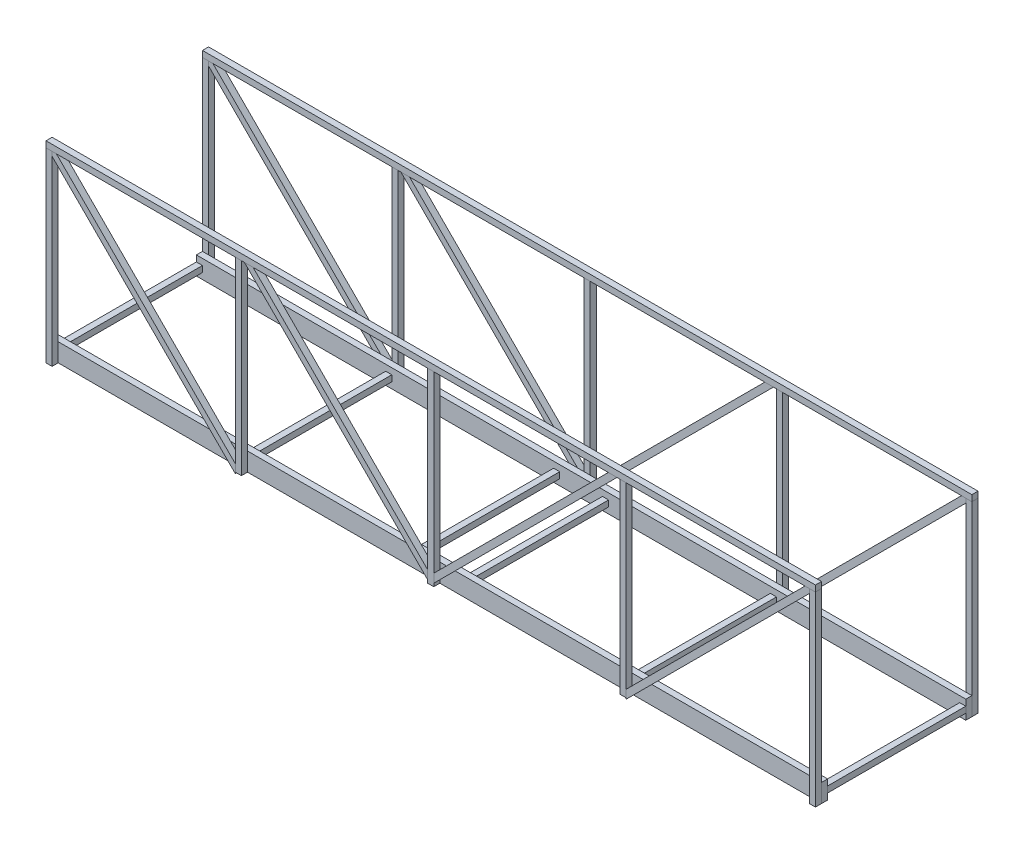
ISO-10303-21;
HEADER;
FILE_DESCRIPTION(('STEP AP214'),'2;1');
FILE_NAME('part.step','',(''),(''),'','','');
FILE_SCHEMA(('AUTOMOTIVE_DESIGN { 1 0 10303 214 1 1 1 1 }'));
ENDSEC;
DATA;
#1=APPLICATION_CONTEXT('core data for automotive mechanical design processes');
#2=APPLICATION_PROTOCOL_DEFINITION('international standard','automotive_design',2000,#1);
#3=PRODUCT_CONTEXT('',#1,'mechanical');
#4=PRODUCT('Part','Part','',(#3));
#5=PRODUCT_RELATED_PRODUCT_CATEGORY('part','',(#4));
#6=PRODUCT_DEFINITION_FORMATION('','',#4);
#7=PRODUCT_DEFINITION_CONTEXT('part definition',#1,'design');
#8=PRODUCT_DEFINITION('design','',#6,#7);
#9=PRODUCT_DEFINITION_SHAPE('','',#8);
#10=(LENGTH_UNIT() NAMED_UNIT(*) SI_UNIT(.MILLI.,.METRE.));
#11=(NAMED_UNIT(*) PLANE_ANGLE_UNIT() SI_UNIT($,.RADIAN.));
#12=(NAMED_UNIT(*) SI_UNIT($,.STERADIAN.) SOLID_ANGLE_UNIT());
#13=UNCERTAINTY_MEASURE_WITH_UNIT(LENGTH_MEASURE(1.E-05),#10,'distance_accuracy_value','');
#14=(GEOMETRIC_REPRESENTATION_CONTEXT(3) GLOBAL_UNCERTAINTY_ASSIGNED_CONTEXT((#13)) GLOBAL_UNIT_ASSIGNED_CONTEXT((#10,
#11,#12)) REPRESENTATION_CONTEXT('',''));
#15=CARTESIAN_POINT('',(0.,0.,0.));
#16=DIRECTION('',(0.,0.,1.));
#17=DIRECTION('',(1.,0.,0.));
#18=AXIS2_PLACEMENT_3D('',#15,#16,#17);
#19=CARTESIAN_POINT('',(198.877467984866,96.3600320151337,-39.0875));
#20=DIRECTION('',(0.,0.,-1.));
#21=DIRECTION('',(-1.,0.,0.));
#22=AXIS2_PLACEMENT_3D('',#19,#20,#21);
#23=PLANE('',#22);
#24=DIRECTION('',(0.,1.,0.));
#25=VECTOR('',#24,1.);
#26=CARTESIAN_POINT('',(101.5875,96.3600320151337,-39.0875));
#27=LINE('',#26,#25);
#28=CARTESIAN_POINT('',(101.5875,-5.42006403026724,-39.0875));
#29=VERTEX_POINT('',#28);
#30=CARTESIAN_POINT('',(101.5875,-0.929935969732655,-39.0875));
#31=VERTEX_POINT('',#30);
#32=EDGE_CURVE('E13',#29,#31,#27,.T.);
#33=ORIENTED_EDGE('',*,*,#32,.F.);
#34=DIRECTION('',(-0.707106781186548,-0.707106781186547,0.));
#35=VECTOR('',#34,1.);
#36=CARTESIAN_POINT('',(201.122532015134,94.1149679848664,-39.0875));
#37=LINE('',#36,#35);
#38=CARTESIAN_POINT('',(196.825,89.8174359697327,-39.0875));
#39=VERTEX_POINT('',#38);
#40=EDGE_CURVE('E576',#39,#29,#37,.T.);
#41=ORIENTED_EDGE('',*,*,#40,.F.);
#42=DIRECTION('',(0.,-1.,0.));
#43=VECTOR('',#42,1.);
#44=CARTESIAN_POINT('',(196.825,95.2375,-39.0875));
#45=LINE('',#44,#43);
#46=CARTESIAN_POINT('',(196.825,92.0624999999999,-39.0875));
#47=VERTEX_POINT('',#46);
#48=EDGE_CURVE('E553',#47,#39,#45,.T.);
#49=ORIENTED_EDGE('',*,*,#48,.F.);
#50=DIRECTION('',(-1.,0.,0.));
#51=VECTOR('',#50,1.);
#52=CARTESIAN_POINT('',(200.,92.0624999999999,-39.0875));
#53=LINE('',#52,#51);
#54=CARTESIAN_POINT('',(194.579935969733,92.0624999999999,-39.0875));
#55=VERTEX_POINT('',#54);
#56=EDGE_CURVE('E557',#47,#55,#53,.T.);
#57=ORIENTED_EDGE('',*,*,#56,.T.);
#58=DIRECTION('',(-0.707106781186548,-0.707106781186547,0.));
#59=VECTOR('',#58,1.);
#60=CARTESIAN_POINT('',(198.877467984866,96.3600320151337,-39.0875));
#61=LINE('',#60,#59);
#62=EDGE_CURVE('E579',#55,#31,#61,.T.);
#63=ORIENTED_EDGE('',*,*,#62,.T.);
#64=EDGE_LOOP('',(#33,#41,#49,#57,#63));
#65=FACE_BOUND('',#64,.T.);
#66=ADVANCED_FACE('F497',(#65),#23,.F.);
#67=CARTESIAN_POINT('',(198.877467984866,96.3600320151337,-39.0875));
#68=DIRECTION('',(0.707106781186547,-0.707106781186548,0.));
#69=DIRECTION('',(0.707106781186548,0.707106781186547,0.));
#70=AXIS2_PLACEMENT_3D('',#67,#68,#69);
#71=PLANE('',#70);
#72=DIRECTION('',(0.,0.,-1.));
#73=VECTOR('',#72,1.);
#74=CARTESIAN_POINT('',(101.5875,-0.929935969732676,-39.0875));
#75=LINE('',#74,#73);
#76=CARTESIAN_POINT('',(101.5875,-0.929935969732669,-42.2625));
#77=VERTEX_POINT('',#76);
#78=EDGE_CURVE('E572',#31,#77,#75,.T.);
#79=ORIENTED_EDGE('',*,*,#78,.F.);
#80=ORIENTED_EDGE('',*,*,#62,.F.);
#81=DIRECTION('',(0.,0.,1.));
#82=VECTOR('',#81,1.);
#83=CARTESIAN_POINT('',(194.579935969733,92.0624999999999,-39.0875));
#84=LINE('',#83,#82);
#85=CARTESIAN_POINT('',(194.579935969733,92.0624999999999,-42.2625));
#86=VERTEX_POINT('',#85);
#87=EDGE_CURVE('E519',#86,#55,#84,.T.);
#88=ORIENTED_EDGE('',*,*,#87,.F.);
#89=DIRECTION('',(-0.707106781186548,-0.707106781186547,0.));
#90=VECTOR('',#89,1.);
#91=CARTESIAN_POINT('',(198.877467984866,96.3600320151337,-42.2625));
#92=LINE('',#91,#90);
#93=EDGE_CURVE('E564',#86,#77,#92,.T.);
#94=ORIENTED_EDGE('',*,*,#93,.T.);
#95=EDGE_LOOP('',(#79,#80,#88,#94));
#96=FACE_BOUND('',#95,.T.);
#97=ADVANCED_FACE('F589',(#96),#71,.F.);
#98=CARTESIAN_POINT('',(198.877467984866,96.3600320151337,-42.2625));
#99=DIRECTION('',(0.,0.,1.));
#100=DIRECTION('',(1.,0.,0.));
#101=AXIS2_PLACEMENT_3D('',#98,#99,#100);
#102=PLANE('',#101);
#103=DIRECTION('',(0.,-1.,0.));
#104=VECTOR('',#103,1.);
#105=CARTESIAN_POINT('',(101.5875,95.2375,-42.2625));
#106=LINE('',#105,#104);
#107=CARTESIAN_POINT('',(101.5875,-5.42006403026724,-42.2625));
#108=VERTEX_POINT('',#107);
#109=EDGE_CURVE('E565',#77,#108,#106,.T.);
#110=ORIENTED_EDGE('',*,*,#109,.F.);
#111=ORIENTED_EDGE('',*,*,#93,.F.);
#112=DIRECTION('',(-1.,0.,0.));
#113=VECTOR('',#112,1.);
#114=CARTESIAN_POINT('',(200.,92.0624999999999,-42.2625));
#115=LINE('',#114,#113);
#116=CARTESIAN_POINT('',(196.825,92.0624999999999,-42.2625));
#117=VERTEX_POINT('',#116);
#118=EDGE_CURVE('E556',#117,#86,#115,.T.);
#119=ORIENTED_EDGE('',*,*,#118,.F.);
#120=DIRECTION('',(0.,-1.,0.));
#121=VECTOR('',#120,1.);
#122=CARTESIAN_POINT('',(196.825,95.2375,-42.2625));
#123=LINE('',#122,#121);
#124=CARTESIAN_POINT('',(196.825,89.8174359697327,-42.2625));
#125=VERTEX_POINT('',#124);
#126=EDGE_CURVE('E543',#117,#125,#123,.T.);
#127=ORIENTED_EDGE('',*,*,#126,.T.);
#128=DIRECTION('',(-0.707106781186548,-0.707106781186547,0.));
#129=VECTOR('',#128,1.);
#130=CARTESIAN_POINT('',(201.122532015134,94.1149679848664,-42.2625));
#131=LINE('',#130,#129);
#132=EDGE_CURVE('E505',#125,#108,#131,.T.);
#133=ORIENTED_EDGE('',*,*,#132,.T.);
#134=EDGE_LOOP('',(#110,#111,#119,#127,#133));
#135=FACE_BOUND('',#134,.T.);
#136=ADVANCED_FACE('F562',(#135),#102,.F.);
#137=CARTESIAN_POINT('',(201.122532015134,94.1149679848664,-39.0875));
#138=DIRECTION('',(-0.707106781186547,0.707106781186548,0.));
#139=DIRECTION('',(-0.707106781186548,-0.707106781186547,0.));
#140=AXIS2_PLACEMENT_3D('',#137,#138,#139);
#141=PLANE('',#140);
#142=DIRECTION('',(0.,0.,-1.));
#143=VECTOR('',#142,1.);
#144=CARTESIAN_POINT('',(196.825,89.8174359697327,-39.0875));
#145=LINE('',#144,#143);
#146=EDGE_CURVE('E548',#39,#125,#145,.T.);
#147=ORIENTED_EDGE('',*,*,#146,.F.);
#148=ORIENTED_EDGE('',*,*,#40,.T.);
#149=DIRECTION('',(0.,0.,1.));
#150=VECTOR('',#149,1.);
#151=CARTESIAN_POINT('',(101.5875,-5.42006403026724,-39.0875));
#152=LINE('',#151,#150);
#153=EDGE_CURVE('E511',#108,#29,#152,.T.);
#154=ORIENTED_EDGE('',*,*,#153,.F.);
#155=ORIENTED_EDGE('',*,*,#132,.F.);
#156=EDGE_LOOP('',(#147,#148,#154,#155));
#157=FACE_BOUND('',#156,.T.);
#158=ADVANCED_FACE('F499',(#157),#141,.F.);
#159=CARTESIAN_POINT('',(200.,92.0624999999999,-39.0875));
#160=DIRECTION('',(0.,1.,0.));
#161=DIRECTION('',(0.,0.,1.));
#162=AXIS2_PLACEMENT_3D('',#159,#160,#161);
#163=PLANE('',#162);
#164=ORIENTED_EDGE('',*,*,#87,.T.);
#165=ORIENTED_EDGE('',*,*,#56,.F.);
#166=DIRECTION('',(0.,0.,1.));
#167=VECTOR('',#166,1.);
#168=CARTESIAN_POINT('',(196.825,92.0624999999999,-39.0875));
#169=LINE('',#168,#167);
#170=EDGE_CURVE('E546',#117,#47,#169,.T.);
#171=ORIENTED_EDGE('',*,*,#170,.F.);
#172=ORIENTED_EDGE('',*,*,#118,.T.);
#173=EDGE_LOOP('',(#164,#165,#171,#172));
#174=FACE_BOUND('',#173,.T.);
#175=ADVANCED_FACE('F555',(#174),#163,.T.);
#176=CARTESIAN_POINT('',(196.825,95.2375,-39.0875));
#177=DIRECTION('',(1.,0.,0.));
#178=DIRECTION('',(0.,0.,-1.));
#179=AXIS2_PLACEMENT_3D('',#176,#177,#178);
#180=PLANE('',#179);
#181=ORIENTED_EDGE('',*,*,#146,.T.);
#182=ORIENTED_EDGE('',*,*,#126,.F.);
#183=ORIENTED_EDGE('',*,*,#170,.T.);
#184=ORIENTED_EDGE('',*,*,#48,.T.);
#185=EDGE_LOOP('',(#181,#182,#183,#184));
#186=FACE_BOUND('',#185,.T.);
#187=ADVANCED_FACE('F545',(#186),#180,.T.);
#188=CARTESIAN_POINT('',(101.5875,95.2375,-39.0875));
#189=DIRECTION('',(-1.,0.,0.));
#190=DIRECTION('',(0.,0.,1.));
#191=AXIS2_PLACEMENT_3D('',#188,#189,#190);
#192=PLANE('',#191);
#193=ORIENTED_EDGE('',*,*,#153,.T.);
#194=ORIENTED_EDGE('',*,*,#32,.T.);
#195=ORIENTED_EDGE('',*,*,#78,.T.);
#196=ORIENTED_EDGE('',*,*,#109,.T.);
#197=EDGE_LOOP('',(#193,#194,#195,#196));
#198=FACE_BOUND('',#197,.T.);
#199=ADVANCED_FACE('F587',(#198),#192,.T.);
#200=CLOSED_SHELL('',(#66,#97,#136,#158,#175,#187,#199));
#201=MANIFOLD_SOLID_BREP('B2',#200);
#202=CARTESIAN_POINT('',(-201.122532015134,94.1149679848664,-39.0875));
#203=DIRECTION('',(0.,0.,-1.));
#204=DIRECTION('',(-1.,0.,0.));
#205=AXIS2_PLACEMENT_3D('',#202,#203,#204);
#206=PLANE('',#205);
#207=DIRECTION('',(0.,-1.,0.));
#208=VECTOR('',#207,1.);
#209=CARTESIAN_POINT('',(-101.5875,94.1149679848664,-39.0875));
#210=LINE('',#209,#208);
#211=CARTESIAN_POINT('',(-101.5875,-0.929935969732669,-39.0875));
#212=VERTEX_POINT('',#211);
#213=CARTESIAN_POINT('',(-101.5875,-5.42006403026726,-39.0875));
#214=VERTEX_POINT('',#213);
#215=EDGE_CURVE('E680',#212,#214,#210,.T.);
#216=ORIENTED_EDGE('',*,*,#215,.F.);
#217=DIRECTION('',(0.707106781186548,-0.707106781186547,0.));
#218=VECTOR('',#217,1.);
#219=CARTESIAN_POINT('',(-198.877467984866,96.3600320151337,-39.0875));
#220=LINE('',#219,#218);
#221=CARTESIAN_POINT('',(-194.579935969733,92.0624999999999,-39.0875));
#222=VERTEX_POINT('',#221);
#223=EDGE_CURVE('E742',#222,#212,#220,.T.);
#224=ORIENTED_EDGE('',*,*,#223,.F.);
#225=DIRECTION('',(1.,0.,0.));
#226=VECTOR('',#225,1.);
#227=CARTESIAN_POINT('',(-201.122532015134,92.0624999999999,-39.0875));
#228=LINE('',#227,#226);
#229=CARTESIAN_POINT('',(-196.825,92.0624999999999,-39.0875));
#230=VERTEX_POINT('',#229);
#231=EDGE_CURVE('E729',#230,#222,#228,.T.);
#232=ORIENTED_EDGE('',*,*,#231,.F.);
#233=DIRECTION('',(0.,-1.,0.));
#234=VECTOR('',#233,1.);
#235=CARTESIAN_POINT('',(-196.825,95.2374999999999,-39.0875));
#236=LINE('',#235,#234);
#237=CARTESIAN_POINT('',(-196.825,89.8174359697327,-39.0875));
#238=VERTEX_POINT('',#237);
#239=EDGE_CURVE('E728',#230,#238,#236,.T.);
#240=ORIENTED_EDGE('',*,*,#239,.T.);
#241=DIRECTION('',(0.707106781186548,-0.707106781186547,0.));
#242=VECTOR('',#241,1.);
#243=CARTESIAN_POINT('',(-201.122532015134,94.1149679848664,-39.0875));
#244=LINE('',#243,#242);
#245=EDGE_CURVE('E674',#238,#214,#244,.T.);
#246=ORIENTED_EDGE('',*,*,#245,.T.);
#247=EDGE_LOOP('',(#216,#224,#232,#240,#246));
#248=FACE_BOUND('',#247,.T.);
#249=ADVANCED_FACE('F670',(#248),#206,.F.);
#250=CARTESIAN_POINT('',(-201.122532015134,94.1149679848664,-39.0875));
#251=DIRECTION('',(0.707106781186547,0.707106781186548,0.));
#252=DIRECTION('',(-0.707106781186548,0.707106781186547,0.));
#253=AXIS2_PLACEMENT_3D('',#250,#251,#252);
#254=PLANE('',#253);
#255=DIRECTION('',(0.,0.,-1.));
#256=VECTOR('',#255,1.);
#257=CARTESIAN_POINT('',(-101.5875,-5.42006403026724,-39.0875));
#258=LINE('',#257,#256);
#259=CARTESIAN_POINT('',(-101.5875,-5.42006403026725,-42.2625));
#260=VERTEX_POINT('',#259);
#261=EDGE_CURVE('E495',#214,#260,#258,.T.);
#262=ORIENTED_EDGE('',*,*,#261,.F.);
#263=ORIENTED_EDGE('',*,*,#245,.F.);
#264=DIRECTION('',(0.,0.,1.));
#265=VECTOR('',#264,1.);
#266=CARTESIAN_POINT('',(-196.825,89.8174359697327,-39.0875));
#267=LINE('',#266,#265);
#268=CARTESIAN_POINT('',(-196.825,89.8174359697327,-42.2625));
#269=VERTEX_POINT('',#268);
#270=EDGE_CURVE('E736',#269,#238,#267,.T.);
#271=ORIENTED_EDGE('',*,*,#270,.F.);
#272=DIRECTION('',(0.707106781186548,-0.707106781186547,0.));
#273=VECTOR('',#272,1.);
#274=CARTESIAN_POINT('',(-201.122532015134,94.1149679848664,-42.2625));
#275=LINE('',#274,#273);
#276=EDGE_CURVE('E734',#269,#260,#275,.T.);
#277=ORIENTED_EDGE('',*,*,#276,.T.);
#278=EDGE_LOOP('',(#262,#263,#271,#277));
#279=FACE_BOUND('',#278,.T.);
#280=ADVANCED_FACE('F754',(#279),#254,.F.);
#281=CARTESIAN_POINT('',(-201.122532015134,94.1149679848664,-42.2625));
#282=DIRECTION('',(0.,0.,1.));
#283=DIRECTION('',(1.,0.,0.));
#284=AXIS2_PLACEMENT_3D('',#281,#282,#283);
#285=PLANE('',#284);
#286=DIRECTION('',(0.,-1.,0.));
#287=VECTOR('',#286,1.);
#288=CARTESIAN_POINT('',(-101.5875,95.2375,-42.2625));
#289=LINE('',#288,#287);
#290=CARTESIAN_POINT('',(-101.5875,-0.929935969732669,-42.2625));
#291=VERTEX_POINT('',#290);
#292=EDGE_CURVE('E688',#291,#260,#289,.T.);
#293=ORIENTED_EDGE('',*,*,#292,.T.);
#294=ORIENTED_EDGE('',*,*,#276,.F.);
#295=DIRECTION('',(0.,-1.,0.));
#296=VECTOR('',#295,1.);
#297=CARTESIAN_POINT('',(-196.825,95.2374999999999,-42.2625));
#298=LINE('',#297,#296);
#299=CARTESIAN_POINT('',(-196.825,92.0624999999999,-42.2625));
#300=VERTEX_POINT('',#299);
#301=EDGE_CURVE('E725',#300,#269,#298,.T.);
#302=ORIENTED_EDGE('',*,*,#301,.F.);
#303=DIRECTION('',(-1.,0.,0.));
#304=VECTOR('',#303,1.);
#305=CARTESIAN_POINT('',(200.,92.0624999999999,-42.2625));
#306=LINE('',#305,#304);
#307=CARTESIAN_POINT('',(-194.579935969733,92.0624999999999,-42.2625));
#308=VERTEX_POINT('',#307);
#309=EDGE_CURVE('E712',#308,#300,#306,.T.);
#310=ORIENTED_EDGE('',*,*,#309,.F.);
#311=DIRECTION('',(0.707106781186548,-0.707106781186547,0.));
#312=VECTOR('',#311,1.);
#313=CARTESIAN_POINT('',(-198.877467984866,96.3600320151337,-42.2625));
#314=LINE('',#313,#312);
#315=EDGE_CURVE('E745',#308,#291,#314,.T.);
#316=ORIENTED_EDGE('',*,*,#315,.T.);
#317=EDGE_LOOP('',(#293,#294,#302,#310,#316));
#318=FACE_BOUND('',#317,.T.);
#319=ADVANCED_FACE('F732',(#318),#285,.F.);
#320=CARTESIAN_POINT('',(-198.877467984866,96.3600320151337,-39.0875));
#321=DIRECTION('',(-0.707106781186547,-0.707106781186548,0.));
#322=DIRECTION('',(0.707106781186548,-0.707106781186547,0.));
#323=AXIS2_PLACEMENT_3D('',#320,#321,#322);
#324=PLANE('',#323);
#325=DIRECTION('',(0.,0.,1.));
#326=VECTOR('',#325,1.);
#327=CARTESIAN_POINT('',(-101.5875,-0.929935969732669,-39.0875));
#328=LINE('',#327,#326);
#329=EDGE_CURVE('E735',#291,#212,#328,.T.);
#330=ORIENTED_EDGE('',*,*,#329,.F.);
#331=ORIENTED_EDGE('',*,*,#315,.F.);
#332=DIRECTION('',(0.,0.,-1.));
#333=VECTOR('',#332,1.);
#334=CARTESIAN_POINT('',(-194.579935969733,92.0624999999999,-39.0875));
#335=LINE('',#334,#333);
#336=EDGE_CURVE('E709',#222,#308,#335,.T.);
#337=ORIENTED_EDGE('',*,*,#336,.F.);
#338=ORIENTED_EDGE('',*,*,#223,.T.);
#339=EDGE_LOOP('',(#330,#331,#337,#338));
#340=FACE_BOUND('',#339,.T.);
#341=ADVANCED_FACE('F672',(#340),#324,.F.);
#342=CARTESIAN_POINT('',(200.,92.0624999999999,-39.0875));
#343=DIRECTION('',(0.,1.,0.));
#344=DIRECTION('',(0.,0.,1.));
#345=AXIS2_PLACEMENT_3D('',#342,#343,#344);
#346=PLANE('',#345);
#347=ORIENTED_EDGE('',*,*,#336,.T.);
#348=ORIENTED_EDGE('',*,*,#309,.T.);
#349=DIRECTION('',(0.,0.,1.));
#350=VECTOR('',#349,1.);
#351=CARTESIAN_POINT('',(-196.825,92.0624999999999,-39.0875));
#352=LINE('',#351,#350);
#353=EDGE_CURVE('E715',#300,#230,#352,.T.);
#354=ORIENTED_EDGE('',*,*,#353,.T.);
#355=ORIENTED_EDGE('',*,*,#231,.T.);
#356=EDGE_LOOP('',(#347,#348,#354,#355));
#357=FACE_BOUND('',#356,.T.);
#358=ADVANCED_FACE('F714',(#357),#346,.T.);
#359=CARTESIAN_POINT('',(-196.825,95.2374999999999,-39.0875));
#360=DIRECTION('',(-1.,0.,0.));
#361=DIRECTION('',(0.,-1.,0.));
#362=AXIS2_PLACEMENT_3D('',#359,#360,#361);
#363=PLANE('',#362);
#364=ORIENTED_EDGE('',*,*,#270,.T.);
#365=ORIENTED_EDGE('',*,*,#239,.F.);
#366=ORIENTED_EDGE('',*,*,#353,.F.);
#367=ORIENTED_EDGE('',*,*,#301,.T.);
#368=EDGE_LOOP('',(#364,#365,#366,#367));
#369=FACE_BOUND('',#368,.T.);
#370=ADVANCED_FACE('F724',(#369),#363,.T.);
#371=CARTESIAN_POINT('',(-101.5875,95.2375,-39.0875));
#372=DIRECTION('',(1.,0.,0.));
#373=DIRECTION('',(0.,0.,-1.));
#374=AXIS2_PLACEMENT_3D('',#371,#372,#373);
#375=PLANE('',#374);
#376=ORIENTED_EDGE('',*,*,#329,.T.);
#377=ORIENTED_EDGE('',*,*,#215,.T.);
#378=ORIENTED_EDGE('',*,*,#261,.T.);
#379=ORIENTED_EDGE('',*,*,#292,.F.);
#380=EDGE_LOOP('',(#376,#377,#378,#379));
#381=FACE_BOUND('',#380,.T.);
#382=ADVANCED_FACE('F756',(#381),#375,.T.);
#383=CLOSED_SHELL('',(#249,#280,#319,#341,#358,#370,#382));
#384=MANIFOLD_SOLID_BREP('B7',#383);
#385=CARTESIAN_POINT('',(-101.122532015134,-5.88503201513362,39.0875));
#386=DIRECTION('',(0.,0.,1.));
#387=DIRECTION('',(1.,0.,0.));
#388=AXIS2_PLACEMENT_3D('',#385,#386,#387);
#389=PLANE('',#388);
#390=DIRECTION('',(0.,1.,0.));
#391=VECTOR('',#390,1.);
#392=CARTESIAN_POINT('',(-101.5875,-5.88503201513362,39.0875));
#393=LINE('',#392,#391);
#394=CARTESIAN_POINT('',(-101.5875,-5.42006403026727,39.0875));
#395=VERTEX_POINT('',#394);
#396=CARTESIAN_POINT('',(-101.5875,-0.929935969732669,39.0875));
#397=VERTEX_POINT('',#396);
#398=EDGE_CURVE('E668',#395,#397,#393,.T.);
#399=ORIENTED_EDGE('',*,*,#398,.F.);
#400=DIRECTION('',(-0.707106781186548,0.707106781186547,0.));
#401=VECTOR('',#400,1.);
#402=CARTESIAN_POINT('',(-101.122532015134,-5.88503201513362,39.0875));
#403=LINE('',#402,#401);
#404=CARTESIAN_POINT('',(-196.825,89.8174359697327,39.0875));
#405=VERTEX_POINT('',#404);
#406=EDGE_CURVE('E847',#395,#405,#403,.T.);
#407=ORIENTED_EDGE('',*,*,#406,.T.);
#408=DIRECTION('',(0.,-1.,0.));
#409=VECTOR('',#408,1.);
#410=CARTESIAN_POINT('',(-196.825,95.2375,39.0875));
#411=LINE('',#410,#409);
#412=CARTESIAN_POINT('',(-196.825,92.0625,39.0875));
#413=VERTEX_POINT('',#412);
#414=EDGE_CURVE('E907',#413,#405,#411,.T.);
#415=ORIENTED_EDGE('',*,*,#414,.F.);
#416=DIRECTION('',(-1.,0.,0.));
#417=VECTOR('',#416,1.);
#418=CARTESIAN_POINT('',(200.,92.0625,39.0875));
#419=LINE('',#418,#417);
#420=CARTESIAN_POINT('',(-194.579935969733,92.0625,39.0875));
#421=VERTEX_POINT('',#420);
#422=EDGE_CURVE('E906',#421,#413,#419,.T.);
#423=ORIENTED_EDGE('',*,*,#422,.F.);
#424=DIRECTION('',(-0.707106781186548,0.707106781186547,0.));
#425=VECTOR('',#424,1.);
#426=CARTESIAN_POINT('',(-98.8774679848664,-3.63996798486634,39.0875));
#427=LINE('',#426,#425);
#428=EDGE_CURVE('E905',#397,#421,#427,.T.);
#429=ORIENTED_EDGE('',*,*,#428,.F.);
#430=EDGE_LOOP('',(#399,#407,#415,#423,#429));
#431=FACE_BOUND('',#430,.T.);
#432=ADVANCED_FACE('F843',(#431),#389,.F.);
#433=CARTESIAN_POINT('',(-101.122532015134,-5.88503201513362,39.0875));
#434=DIRECTION('',(0.707106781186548,0.707106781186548,0.));
#435=DIRECTION('',(-0.707106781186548,0.707106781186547,0.));
#436=AXIS2_PLACEMENT_3D('',#433,#434,#435);
#437=PLANE('',#436);
#438=DIRECTION('',(0.,0.,-1.));
#439=VECTOR('',#438,1.);
#440=CARTESIAN_POINT('',(-101.5875,-5.42006403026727,39.0875));
#441=LINE('',#440,#439);
#442=CARTESIAN_POINT('',(-101.5875,-5.42006403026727,42.2625));
#443=VERTEX_POINT('',#442);
#444=EDGE_CURVE('E853',#443,#395,#441,.T.);
#445=ORIENTED_EDGE('',*,*,#444,.F.);
#446=DIRECTION('',(-0.707106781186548,0.707106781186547,0.));
#447=VECTOR('',#446,1.);
#448=CARTESIAN_POINT('',(-101.122532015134,-5.88503201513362,42.2625));
#449=LINE('',#448,#447);
#450=CARTESIAN_POINT('',(-196.825,89.8174359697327,42.2625));
#451=VERTEX_POINT('',#450);
#452=EDGE_CURVE('E920',#443,#451,#449,.T.);
#453=ORIENTED_EDGE('',*,*,#452,.T.);
#454=DIRECTION('',(0.,0.,1.));
#455=VECTOR('',#454,1.);
#456=CARTESIAN_POINT('',(-196.825,89.8174359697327,39.0875));
#457=LINE('',#456,#455);
#458=EDGE_CURVE('E911',#405,#451,#457,.T.);
#459=ORIENTED_EDGE('',*,*,#458,.F.);
#460=ORIENTED_EDGE('',*,*,#406,.F.);
#461=EDGE_LOOP('',(#445,#453,#459,#460));
#462=FACE_BOUND('',#461,.T.);
#463=ADVANCED_FACE('F932',(#462),#437,.F.);
#464=CARTESIAN_POINT('',(-101.122532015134,-5.88503201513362,42.2625));
#465=DIRECTION('',(0.,0.,-1.));
#466=DIRECTION('',(-1.,0.,0.));
#467=AXIS2_PLACEMENT_3D('',#464,#465,#466);
#468=PLANE('',#467);
#469=DIRECTION('',(0.,1.,0.));
#470=VECTOR('',#469,1.);
#471=CARTESIAN_POINT('',(-101.5875,-4.76249999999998,42.2625));
#472=LINE('',#471,#470);
#473=CARTESIAN_POINT('',(-101.5875,-0.929935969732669,42.2625));
#474=VERTEX_POINT('',#473);
#475=EDGE_CURVE('E891',#443,#474,#472,.T.);
#476=ORIENTED_EDGE('',*,*,#475,.T.);
#477=DIRECTION('',(-0.707106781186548,0.707106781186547,0.));
#478=VECTOR('',#477,1.);
#479=CARTESIAN_POINT('',(-98.8774679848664,-3.63996798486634,42.2625));
#480=LINE('',#479,#478);
#481=CARTESIAN_POINT('',(-194.579935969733,92.0625,42.2625));
#482=VERTEX_POINT('',#481);
#483=EDGE_CURVE('E885',#474,#482,#480,.T.);
#484=ORIENTED_EDGE('',*,*,#483,.T.);
#485=DIRECTION('',(-1.,0.,0.));
#486=VECTOR('',#485,1.);
#487=CARTESIAN_POINT('',(200.,92.0625,42.2625));
#488=LINE('',#487,#486);
#489=CARTESIAN_POINT('',(-196.825,92.0625,42.2625));
#490=VERTEX_POINT('',#489);
#491=EDGE_CURVE('E888',#482,#490,#488,.T.);
#492=ORIENTED_EDGE('',*,*,#491,.T.);
#493=DIRECTION('',(0.,-1.,0.));
#494=VECTOR('',#493,1.);
#495=CARTESIAN_POINT('',(-196.825,95.2375,42.2625));
#496=LINE('',#495,#494);
#497=EDGE_CURVE('E901',#490,#451,#496,.T.);
#498=ORIENTED_EDGE('',*,*,#497,.T.);
#499=ORIENTED_EDGE('',*,*,#452,.F.);
#500=EDGE_LOOP('',(#476,#484,#492,#498,#499));
#501=FACE_BOUND('',#500,.T.);
#502=ADVANCED_FACE('F886',(#501),#468,.F.);
#503=CARTESIAN_POINT('',(-98.8774679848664,-3.63996798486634,39.0875));
#504=DIRECTION('',(-0.707106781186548,-0.707106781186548,0.));
#505=DIRECTION('',(0.707106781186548,-0.707106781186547,0.));
#506=AXIS2_PLACEMENT_3D('',#503,#504,#505);
#507=PLANE('',#506);
#508=DIRECTION('',(0.,0.,1.));
#509=VECTOR('',#508,1.);
#510=CARTESIAN_POINT('',(-101.5875,-0.929935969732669,39.0875));
#511=LINE('',#510,#509);
#512=EDGE_CURVE('E918',#397,#474,#511,.T.);
#513=ORIENTED_EDGE('',*,*,#512,.F.);
#514=ORIENTED_EDGE('',*,*,#428,.T.);
#515=DIRECTION('',(0.,0.,-1.));
#516=VECTOR('',#515,1.);
#517=CARTESIAN_POINT('',(-194.579935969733,92.0625,39.0875));
#518=LINE('',#517,#516);
#519=EDGE_CURVE('E899',#482,#421,#518,.T.);
#520=ORIENTED_EDGE('',*,*,#519,.F.);
#521=ORIENTED_EDGE('',*,*,#483,.F.);
#522=EDGE_LOOP('',(#513,#514,#520,#521));
#523=FACE_BOUND('',#522,.T.);
#524=ADVANCED_FACE('F903',(#523),#507,.F.);
#525=CARTESIAN_POINT('',(-196.825,95.2375,39.0875));
#526=DIRECTION('',(-1.,0.,0.));
#527=DIRECTION('',(0.,0.,1.));
#528=AXIS2_PLACEMENT_3D('',#525,#526,#527);
#529=PLANE('',#528);
#530=ORIENTED_EDGE('',*,*,#458,.T.);
#531=ORIENTED_EDGE('',*,*,#497,.F.);
#532=DIRECTION('',(0.,0.,1.));
#533=VECTOR('',#532,1.);
#534=CARTESIAN_POINT('',(-196.825,92.0625,39.0875));
#535=LINE('',#534,#533);
#536=EDGE_CURVE('E862',#413,#490,#535,.T.);
#537=ORIENTED_EDGE('',*,*,#536,.F.);
#538=ORIENTED_EDGE('',*,*,#414,.T.);
#539=EDGE_LOOP('',(#530,#531,#537,#538));
#540=FACE_BOUND('',#539,.T.);
#541=ADVANCED_FACE('F931',(#540),#529,.T.);
#542=CARTESIAN_POINT('',(200.,92.0625,39.0875));
#543=DIRECTION('',(0.,1.,0.));
#544=DIRECTION('',(0.,0.,1.));
#545=AXIS2_PLACEMENT_3D('',#542,#543,#544);
#546=PLANE('',#545);
#547=ORIENTED_EDGE('',*,*,#519,.T.);
#548=ORIENTED_EDGE('',*,*,#422,.T.);
#549=ORIENTED_EDGE('',*,*,#536,.T.);
#550=ORIENTED_EDGE('',*,*,#491,.F.);
#551=EDGE_LOOP('',(#547,#548,#549,#550));
#552=FACE_BOUND('',#551,.T.);
#553=ADVANCED_FACE('F898',(#552),#546,.T.);
#554=CARTESIAN_POINT('',(-101.5875,-4.76249999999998,39.0875));
#555=DIRECTION('',(1.,0.,0.));
#556=DIRECTION('',(0.,1.,0.));
#557=AXIS2_PLACEMENT_3D('',#554,#555,#556);
#558=PLANE('',#557);
#559=ORIENTED_EDGE('',*,*,#512,.T.);
#560=ORIENTED_EDGE('',*,*,#475,.F.);
#561=ORIENTED_EDGE('',*,*,#444,.T.);
#562=ORIENTED_EDGE('',*,*,#398,.T.);
#563=EDGE_LOOP('',(#559,#560,#561,#562));
#564=FACE_BOUND('',#563,.T.);
#565=ADVANCED_FACE('F845',(#564),#558,.T.);
#566=CLOSED_SHELL('',(#432,#463,#502,#524,#541,#553,#565));
#567=MANIFOLD_SOLID_BREP('B489',#566);
#568=CARTESIAN_POINT('',(201.122532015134,94.1149679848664,39.0875));
#569=DIRECTION('',(0.,0.,1.));
#570=DIRECTION('',(1.,0.,0.));
#571=AXIS2_PLACEMENT_3D('',#568,#569,#570);
#572=PLANE('',#571);
#573=DIRECTION('',(0.,-1.,0.));
#574=VECTOR('',#573,1.);
#575=CARTESIAN_POINT('',(101.5875,94.1149679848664,39.0875));
#576=LINE('',#575,#574);
#577=CARTESIAN_POINT('',(101.5875,-0.929935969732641,39.0875));
#578=VERTEX_POINT('',#577);
#579=CARTESIAN_POINT('',(101.5875,-5.42006403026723,39.0875));
#580=VERTEX_POINT('',#579);
#581=EDGE_CURVE('E841',#578,#580,#576,.T.);
#582=ORIENTED_EDGE('',*,*,#581,.F.);
#583=DIRECTION('',(-0.707106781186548,-0.707106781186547,0.));
#584=VECTOR('',#583,1.);
#585=CARTESIAN_POINT('',(198.877467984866,96.3600320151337,39.0875));
#586=LINE('',#585,#584);
#587=CARTESIAN_POINT('',(194.579935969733,92.0625,39.0875));
#588=VERTEX_POINT('',#587);
#589=EDGE_CURVE('E1095',#588,#578,#586,.T.);
#590=ORIENTED_EDGE('',*,*,#589,.F.);
#591=DIRECTION('',(-1.,0.,0.));
#592=VECTOR('',#591,1.);
#593=CARTESIAN_POINT('',(200.,92.0625,39.0875));
#594=LINE('',#593,#592);
#595=CARTESIAN_POINT('',(196.825,92.0625,39.0875));
#596=VERTEX_POINT('',#595);
#597=EDGE_CURVE('E1078',#596,#588,#594,.T.);
#598=ORIENTED_EDGE('',*,*,#597,.F.);
#599=DIRECTION('',(0.,-1.,0.));
#600=VECTOR('',#599,1.);
#601=CARTESIAN_POINT('',(196.825,95.2375,39.0875));
#602=LINE('',#601,#600);
#603=CARTESIAN_POINT('',(196.825,89.8174359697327,39.0875));
#604=VERTEX_POINT('',#603);
#605=EDGE_CURVE('E1065',#596,#604,#602,.T.);
#606=ORIENTED_EDGE('',*,*,#605,.T.);
#607=DIRECTION('',(-0.707106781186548,-0.707106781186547,0.));
#608=VECTOR('',#607,1.);
#609=CARTESIAN_POINT('',(201.122532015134,94.1149679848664,39.0875));
#610=LINE('',#609,#608);
#611=EDGE_CURVE('E1098',#604,#580,#610,.T.);
#612=ORIENTED_EDGE('',*,*,#611,.T.);
#613=EDGE_LOOP('',(#582,#590,#598,#606,#612));
#614=FACE_BOUND('',#613,.T.);
#615=ADVANCED_FACE('F1016',(#614),#572,.F.);
#616=CARTESIAN_POINT('',(201.122532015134,94.1149679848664,39.0875));
#617=DIRECTION('',(-0.707106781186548,0.707106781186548,0.));
#618=DIRECTION('',(-0.707106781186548,-0.707106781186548,0.));
#619=AXIS2_PLACEMENT_3D('',#616,#617,#618);
#620=PLANE('',#619);
#621=DIRECTION('',(0.,0.,1.));
#622=VECTOR('',#621,1.);
#623=CARTESIAN_POINT('',(101.5875,-5.42006403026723,39.0875));
#624=LINE('',#623,#622);
#625=CARTESIAN_POINT('',(101.5875,-5.42006403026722,42.2625));
#626=VERTEX_POINT('',#625);
#627=EDGE_CURVE('E1092',#580,#626,#624,.T.);
#628=ORIENTED_EDGE('',*,*,#627,.F.);
#629=ORIENTED_EDGE('',*,*,#611,.F.);
#630=DIRECTION('',(0.,0.,-1.));
#631=VECTOR('',#630,1.);
#632=CARTESIAN_POINT('',(196.825,89.8174359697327,39.0875));
#633=LINE('',#632,#631);
#634=CARTESIAN_POINT('',(196.825,89.8174359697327,42.2625));
#635=VERTEX_POINT('',#634);
#636=EDGE_CURVE('E1038',#635,#604,#633,.T.);
#637=ORIENTED_EDGE('',*,*,#636,.F.);
#638=DIRECTION('',(-0.707106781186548,-0.707106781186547,0.));
#639=VECTOR('',#638,1.);
#640=CARTESIAN_POINT('',(201.122532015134,94.1149679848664,42.2625));
#641=LINE('',#640,#639);
#642=EDGE_CURVE('E1084',#635,#626,#641,.T.);
#643=ORIENTED_EDGE('',*,*,#642,.T.);
#644=EDGE_LOOP('',(#628,#629,#637,#643));
#645=FACE_BOUND('',#644,.T.);
#646=ADVANCED_FACE('F1108',(#645),#620,.F.);
#647=CARTESIAN_POINT('',(201.122532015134,94.1149679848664,42.2625));
#648=DIRECTION('',(0.,0.,-1.));
#649=DIRECTION('',(-1.,0.,0.));
#650=AXIS2_PLACEMENT_3D('',#647,#648,#649);
#651=PLANE('',#650);
#652=DIRECTION('',(0.,1.,0.));
#653=VECTOR('',#652,1.);
#654=CARTESIAN_POINT('',(101.5875,-4.76249999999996,42.2625));
#655=LINE('',#654,#653);
#656=CARTESIAN_POINT('',(101.5875,-0.929935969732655,42.2625));
#657=VERTEX_POINT('',#656);
#658=EDGE_CURVE('E1068',#626,#657,#655,.T.);
#659=ORIENTED_EDGE('',*,*,#658,.F.);
#660=ORIENTED_EDGE('',*,*,#642,.F.);
#661=DIRECTION('',(0.,-1.,0.));
#662=VECTOR('',#661,1.);
#663=CARTESIAN_POINT('',(196.825,95.2375,42.2625));
#664=LINE('',#663,#662);
#665=CARTESIAN_POINT('',(196.824999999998,92.0625,42.2625));
#666=VERTEX_POINT('',#665);
#667=EDGE_CURVE('E1064',#666,#635,#664,.T.);
#668=ORIENTED_EDGE('',*,*,#667,.F.);
#669=DIRECTION('',(-1.,0.,0.));
#670=VECTOR('',#669,1.);
#671=CARTESIAN_POINT('',(200.,92.0625,42.2625));
#672=LINE('',#671,#670);
#673=CARTESIAN_POINT('',(194.579935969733,92.0625,42.2625));
#674=VERTEX_POINT('',#673);
#675=EDGE_CURVE('E1069',#666,#674,#672,.T.);
#676=ORIENTED_EDGE('',*,*,#675,.T.);
#677=DIRECTION('',(-0.707106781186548,-0.707106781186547,0.));
#678=VECTOR('',#677,1.);
#679=CARTESIAN_POINT('',(198.877467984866,96.3600320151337,42.2625));
#680=LINE('',#679,#678);
#681=EDGE_CURVE('E1024',#674,#657,#680,.T.);
#682=ORIENTED_EDGE('',*,*,#681,.T.);
#683=EDGE_LOOP('',(#659,#660,#668,#676,#682));
#684=FACE_BOUND('',#683,.T.);
#685=ADVANCED_FACE('F1082',(#684),#651,.F.);
#686=CARTESIAN_POINT('',(198.877467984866,96.3600320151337,39.0875));
#687=DIRECTION('',(0.707106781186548,-0.707106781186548,0.));
#688=DIRECTION('',(0.707106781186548,0.707106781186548,0.));
#689=AXIS2_PLACEMENT_3D('',#686,#687,#688);
#690=PLANE('',#689);
#691=DIRECTION('',(0.,0.,-1.));
#692=VECTOR('',#691,1.);
#693=CARTESIAN_POINT('',(101.5875,-0.929935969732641,39.0875));
#694=LINE('',#693,#692);
#695=EDGE_CURVE('E1030',#657,#578,#694,.T.);
#696=ORIENTED_EDGE('',*,*,#695,.F.);
#697=ORIENTED_EDGE('',*,*,#681,.F.);
#698=DIRECTION('',(0.,0.,1.));
#699=VECTOR('',#698,1.);
#700=CARTESIAN_POINT('',(194.579935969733,92.0625,39.0875));
#701=LINE('',#700,#699);
#702=EDGE_CURVE('E1074',#588,#674,#701,.T.);
#703=ORIENTED_EDGE('',*,*,#702,.F.);
#704=ORIENTED_EDGE('',*,*,#589,.T.);
#705=EDGE_LOOP('',(#696,#697,#703,#704));
#706=FACE_BOUND('',#705,.T.);
#707=ADVANCED_FACE('F1018',(#706),#690,.F.);
#708=CARTESIAN_POINT('',(196.825,95.2375,39.0875));
#709=DIRECTION('',(1.,0.,0.));
#710=DIRECTION('',(0.,1.,0.));
#711=AXIS2_PLACEMENT_3D('',#708,#709,#710);
#712=PLANE('',#711);
#713=ORIENTED_EDGE('',*,*,#636,.T.);
#714=ORIENTED_EDGE('',*,*,#605,.F.);
#715=DIRECTION('',(0.,0.,-1.));
#716=VECTOR('',#715,1.);
#717=CARTESIAN_POINT('',(196.825,92.0625,39.0875));
#718=LINE('',#717,#716);
#719=EDGE_CURVE('E1060',#666,#596,#718,.T.);
#720=ORIENTED_EDGE('',*,*,#719,.F.);
#721=ORIENTED_EDGE('',*,*,#667,.T.);
#722=EDGE_LOOP('',(#713,#714,#720,#721));
#723=FACE_BOUND('',#722,.T.);
#724=ADVANCED_FACE('F1062',(#723),#712,.T.);
#725=CARTESIAN_POINT('',(200.,92.0625,39.0875));
#726=DIRECTION('',(0.,1.,0.));
#727=DIRECTION('',(0.,0.,1.));
#728=AXIS2_PLACEMENT_3D('',#725,#726,#727);
#729=PLANE('',#728);
#730=ORIENTED_EDGE('',*,*,#702,.T.);
#731=ORIENTED_EDGE('',*,*,#675,.F.);
#732=ORIENTED_EDGE('',*,*,#719,.T.);
#733=ORIENTED_EDGE('',*,*,#597,.T.);
#734=EDGE_LOOP('',(#730,#731,#732,#733));
#735=FACE_BOUND('',#734,.T.);
#736=ADVANCED_FACE('F1072',(#735),#729,.T.);
#737=CARTESIAN_POINT('',(101.5875,-4.76249999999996,39.0875));
#738=DIRECTION('',(-1.,0.,0.));
#739=DIRECTION('',(0.,-1.,0.));
#740=AXIS2_PLACEMENT_3D('',#737,#738,#739);
#741=PLANE('',#740);
#742=ORIENTED_EDGE('',*,*,#695,.T.);
#743=ORIENTED_EDGE('',*,*,#581,.T.);
#744=ORIENTED_EDGE('',*,*,#627,.T.);
#745=ORIENTED_EDGE('',*,*,#658,.T.);
#746=EDGE_LOOP('',(#742,#743,#744,#745));
#747=FACE_BOUND('',#746,.T.);
#748=ADVANCED_FACE('F1106',(#747),#741,.T.);
#749=CLOSED_SHELL('',(#615,#646,#685,#707,#724,#736,#748));
#750=MANIFOLD_SOLID_BREP('B662',#749);
#751=CARTESIAN_POINT('',(2.24506403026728,-2.51743596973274,-39.0875));
#752=DIRECTION('',(0.,0.,-1.));
#753=DIRECTION('',(-1.,0.,0.));
#754=AXIS2_PLACEMENT_3D('',#751,#752,#753);
#755=PLANE('',#754);
#756=DIRECTION('',(1.,0.,0.));
#757=VECTOR('',#756,1.);
#758=CARTESIAN_POINT('',(2.24506403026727,92.0624999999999,-39.0875));
#759=LINE('',#758,#757);
#760=CARTESIAN_POINT('',(-96.825,92.0624999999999,-39.0875));
#761=VERTEX_POINT('',#760);
#762=CARTESIAN_POINT('',(-92.3348719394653,92.0624999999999,-39.0875));
#763=VERTEX_POINT('',#762);
#764=EDGE_CURVE('E1234',#761,#763,#759,.T.);
#765=ORIENTED_EDGE('',*,*,#764,.F.);
#766=DIRECTION('',(-0.707106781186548,0.707106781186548,0.));
#767=VECTOR('',#766,1.);
#768=CARTESIAN_POINT('',(0.,-4.76250000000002,-39.0875));
#769=LINE('',#768,#767);
#770=CARTESIAN_POINT('',(-1.58750000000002,-3.175,-39.0875));
#771=VERTEX_POINT('',#770);
#772=EDGE_CURVE('E1244',#771,#761,#769,.T.);
#773=ORIENTED_EDGE('',*,*,#772,.F.);
#774=DIRECTION('',(0.,-1.,0.));
#775=VECTOR('',#774,1.);
#776=CARTESIAN_POINT('',(-1.58750000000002,-2.51743596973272,-39.0875));
#777=LINE('',#776,#775);
#778=CARTESIAN_POINT('',(-1.58750000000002,1.31512806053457,-39.0875));
#779=VERTEX_POINT('',#778);
#780=EDGE_CURVE('E1229',#779,#771,#777,.T.);
#781=ORIENTED_EDGE('',*,*,#780,.F.);
#782=DIRECTION('',(-0.707106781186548,0.707106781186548,0.));
#783=VECTOR('',#782,1.);
#784=CARTESIAN_POINT('',(2.24506403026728,-2.51743596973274,-39.0875));
#785=LINE('',#784,#783);
#786=EDGE_CURVE('E1193',#779,#763,#785,.T.);
#787=ORIENTED_EDGE('',*,*,#786,.T.);
#788=EDGE_LOOP('',(#765,#773,#781,#787));
#789=FACE_BOUND('',#788,.T.);
#790=ADVANCED_FACE('F1189',(#789),#755,.F.);
#791=CARTESIAN_POINT('',(2.24506403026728,-2.51743596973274,-39.0875));
#792=DIRECTION('',(-0.707106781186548,-0.707106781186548,0.));
#793=DIRECTION('',(0.707106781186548,-0.707106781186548,0.));
#794=AXIS2_PLACEMENT_3D('',#791,#792,#793);
#795=PLANE('',#794);
#796=DIRECTION('',(0.,0.,-1.));
#797=VECTOR('',#796,1.);
#798=CARTESIAN_POINT('',(-92.3348719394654,92.0625,-39.0875));
#799=LINE('',#798,#797);
#800=CARTESIAN_POINT('',(-92.3348719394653,92.0624999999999,-42.2625));
#801=VERTEX_POINT('',#800);
#802=EDGE_CURVE('E1199',#763,#801,#799,.T.);
#803=ORIENTED_EDGE('',*,*,#802,.F.);
#804=ORIENTED_EDGE('',*,*,#786,.F.);
#805=DIRECTION('',(0.,0.,1.));
#806=VECTOR('',#805,1.);
#807=CARTESIAN_POINT('',(-1.58750000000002,1.31512806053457,-39.0875));
#808=LINE('',#807,#806);
#809=CARTESIAN_POINT('',(-1.58750000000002,1.31512806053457,-42.2625));
#810=VERTEX_POINT('',#809);
#811=EDGE_CURVE('E1227',#810,#779,#808,.T.);
#812=ORIENTED_EDGE('',*,*,#811,.F.);
#813=DIRECTION('',(-0.707106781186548,0.707106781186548,0.));
#814=VECTOR('',#813,1.);
#815=CARTESIAN_POINT('',(2.24506403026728,-2.51743596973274,-42.2625));
#816=LINE('',#815,#814);
#817=EDGE_CURVE('E1253',#810,#801,#816,.T.);
#818=ORIENTED_EDGE('',*,*,#817,.T.);
#819=EDGE_LOOP('',(#803,#804,#812,#818));
#820=FACE_BOUND('',#819,.T.);
#821=ADVANCED_FACE('F1260',(#820),#795,.F.);
#822=CARTESIAN_POINT('',(2.24506403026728,-2.51743596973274,-42.2625));
#823=DIRECTION('',(0.,0.,1.));
#824=DIRECTION('',(1.,0.,0.));
#825=AXIS2_PLACEMENT_3D('',#822,#823,#824);
#826=PLANE('',#825);
#827=DIRECTION('',(-1.,0.,0.));
#828=VECTOR('',#827,1.);
#829=CARTESIAN_POINT('',(200.,92.0625,-42.2625));
#830=LINE('',#829,#828);
#831=CARTESIAN_POINT('',(-96.8249999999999,92.0624999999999,-42.2625));
#832=VERTEX_POINT('',#831);
#833=EDGE_CURVE('E1014',#801,#832,#830,.T.);
#834=ORIENTED_EDGE('',*,*,#833,.F.);
#835=ORIENTED_EDGE('',*,*,#817,.F.);
#836=DIRECTION('',(0.,-1.,0.));
#837=VECTOR('',#836,1.);
#838=CARTESIAN_POINT('',(-1.58750000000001,95.2375,-42.2625));
#839=LINE('',#838,#837);
#840=CARTESIAN_POINT('',(-1.58750000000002,-3.175,-42.2625));
#841=VERTEX_POINT('',#840);
#842=EDGE_CURVE('E1224',#810,#841,#839,.T.);
#843=ORIENTED_EDGE('',*,*,#842,.T.);
#844=DIRECTION('',(-0.707106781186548,0.707106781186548,0.));
#845=VECTOR('',#844,1.);
#846=CARTESIAN_POINT('',(0.,-4.76250000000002,-42.2625));
#847=LINE('',#846,#845);
#848=EDGE_CURVE('E1248',#841,#832,#847,.T.);
#849=ORIENTED_EDGE('',*,*,#848,.T.);
#850=EDGE_LOOP('',(#834,#835,#843,#849));
#851=FACE_BOUND('',#850,.T.);
#852=ADVANCED_FACE('F1258',(#851),#826,.F.);
#853=CARTESIAN_POINT('',(0.,-4.76250000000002,-39.0875));
#854=DIRECTION('',(0.707106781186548,0.707106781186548,0.));
#855=DIRECTION('',(-0.707106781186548,0.707106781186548,0.));
#856=AXIS2_PLACEMENT_3D('',#853,#854,#855);
#857=PLANE('',#856);
#858=DIRECTION('',(0.,0.,1.));
#859=VECTOR('',#858,1.);
#860=CARTESIAN_POINT('',(-96.825,92.0624999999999,-39.0875));
#861=LINE('',#860,#859);
#862=EDGE_CURVE('E1231',#832,#761,#861,.T.);
#863=ORIENTED_EDGE('',*,*,#862,.F.);
#864=ORIENTED_EDGE('',*,*,#848,.F.);
#865=DIRECTION('',(0.,0.,-1.));
#866=VECTOR('',#865,1.);
#867=CARTESIAN_POINT('',(-1.58750000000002,-3.175,-39.0875));
#868=LINE('',#867,#866);
#869=EDGE_CURVE('E1247',#771,#841,#868,.T.);
#870=ORIENTED_EDGE('',*,*,#869,.F.);
#871=ORIENTED_EDGE('',*,*,#772,.T.);
#872=EDGE_LOOP('',(#863,#864,#870,#871));
#873=FACE_BOUND('',#872,.T.);
#874=ADVANCED_FACE('F1191',(#873),#857,.F.);
#875=CARTESIAN_POINT('',(-1.58750000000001,95.2375,-39.0875));
#876=DIRECTION('',(1.,0.,0.));
#877=DIRECTION('',(0.,1.,0.));
#878=AXIS2_PLACEMENT_3D('',#875,#876,#877);
#879=PLANE('',#878);
#880=ORIENTED_EDGE('',*,*,#869,.T.);
#881=ORIENTED_EDGE('',*,*,#842,.F.);
#882=ORIENTED_EDGE('',*,*,#811,.T.);
#883=ORIENTED_EDGE('',*,*,#780,.T.);
#884=EDGE_LOOP('',(#880,#881,#882,#883));
#885=FACE_BOUND('',#884,.T.);
#886=ADVANCED_FACE('F1265',(#885),#879,.T.);
#887=CARTESIAN_POINT('',(200.,92.0625,-39.0875));
#888=DIRECTION('',(0.,1.,0.));
#889=DIRECTION('',(0.,0.,1.));
#890=AXIS2_PLACEMENT_3D('',#887,#888,#889);
#891=PLANE('',#890);
#892=ORIENTED_EDGE('',*,*,#862,.T.);
#893=ORIENTED_EDGE('',*,*,#764,.T.);
#894=ORIENTED_EDGE('',*,*,#802,.T.);
#895=ORIENTED_EDGE('',*,*,#833,.T.);
#896=EDGE_LOOP('',(#892,#893,#894,#895));
#897=FACE_BOUND('',#896,.T.);
#898=ADVANCED_FACE('F1233',(#897),#891,.T.);
#899=CLOSED_SHELL('',(#790,#821,#852,#874,#886,#898));
#900=MANIFOLD_SOLID_BREP('B835',#899);
#901=CARTESIAN_POINT('',(97.7549359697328,97.4825640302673,-39.0875));
#902=DIRECTION('',(0.,0.,-1.));
#903=DIRECTION('',(-1.,0.,0.));
#904=AXIS2_PLACEMENT_3D('',#901,#902,#903);
#905=PLANE('',#904);
#906=DIRECTION('',(1.,0.,0.));
#907=VECTOR('',#906,1.);
#908=CARTESIAN_POINT('',(97.7549359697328,92.0624999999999,-39.0875));
#909=LINE('',#908,#907);
#910=CARTESIAN_POINT('',(92.3348719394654,92.0624999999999,-39.0875));
#911=VERTEX_POINT('',#910);
#912=CARTESIAN_POINT('',(96.825,92.0624999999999,-39.0875));
#913=VERTEX_POINT('',#912);
#914=EDGE_CURVE('E1187',#911,#913,#909,.T.);
#915=ORIENTED_EDGE('',*,*,#914,.F.);
#916=DIRECTION('',(-0.707106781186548,-0.707106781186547,0.));
#917=VECTOR('',#916,1.);
#918=CARTESIAN_POINT('',(97.7549359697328,97.4825640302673,-39.0875));
#919=LINE('',#918,#917);
#920=CARTESIAN_POINT('',(1.58749999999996,1.31512806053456,-39.0875));
#921=VERTEX_POINT('',#920);
#922=EDGE_CURVE('E1392',#911,#921,#919,.T.);
#923=ORIENTED_EDGE('',*,*,#922,.T.);
#924=DIRECTION('',(0.,1.,0.));
#925=VECTOR('',#924,1.);
#926=CARTESIAN_POINT('',(1.58749999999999,97.4825640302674,-39.0875));
#927=LINE('',#926,#925);
#928=CARTESIAN_POINT('',(1.58749999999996,-3.17500000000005,-39.0875));
#929=VERTEX_POINT('',#928);
#930=EDGE_CURVE('E1342',#929,#921,#927,.T.);
#931=ORIENTED_EDGE('',*,*,#930,.F.);
#932=DIRECTION('',(-0.707106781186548,-0.707106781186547,0.));
#933=VECTOR('',#932,1.);
#934=CARTESIAN_POINT('',(100.,95.2375,-39.0875));
#935=LINE('',#934,#933);
#936=EDGE_CURVE('E1395',#913,#929,#935,.T.);
#937=ORIENTED_EDGE('',*,*,#936,.F.);
#938=EDGE_LOOP('',(#915,#923,#931,#937));
#939=FACE_BOUND('',#938,.T.);
#940=ADVANCED_FACE('F1334',(#939),#905,.F.);
#941=CARTESIAN_POINT('',(97.7549359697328,97.4825640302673,-39.0875));
#942=DIRECTION('',(0.707106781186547,-0.707106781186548,0.));
#943=DIRECTION('',(0.707106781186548,0.707106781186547,0.));
#944=AXIS2_PLACEMENT_3D('',#941,#942,#943);
#945=PLANE('',#944);
#946=DIRECTION('',(0.,0.,1.));
#947=VECTOR('',#946,1.);
#948=CARTESIAN_POINT('',(92.3348719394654,92.0624999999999,-39.0875));
#949=LINE('',#948,#947);
#950=CARTESIAN_POINT('',(92.3348719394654,92.0624999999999,-42.2625));
#951=VERTEX_POINT('',#950);
#952=EDGE_CURVE('E1356',#951,#911,#949,.T.);
#953=ORIENTED_EDGE('',*,*,#952,.F.);
#954=DIRECTION('',(-0.707106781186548,-0.707106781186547,0.));
#955=VECTOR('',#954,1.);
#956=CARTESIAN_POINT('',(97.7549359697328,97.4825640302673,-42.2625));
#957=LINE('',#956,#955);
#958=CARTESIAN_POINT('',(1.58749999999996,1.31512806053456,-42.2625));
#959=VERTEX_POINT('',#958);
#960=EDGE_CURVE('E1387',#951,#959,#957,.T.);
#961=ORIENTED_EDGE('',*,*,#960,.T.);
#962=DIRECTION('',(0.,0.,-1.));
#963=VECTOR('',#962,1.);
#964=CARTESIAN_POINT('',(1.58749999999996,1.31512806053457,-39.0875));
#965=LINE('',#964,#963);
#966=EDGE_CURVE('E1372',#921,#959,#965,.T.);
#967=ORIENTED_EDGE('',*,*,#966,.F.);
#968=ORIENTED_EDGE('',*,*,#922,.F.);
#969=EDGE_LOOP('',(#953,#961,#967,#968));
#970=FACE_BOUND('',#969,.T.);
#971=ADVANCED_FACE('F1391',(#970),#945,.F.);
#972=CARTESIAN_POINT('',(97.7549359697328,97.4825640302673,-42.2625));
#973=DIRECTION('',(0.,0.,1.));
#974=DIRECTION('',(1.,0.,0.));
#975=AXIS2_PLACEMENT_3D('',#972,#973,#974);
#976=PLANE('',#975);
#977=DIRECTION('',(-1.,0.,0.));
#978=VECTOR('',#977,1.);
#979=CARTESIAN_POINT('',(200.,92.0624999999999,-42.2625));
#980=LINE('',#979,#978);
#981=CARTESIAN_POINT('',(96.825,92.0624999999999,-42.2625));
#982=VERTEX_POINT('',#981);
#983=EDGE_CURVE('E1380',#982,#951,#980,.T.);
#984=ORIENTED_EDGE('',*,*,#983,.F.);
#985=DIRECTION('',(-0.707106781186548,-0.707106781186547,0.));
#986=VECTOR('',#985,1.);
#987=CARTESIAN_POINT('',(100.,95.2375,-42.2625));
#988=LINE('',#987,#986);
#989=CARTESIAN_POINT('',(1.58749999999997,-3.17500000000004,-42.2625));
#990=VERTEX_POINT('',#989);
#991=EDGE_CURVE('E1389',#982,#990,#988,.T.);
#992=ORIENTED_EDGE('',*,*,#991,.T.);
#993=DIRECTION('',(0.,-1.,0.));
#994=VECTOR('',#993,1.);
#995=CARTESIAN_POINT('',(1.58750000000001,95.2375,-42.2625));
#996=LINE('',#995,#994);
#997=EDGE_CURVE('E1375',#959,#990,#996,.T.);
#998=ORIENTED_EDGE('',*,*,#997,.F.);
#999=ORIENTED_EDGE('',*,*,#960,.F.);
#1000=EDGE_LOOP('',(#984,#992,#998,#999));
#1001=FACE_BOUND('',#1000,.T.);
#1002=ADVANCED_FACE('F1386',(#1001),#976,.F.);
#1003=CARTESIAN_POINT('',(100.,95.2375,-39.0875));
#1004=DIRECTION('',(-0.707106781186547,0.707106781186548,0.));
#1005=DIRECTION('',(-0.707106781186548,-0.707106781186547,0.));
#1006=AXIS2_PLACEMENT_3D('',#1003,#1004,#1005);
#1007=PLANE('',#1006);
#1008=DIRECTION('',(0.,0.,-1.));
#1009=VECTOR('',#1008,1.);
#1010=CARTESIAN_POINT('',(96.8249999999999,92.0624999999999,-39.0875));
#1011=LINE('',#1010,#1009);
#1012=EDGE_CURVE('E1400',#913,#982,#1011,.T.);
#1013=ORIENTED_EDGE('',*,*,#1012,.F.);
#1014=ORIENTED_EDGE('',*,*,#936,.T.);
#1015=DIRECTION('',(0.,0.,1.));
#1016=VECTOR('',#1015,1.);
#1017=CARTESIAN_POINT('',(1.58749999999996,-3.17500000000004,-39.0875));
#1018=LINE('',#1017,#1016);
#1019=EDGE_CURVE('E1349',#990,#929,#1018,.T.);
#1020=ORIENTED_EDGE('',*,*,#1019,.F.);
#1021=ORIENTED_EDGE('',*,*,#991,.F.);
#1022=EDGE_LOOP('',(#1013,#1014,#1020,#1021));
#1023=FACE_BOUND('',#1022,.T.);
#1024=ADVANCED_FACE('F1336',(#1023),#1007,.F.);
#1025=CARTESIAN_POINT('',(1.58750000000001,95.2375,-39.0875));
#1026=DIRECTION('',(-1.,0.,0.));
#1027=DIRECTION('',(0.,-1.,0.));
#1028=AXIS2_PLACEMENT_3D('',#1025,#1026,#1027);
#1029=PLANE('',#1028);
#1030=ORIENTED_EDGE('',*,*,#1019,.T.);
#1031=ORIENTED_EDGE('',*,*,#930,.T.);
#1032=ORIENTED_EDGE('',*,*,#966,.T.);
#1033=ORIENTED_EDGE('',*,*,#997,.T.);
#1034=EDGE_LOOP('',(#1030,#1031,#1032,#1033));
#1035=FACE_BOUND('',#1034,.T.);
#1036=ADVANCED_FACE('F1374',(#1035),#1029,.T.);
#1037=CARTESIAN_POINT('',(200.,92.0624999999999,-39.0875));
#1038=DIRECTION('',(0.,1.,0.));
#1039=DIRECTION('',(0.,0.,1.));
#1040=AXIS2_PLACEMENT_3D('',#1037,#1038,#1039);
#1041=PLANE('',#1040);
#1042=ORIENTED_EDGE('',*,*,#1012,.T.);
#1043=ORIENTED_EDGE('',*,*,#983,.T.);
#1044=ORIENTED_EDGE('',*,*,#952,.T.);
#1045=ORIENTED_EDGE('',*,*,#914,.T.);
#1046=EDGE_LOOP('',(#1042,#1043,#1044,#1045));
#1047=FACE_BOUND('',#1046,.T.);
#1048=ADVANCED_FACE('F1407',(#1047),#1041,.T.);
#1049=CLOSED_SHELL('',(#940,#971,#1002,#1024,#1036,#1048));
#1050=MANIFOLD_SOLID_BREP('B1008',#1049);
#1051=CARTESIAN_POINT('',(100.000000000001,95.2375,39.0875));
#1052=DIRECTION('',(0.,0.,1.));
#1053=DIRECTION('',(1.,0.,0.));
#1054=AXIS2_PLACEMENT_3D('',#1051,#1052,#1053);
#1055=PLANE('',#1054);
#1056=DIRECTION('',(-1.,0.,0.));
#1057=VECTOR('',#1056,1.);
#1058=CARTESIAN_POINT('',(100.000000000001,92.0625,39.0875));
#1059=LINE('',#1058,#1057);
#1060=CARTESIAN_POINT('',(96.8250000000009,92.0625,39.0875));
#1061=VERTEX_POINT('',#1060);
#1062=CARTESIAN_POINT('',(92.3348719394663,92.0625,39.0875));
#1063=VERTEX_POINT('',#1062);
#1064=EDGE_CURVE('E1332',#1061,#1063,#1059,.T.);
#1065=ORIENTED_EDGE('',*,*,#1064,.F.);
#1066=DIRECTION('',(-0.707106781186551,-0.707106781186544,0.));
#1067=VECTOR('',#1066,1.);
#1068=CARTESIAN_POINT('',(100.000000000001,95.2375,39.0875));
#1069=LINE('',#1068,#1067);
#1070=CARTESIAN_POINT('',(1.58749999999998,-3.17500000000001,39.0875));
#1071=VERTEX_POINT('',#1070);
#1072=EDGE_CURVE('E1483',#1061,#1071,#1069,.T.);
#1073=ORIENTED_EDGE('',*,*,#1072,.T.);
#1074=DIRECTION('',(0.,-1.,0.));
#1075=VECTOR('',#1074,1.);
#1076=CARTESIAN_POINT('',(1.58750000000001,95.2375,39.0875));
#1077=LINE('',#1076,#1075);
#1078=CARTESIAN_POINT('',(1.58749999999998,1.31512806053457,39.0875));
#1079=VERTEX_POINT('',#1078);
#1080=EDGE_CURVE('E1516',#1079,#1071,#1077,.T.);
#1081=ORIENTED_EDGE('',*,*,#1080,.F.);
#1082=DIRECTION('',(-0.707106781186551,-0.707106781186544,0.));
#1083=VECTOR('',#1082,1.);
#1084=CARTESIAN_POINT('',(97.7549359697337,97.4825640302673,39.0875));
#1085=LINE('',#1084,#1083);
#1086=EDGE_CURVE('E1543',#1063,#1079,#1085,.T.);
#1087=ORIENTED_EDGE('',*,*,#1086,.F.);
#1088=EDGE_LOOP('',(#1065,#1073,#1081,#1087));
#1089=FACE_BOUND('',#1088,.T.);
#1090=ADVANCED_FACE('F1479',(#1089),#1055,.F.);
#1091=CARTESIAN_POINT('',(100.000000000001,95.2375,39.0875));
#1092=DIRECTION('',(-0.707106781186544,0.707106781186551,0.));
#1093=DIRECTION('',(-0.707106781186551,-0.707106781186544,0.));
#1094=AXIS2_PLACEMENT_3D('',#1091,#1092,#1093);
#1095=PLANE('',#1094);
#1096=DIRECTION('',(0.,0.,-1.));
#1097=VECTOR('',#1096,1.);
#1098=CARTESIAN_POINT('',(96.8250000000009,92.0625,39.0875));
#1099=LINE('',#1098,#1097);
#1100=CARTESIAN_POINT('',(96.825000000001,92.0625,42.2625));
#1101=VERTEX_POINT('',#1100);
#1102=EDGE_CURVE('E1489',#1101,#1061,#1099,.T.);
#1103=ORIENTED_EDGE('',*,*,#1102,.F.);
#1104=DIRECTION('',(-0.707106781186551,-0.707106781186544,0.));
#1105=VECTOR('',#1104,1.);
#1106=CARTESIAN_POINT('',(100.000000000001,95.2375,42.2625));
#1107=LINE('',#1106,#1105);
#1108=CARTESIAN_POINT('',(1.58749999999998,-3.17500000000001,42.2625));
#1109=VERTEX_POINT('',#1108);
#1110=EDGE_CURVE('E1531',#1101,#1109,#1107,.T.);
#1111=ORIENTED_EDGE('',*,*,#1110,.T.);
#1112=DIRECTION('',(0.,0.,1.));
#1113=VECTOR('',#1112,1.);
#1114=CARTESIAN_POINT('',(1.58749999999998,-3.17500000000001,39.0875));
#1115=LINE('',#1114,#1113);
#1116=EDGE_CURVE('E1511',#1071,#1109,#1115,.T.);
#1117=ORIENTED_EDGE('',*,*,#1116,.F.);
#1118=ORIENTED_EDGE('',*,*,#1072,.F.);
#1119=EDGE_LOOP('',(#1103,#1111,#1117,#1118));
#1120=FACE_BOUND('',#1119,.T.);
#1121=ADVANCED_FACE('F1536',(#1120),#1095,.F.);
#1122=CARTESIAN_POINT('',(100.000000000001,95.2375,42.2625));
#1123=DIRECTION('',(0.,0.,-1.));
#1124=DIRECTION('',(-1.,0.,0.));
#1125=AXIS2_PLACEMENT_3D('',#1122,#1123,#1124);
#1126=PLANE('',#1125);
#1127=DIRECTION('',(-1.,0.,0.));
#1128=VECTOR('',#1127,1.);
#1129=CARTESIAN_POINT('',(200.,92.0625,42.2625));
#1130=LINE('',#1129,#1128);
#1131=CARTESIAN_POINT('',(92.3348719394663,92.0625,42.2625));
#1132=VERTEX_POINT('',#1131);
#1133=EDGE_CURVE('E1523',#1101,#1132,#1130,.T.);
#1134=ORIENTED_EDGE('',*,*,#1133,.T.);
#1135=DIRECTION('',(-0.707106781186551,-0.707106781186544,0.));
#1136=VECTOR('',#1135,1.);
#1137=CARTESIAN_POINT('',(97.7549359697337,97.4825640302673,42.2625));
#1138=LINE('',#1137,#1136);
#1139=CARTESIAN_POINT('',(1.58749999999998,1.31512806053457,42.2625));
#1140=VERTEX_POINT('',#1139);
#1141=EDGE_CURVE('E1530',#1132,#1140,#1138,.T.);
#1142=ORIENTED_EDGE('',*,*,#1141,.T.);
#1143=DIRECTION('',(0.,1.,0.));
#1144=VECTOR('',#1143,1.);
#1145=CARTESIAN_POINT('',(1.58749999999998,-4.7625,42.2625));
#1146=LINE('',#1145,#1144);
#1147=EDGE_CURVE('E1540',#1109,#1140,#1146,.T.);
#1148=ORIENTED_EDGE('',*,*,#1147,.F.);
#1149=ORIENTED_EDGE('',*,*,#1110,.F.);
#1150=EDGE_LOOP('',(#1134,#1142,#1148,#1149));
#1151=FACE_BOUND('',#1150,.T.);
#1152=ADVANCED_FACE('F1539',(#1151),#1126,.F.);
#1153=CARTESIAN_POINT('',(97.7549359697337,97.4825640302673,39.0875));
#1154=DIRECTION('',(0.707106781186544,-0.707106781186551,0.));
#1155=DIRECTION('',(0.707106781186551,0.707106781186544,0.));
#1156=AXIS2_PLACEMENT_3D('',#1153,#1154,#1155);
#1157=PLANE('',#1156);
#1158=DIRECTION('',(0.,0.,1.));
#1159=VECTOR('',#1158,1.);
#1160=CARTESIAN_POINT('',(92.3348719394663,92.0625,39.0875));
#1161=LINE('',#1160,#1159);
#1162=EDGE_CURVE('E1521',#1063,#1132,#1161,.T.);
#1163=ORIENTED_EDGE('',*,*,#1162,.F.);
#1164=ORIENTED_EDGE('',*,*,#1086,.T.);
#1165=DIRECTION('',(0.,0.,-1.));
#1166=VECTOR('',#1165,1.);
#1167=CARTESIAN_POINT('',(1.58749999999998,1.31512806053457,39.0875));
#1168=LINE('',#1167,#1166);
#1169=EDGE_CURVE('E1519',#1140,#1079,#1168,.T.);
#1170=ORIENTED_EDGE('',*,*,#1169,.F.);
#1171=ORIENTED_EDGE('',*,*,#1141,.F.);
#1172=EDGE_LOOP('',(#1163,#1164,#1170,#1171));
#1173=FACE_BOUND('',#1172,.T.);
#1174=ADVANCED_FACE('F1481',(#1173),#1157,.F.);
#1175=CARTESIAN_POINT('',(1.58749999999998,-4.7625,39.0875));
#1176=DIRECTION('',(-1.,0.,0.));
#1177=DIRECTION('',(0.,-1.,0.));
#1178=AXIS2_PLACEMENT_3D('',#1175,#1176,#1177);
#1179=PLANE('',#1178);
#1180=ORIENTED_EDGE('',*,*,#1169,.T.);
#1181=ORIENTED_EDGE('',*,*,#1080,.T.);
#1182=ORIENTED_EDGE('',*,*,#1116,.T.);
#1183=ORIENTED_EDGE('',*,*,#1147,.T.);
#1184=EDGE_LOOP('',(#1180,#1181,#1182,#1183));
#1185=FACE_BOUND('',#1184,.T.);
#1186=ADVANCED_FACE('F1550',(#1185),#1179,.T.);
#1187=CARTESIAN_POINT('',(200.,92.0625,39.0875));
#1188=DIRECTION('',(0.,1.,0.));
#1189=DIRECTION('',(0.,0.,1.));
#1190=AXIS2_PLACEMENT_3D('',#1187,#1188,#1189);
#1191=PLANE('',#1190);
#1192=ORIENTED_EDGE('',*,*,#1162,.T.);
#1193=ORIENTED_EDGE('',*,*,#1133,.F.);
#1194=ORIENTED_EDGE('',*,*,#1102,.T.);
#1195=ORIENTED_EDGE('',*,*,#1064,.T.);
#1196=EDGE_LOOP('',(#1192,#1193,#1194,#1195));
#1197=FACE_BOUND('',#1196,.T.);
#1198=ADVANCED_FACE('F1525',(#1197),#1191,.T.);
#1199=CLOSED_SHELL('',(#1090,#1121,#1152,#1174,#1186,#1198));
#1200=MANIFOLD_SOLID_BREP('B1181',#1199);
#1201=CARTESIAN_POINT('',(-1.58750000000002,-4.7625,39.0875));
#1202=DIRECTION('',(1.,0.,0.));
#1203=DIRECTION('',(0.,1.,0.));
#1204=AXIS2_PLACEMENT_3D('',#1201,#1202,#1203);
#1205=PLANE('',#1204);
#1206=DIRECTION('',(0.,1.,0.));
#1207=VECTOR('',#1206,1.);
#1208=CARTESIAN_POINT('',(-1.58750000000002,-4.7625,39.0875));
#1209=LINE('',#1208,#1207);
#1210=CARTESIAN_POINT('',(-1.58750000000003,-3.17500000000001,39.0875));
#1211=VERTEX_POINT('',#1210);
#1212=CARTESIAN_POINT('',(-1.58750000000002,1.31512806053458,39.0875));
#1213=VERTEX_POINT('',#1212);
#1214=EDGE_CURVE('E1477',#1211,#1213,#1209,.T.);
#1215=ORIENTED_EDGE('',*,*,#1214,.T.);
#1216=DIRECTION('',(0.,0.,1.));
#1217=VECTOR('',#1216,1.);
#1218=CARTESIAN_POINT('',(-1.58750000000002,1.31512806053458,39.0875));
#1219=LINE('',#1218,#1217);
#1220=CARTESIAN_POINT('',(-1.58750000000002,1.31512806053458,42.2625));
#1221=VERTEX_POINT('',#1220);
#1222=EDGE_CURVE('E1686',#1213,#1221,#1219,.T.);
#1223=ORIENTED_EDGE('',*,*,#1222,.T.);
#1224=DIRECTION('',(0.,1.,0.));
#1225=VECTOR('',#1224,1.);
#1226=CARTESIAN_POINT('',(-1.58750000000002,-4.7625,42.2625));
#1227=LINE('',#1226,#1225);
#1228=CARTESIAN_POINT('',(-1.58750000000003,-3.17500000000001,42.2625));
#1229=VERTEX_POINT('',#1228);
#1230=EDGE_CURVE('E1645',#1229,#1221,#1227,.T.);
#1231=ORIENTED_EDGE('',*,*,#1230,.F.);
#1232=DIRECTION('',(0.,0.,-1.));
#1233=VECTOR('',#1232,1.);
#1234=CARTESIAN_POINT('',(-1.58750000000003,-3.17500000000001,39.0875));
#1235=LINE('',#1234,#1233);
#1236=EDGE_CURVE('E1640',#1229,#1211,#1235,.T.);
#1237=ORIENTED_EDGE('',*,*,#1236,.T.);
#1238=EDGE_LOOP('',(#1215,#1223,#1231,#1237));
#1239=FACE_BOUND('',#1238,.T.);
#1240=ADVANCED_FACE('F1624',(#1239),#1205,.T.);
#1241=CARTESIAN_POINT('',(0.,-4.76249999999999,42.2625));
#1242=DIRECTION('',(0.,0.,-1.));
#1243=DIRECTION('',(-1.,0.,0.));
#1244=AXIS2_PLACEMENT_3D('',#1241,#1242,#1243);
#1245=PLANE('',#1244);
#1246=ORIENTED_EDGE('',*,*,#1230,.T.);
#1247=DIRECTION('',(-0.707106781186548,0.707106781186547,0.));
#1248=VECTOR('',#1247,1.);
#1249=CARTESIAN_POINT('',(2.24506403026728,-2.51743596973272,42.2625));
#1250=LINE('',#1249,#1248);
#1251=CARTESIAN_POINT('',(-92.3348719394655,92.0625,42.2625));
#1252=VERTEX_POINT('',#1251);
#1253=EDGE_CURVE('E1690',#1221,#1252,#1250,.T.);
#1254=ORIENTED_EDGE('',*,*,#1253,.T.);
#1255=DIRECTION('',(-1.,0.,0.));
#1256=VECTOR('',#1255,1.);
#1257=CARTESIAN_POINT('',(200.,92.0625,42.2625));
#1258=LINE('',#1257,#1256);
#1259=CARTESIAN_POINT('',(-96.8250000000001,92.0625,42.2625));
#1260=VERTEX_POINT('',#1259);
#1261=EDGE_CURVE('E1671',#1252,#1260,#1258,.T.);
#1262=ORIENTED_EDGE('',*,*,#1261,.T.);
#1263=DIRECTION('',(-0.707106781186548,0.707106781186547,0.));
#1264=VECTOR('',#1263,1.);
#1265=CARTESIAN_POINT('',(0.,-4.76249999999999,42.2625));
#1266=LINE('',#1265,#1264);
#1267=EDGE_CURVE('E1695',#1229,#1260,#1266,.T.);
#1268=ORIENTED_EDGE('',*,*,#1267,.F.);
#1269=EDGE_LOOP('',(#1246,#1254,#1262,#1268));
#1270=FACE_BOUND('',#1269,.T.);
#1271=ADVANCED_FACE('F1626',(#1270),#1245,.F.);
#1272=CARTESIAN_POINT('',(0.,-4.76249999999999,39.0875));
#1273=DIRECTION('',(0.707106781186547,0.707106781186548,0.));
#1274=DIRECTION('',(-0.707106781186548,0.707106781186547,0.));
#1275=AXIS2_PLACEMENT_3D('',#1272,#1273,#1274);
#1276=PLANE('',#1275);
#1277=ORIENTED_EDGE('',*,*,#1267,.T.);
#1278=DIRECTION('',(0.,0.,1.));
#1279=VECTOR('',#1278,1.);
#1280=CARTESIAN_POINT('',(-96.825,92.0625,39.0875));
#1281=LINE('',#1280,#1279);
#1282=CARTESIAN_POINT('',(-96.8250000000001,92.0625,39.0875));
#1283=VERTEX_POINT('',#1282);
#1284=EDGE_CURVE('E1682',#1283,#1260,#1281,.T.);
#1285=ORIENTED_EDGE('',*,*,#1284,.F.);
#1286=DIRECTION('',(-0.707106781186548,0.707106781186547,0.));
#1287=VECTOR('',#1286,1.);
#1288=CARTESIAN_POINT('',(0.,-4.76249999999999,39.0875));
#1289=LINE('',#1288,#1287);
#1290=EDGE_CURVE('E1633',#1211,#1283,#1289,.T.);
#1291=ORIENTED_EDGE('',*,*,#1290,.F.);
#1292=ORIENTED_EDGE('',*,*,#1236,.F.);
#1293=EDGE_LOOP('',(#1277,#1285,#1291,#1292));
#1294=FACE_BOUND('',#1293,.T.);
#1295=ADVANCED_FACE('F1705',(#1294),#1276,.F.);
#1296=CARTESIAN_POINT('',(0.,-4.76249999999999,39.0875));
#1297=DIRECTION('',(0.,0.,1.));
#1298=DIRECTION('',(1.,0.,0.));
#1299=AXIS2_PLACEMENT_3D('',#1296,#1297,#1298);
#1300=PLANE('',#1299);
#1301=ORIENTED_EDGE('',*,*,#1290,.T.);
#1302=DIRECTION('',(-1.,0.,0.));
#1303=VECTOR('',#1302,1.);
#1304=CARTESIAN_POINT('',(0.,92.0625,39.0875));
#1305=LINE('',#1304,#1303);
#1306=CARTESIAN_POINT('',(-92.3348719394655,92.0625,39.0875));
#1307=VERTEX_POINT('',#1306);
#1308=EDGE_CURVE('E1668',#1307,#1283,#1305,.T.);
#1309=ORIENTED_EDGE('',*,*,#1308,.F.);
#1310=DIRECTION('',(-0.707106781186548,0.707106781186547,0.));
#1311=VECTOR('',#1310,1.);
#1312=CARTESIAN_POINT('',(2.24506403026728,-2.51743596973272,39.0875));
#1313=LINE('',#1312,#1311);
#1314=EDGE_CURVE('E1676',#1213,#1307,#1313,.T.);
#1315=ORIENTED_EDGE('',*,*,#1314,.F.);
#1316=ORIENTED_EDGE('',*,*,#1214,.F.);
#1317=EDGE_LOOP('',(#1301,#1309,#1315,#1316));
#1318=FACE_BOUND('',#1317,.T.);
#1319=ADVANCED_FACE('F1680',(#1318),#1300,.F.);
#1320=CARTESIAN_POINT('',(2.24506403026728,-2.51743596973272,39.0875));
#1321=DIRECTION('',(-0.707106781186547,-0.707106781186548,0.));
#1322=DIRECTION('',(0.707106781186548,-0.707106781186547,0.));
#1323=AXIS2_PLACEMENT_3D('',#1320,#1321,#1322);
#1324=PLANE('',#1323);
#1325=DIRECTION('',(0.,0.,-1.));
#1326=VECTOR('',#1325,1.);
#1327=CARTESIAN_POINT('',(-92.3348719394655,92.0625,39.0875));
#1328=LINE('',#1327,#1326);
#1329=EDGE_CURVE('E1664',#1252,#1307,#1328,.T.);
#1330=ORIENTED_EDGE('',*,*,#1329,.F.);
#1331=ORIENTED_EDGE('',*,*,#1253,.F.);
#1332=ORIENTED_EDGE('',*,*,#1222,.F.);
#1333=ORIENTED_EDGE('',*,*,#1314,.T.);
#1334=EDGE_LOOP('',(#1330,#1331,#1332,#1333));
#1335=FACE_BOUND('',#1334,.T.);
#1336=ADVANCED_FACE('F1685',(#1335),#1324,.F.);
#1337=CARTESIAN_POINT('',(200.,92.0625,39.0875));
#1338=DIRECTION('',(0.,1.,0.));
#1339=DIRECTION('',(0.,0.,1.));
#1340=AXIS2_PLACEMENT_3D('',#1337,#1338,#1339);
#1341=PLANE('',#1340);
#1342=ORIENTED_EDGE('',*,*,#1329,.T.);
#1343=ORIENTED_EDGE('',*,*,#1308,.T.);
#1344=ORIENTED_EDGE('',*,*,#1284,.T.);
#1345=ORIENTED_EDGE('',*,*,#1261,.F.);
#1346=EDGE_LOOP('',(#1342,#1343,#1344,#1345));
#1347=FACE_BOUND('',#1346,.T.);
#1348=ADVANCED_FACE('F1666',(#1347),#1341,.T.);
#1349=CLOSED_SHELL('',(#1240,#1271,#1295,#1319,#1336,#1348));
#1350=MANIFOLD_SOLID_BREP('B1326',#1349);
#1351=CARTESIAN_POINT('',(-196.825,95.2374999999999,-39.0875));
#1352=DIRECTION('',(-1.,0.,0.));
#1353=DIRECTION('',(0.,-1.,0.));
#1354=AXIS2_PLACEMENT_3D('',#1351,#1352,#1353);
#1355=PLANE('',#1354);
#1356=DIRECTION('',(0.,0.,-1.));
#1357=VECTOR('',#1356,1.);
#1358=CARTESIAN_POINT('',(-196.825,-4.7625,-39.0875));
#1359=LINE('',#1358,#1357);
#1360=CARTESIAN_POINT('',(-196.825,-4.7625,-39.0875));
#1361=VERTEX_POINT('',#1360);
#1362=CARTESIAN_POINT('',(-196.825,-4.7625,-42.2625));
#1363=VERTEX_POINT('',#1362);
#1364=EDGE_CURVE('E1840',#1361,#1363,#1359,.T.);
#1365=ORIENTED_EDGE('',*,*,#1364,.T.);
#1366=DIRECTION('',(0.,-1.,0.));
#1367=VECTOR('',#1366,1.);
#1368=CARTESIAN_POINT('',(-196.825,95.2374999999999,-42.2625));
#1369=LINE('',#1368,#1367);
#1370=CARTESIAN_POINT('',(-196.825,92.0624999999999,-42.2625));
#1371=VERTEX_POINT('',#1370);
#1372=EDGE_CURVE('E1833',#1371,#1363,#1369,.T.);
#1373=ORIENTED_EDGE('',*,*,#1372,.F.);
#1374=DIRECTION('',(0.,0.,-1.));
#1375=VECTOR('',#1374,1.);
#1376=CARTESIAN_POINT('',(-196.825,92.0624999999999,-39.0875));
#1377=LINE('',#1376,#1375);
#1378=CARTESIAN_POINT('',(-196.825,92.0624999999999,-39.0875));
#1379=VERTEX_POINT('',#1378);
#1380=EDGE_CURVE('E1808',#1379,#1371,#1377,.T.);
#1381=ORIENTED_EDGE('',*,*,#1380,.F.);
#1382=DIRECTION('',(0.,-1.,0.));
#1383=VECTOR('',#1382,1.);
#1384=CARTESIAN_POINT('',(-196.825,95.2374999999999,-39.0875));
#1385=LINE('',#1384,#1383);
#1386=EDGE_CURVE('E1781',#1379,#1361,#1385,.T.);
#1387=ORIENTED_EDGE('',*,*,#1386,.T.);
#1388=EDGE_LOOP('',(#1365,#1373,#1381,#1387));
#1389=FACE_BOUND('',#1388,.T.);
#1390=ADVANCED_FACE('F1777',(#1389),#1355,.F.);
#1391=CARTESIAN_POINT('',(-200.,95.2374999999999,-42.2625));
#1392=DIRECTION('',(0.,0.,1.));
#1393=DIRECTION('',(1.,0.,0.));
#1394=AXIS2_PLACEMENT_3D('',#1391,#1392,#1393);
#1395=PLANE('',#1394);
#1396=DIRECTION('',(-1.,0.,0.));
#1397=VECTOR('',#1396,1.);
#1398=CARTESIAN_POINT('',(-200.,-4.7625,-42.2625));
#1399=LINE('',#1398,#1397);
#1400=CARTESIAN_POINT('',(-200.,-4.7625,-42.2625));
#1401=VERTEX_POINT('',#1400);
#1402=EDGE_CURVE('E1827',#1363,#1401,#1399,.T.);
#1403=ORIENTED_EDGE('',*,*,#1402,.T.);
#1404=DIRECTION('',(0.,-1.,0.));
#1405=VECTOR('',#1404,1.);
#1406=CARTESIAN_POINT('',(-200.,95.2374999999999,-42.2625));
#1407=LINE('',#1406,#1405);
#1408=CARTESIAN_POINT('',(-200.,92.0624999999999,-42.2625));
#1409=VERTEX_POINT('',#1408);
#1410=EDGE_CURVE('E1819',#1409,#1401,#1407,.T.);
#1411=ORIENTED_EDGE('',*,*,#1410,.F.);
#1412=DIRECTION('',(-1.,0.,0.));
#1413=VECTOR('',#1412,1.);
#1414=CARTESIAN_POINT('',(200.,92.0624999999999,-42.2625));
#1415=LINE('',#1414,#1413);
#1416=EDGE_CURVE('E1805',#1371,#1409,#1415,.T.);
#1417=ORIENTED_EDGE('',*,*,#1416,.F.);
#1418=ORIENTED_EDGE('',*,*,#1372,.T.);
#1419=EDGE_LOOP('',(#1403,#1411,#1417,#1418));
#1420=FACE_BOUND('',#1419,.T.);
#1421=ADVANCED_FACE('F1825',(#1420),#1395,.F.);
#1422=CARTESIAN_POINT('',(-200.,95.2374999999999,-39.0875));
#1423=DIRECTION('',(1.,0.,0.));
#1424=DIRECTION('',(0.,1.,0.));
#1425=AXIS2_PLACEMENT_3D('',#1422,#1423,#1424);
#1426=PLANE('',#1425);
#1427=DIRECTION('',(0.,0.,1.));
#1428=VECTOR('',#1427,1.);
#1429=CARTESIAN_POINT('',(-200.,-4.7625,-39.0875));
#1430=LINE('',#1429,#1428);
#1431=CARTESIAN_POINT('',(-200.,-4.7625,-39.0875));
#1432=VERTEX_POINT('',#1431);
#1433=EDGE_CURVE('E1829',#1401,#1432,#1430,.T.);
#1434=ORIENTED_EDGE('',*,*,#1433,.T.);
#1435=DIRECTION('',(0.,-1.,0.));
#1436=VECTOR('',#1435,1.);
#1437=CARTESIAN_POINT('',(-200.,95.2374999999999,-39.0875));
#1438=LINE('',#1437,#1436);
#1439=CARTESIAN_POINT('',(-200.,92.0624999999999,-39.0875));
#1440=VERTEX_POINT('',#1439);
#1441=EDGE_CURVE('E1822',#1440,#1432,#1438,.T.);
#1442=ORIENTED_EDGE('',*,*,#1441,.F.);
#1443=DIRECTION('',(0.,0.,1.));
#1444=VECTOR('',#1443,1.);
#1445=CARTESIAN_POINT('',(-200.,92.0624999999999,-39.0875));
#1446=LINE('',#1445,#1444);
#1447=EDGE_CURVE('E1787',#1409,#1440,#1446,.T.);
#1448=ORIENTED_EDGE('',*,*,#1447,.F.);
#1449=ORIENTED_EDGE('',*,*,#1410,.T.);
#1450=EDGE_LOOP('',(#1434,#1442,#1448,#1449));
#1451=FACE_BOUND('',#1450,.T.);
#1452=ADVANCED_FACE('F1818',(#1451),#1426,.F.);
#1453=CARTESIAN_POINT('',(-200.,95.2374999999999,-39.0875));
#1454=DIRECTION('',(0.,0.,-1.));
#1455=DIRECTION('',(-1.,0.,0.));
#1456=AXIS2_PLACEMENT_3D('',#1453,#1454,#1455);
#1457=PLANE('',#1456);
#1458=DIRECTION('',(1.,0.,0.));
#1459=VECTOR('',#1458,1.);
#1460=CARTESIAN_POINT('',(-200.,-4.7625,-39.0875));
#1461=LINE('',#1460,#1459);
#1462=EDGE_CURVE('E1828',#1432,#1361,#1461,.T.);
#1463=ORIENTED_EDGE('',*,*,#1462,.T.);
#1464=ORIENTED_EDGE('',*,*,#1386,.F.);
#1465=DIRECTION('',(1.,0.,0.));
#1466=VECTOR('',#1465,1.);
#1467=CARTESIAN_POINT('',(-200.,92.0624999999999,-39.0875));
#1468=LINE('',#1467,#1466);
#1469=EDGE_CURVE('E1622',#1440,#1379,#1468,.T.);
#1470=ORIENTED_EDGE('',*,*,#1469,.F.);
#1471=ORIENTED_EDGE('',*,*,#1441,.T.);
#1472=EDGE_LOOP('',(#1463,#1464,#1470,#1471));
#1473=FACE_BOUND('',#1472,.T.);
#1474=ADVANCED_FACE('F1851',(#1473),#1457,.F.);
#1475=CARTESIAN_POINT('',(200.,92.0624999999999,-39.0875));
#1476=DIRECTION('',(0.,1.,0.));
#1477=DIRECTION('',(0.,0.,1.));
#1478=AXIS2_PLACEMENT_3D('',#1475,#1476,#1477);
#1479=PLANE('',#1478);
#1480=ORIENTED_EDGE('',*,*,#1380,.T.);
#1481=ORIENTED_EDGE('',*,*,#1416,.T.);
#1482=ORIENTED_EDGE('',*,*,#1447,.T.);
#1483=ORIENTED_EDGE('',*,*,#1469,.T.);
#1484=EDGE_LOOP('',(#1480,#1481,#1482,#1483));
#1485=FACE_BOUND('',#1484,.T.);
#1486=ADVANCED_FACE('F1807',(#1485),#1479,.T.);
#1487=CARTESIAN_POINT('',(-196.825,-4.7625,-42.2625));
#1488=DIRECTION('',(0.,-1.,0.));
#1489=DIRECTION('',(1.,0.,0.));
#1490=AXIS2_PLACEMENT_3D('',#1487,#1488,#1489);
#1491=PLANE('',#1490);
#1492=ORIENTED_EDGE('',*,*,#1364,.F.);
#1493=ORIENTED_EDGE('',*,*,#1462,.F.);
#1494=ORIENTED_EDGE('',*,*,#1433,.F.);
#1495=ORIENTED_EDGE('',*,*,#1402,.F.);
#1496=EDGE_LOOP('',(#1492,#1493,#1494,#1495));
#1497=FACE_BOUND('',#1496,.T.);
#1498=ADVANCED_FACE('F1779',(#1497),#1491,.T.);
#1499=CLOSED_SHELL('',(#1390,#1421,#1452,#1474,#1486,#1498));
#1500=MANIFOLD_SOLID_BREP('B1471',#1499);
#1501=CARTESIAN_POINT('',(-98.4125,95.2375,-39.0875));
#1502=DIRECTION('',(-1.,0.,0.));
#1503=DIRECTION('',(0.,0.,1.));
#1504=AXIS2_PLACEMENT_3D('',#1501,#1502,#1503);
#1505=PLANE('',#1504);
#1506=DIRECTION('',(0.,0.,-1.));
#1507=VECTOR('',#1506,1.);
#1508=CARTESIAN_POINT('',(-98.4125,-4.76249999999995,-39.0875));
#1509=LINE('',#1508,#1507);
#1510=CARTESIAN_POINT('',(-98.4125,-4.76249999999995,-39.0875));
#1511=VERTEX_POINT('',#1510);
#1512=CARTESIAN_POINT('',(-98.4125,-4.76249999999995,-42.2625));
#1513=VERTEX_POINT('',#1512);
#1514=EDGE_CURVE('E1985',#1511,#1513,#1509,.T.);
#1515=ORIENTED_EDGE('',*,*,#1514,.T.);
#1516=DIRECTION('',(0.,-1.,0.));
#1517=VECTOR('',#1516,1.);
#1518=CARTESIAN_POINT('',(-98.4125,95.2375,-42.2625));
#1519=LINE('',#1518,#1517);
#1520=CARTESIAN_POINT('',(-98.4124999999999,92.0624999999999,-42.2625));
#1521=VERTEX_POINT('',#1520);
#1522=EDGE_CURVE('E1978',#1521,#1513,#1519,.T.);
#1523=ORIENTED_EDGE('',*,*,#1522,.F.);
#1524=DIRECTION('',(0.,0.,-1.));
#1525=VECTOR('',#1524,1.);
#1526=CARTESIAN_POINT('',(-98.4125,92.0624999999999,-39.0875));
#1527=LINE('',#1526,#1525);
#1528=CARTESIAN_POINT('',(-98.4124999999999,92.0624999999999,-39.0875));
#1529=VERTEX_POINT('',#1528);
#1530=EDGE_CURVE('E1953',#1529,#1521,#1527,.T.);
#1531=ORIENTED_EDGE('',*,*,#1530,.F.);
#1532=DIRECTION('',(0.,-1.,0.));
#1533=VECTOR('',#1532,1.);
#1534=CARTESIAN_POINT('',(-98.4125,95.2375,-39.0875));
#1535=LINE('',#1534,#1533);
#1536=EDGE_CURVE('E1926',#1529,#1511,#1535,.T.);
#1537=ORIENTED_EDGE('',*,*,#1536,.T.);
#1538=EDGE_LOOP('',(#1515,#1523,#1531,#1537));
#1539=FACE_BOUND('',#1538,.T.);
#1540=ADVANCED_FACE('F1922',(#1539),#1505,.F.);
#1541=CARTESIAN_POINT('',(-101.5875,95.2375,-42.2625));
#1542=DIRECTION('',(0.,0.,1.));
#1543=DIRECTION('',(1.,0.,0.));
#1544=AXIS2_PLACEMENT_3D('',#1541,#1542,#1543);
#1545=PLANE('',#1544);
#1546=DIRECTION('',(-1.,0.,0.));
#1547=VECTOR('',#1546,1.);
#1548=CARTESIAN_POINT('',(-101.5875,-4.76249999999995,-42.2625));
#1549=LINE('',#1548,#1547);
#1550=CARTESIAN_POINT('',(-101.5875,-4.76249999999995,-42.2625));
#1551=VERTEX_POINT('',#1550);
#1552=EDGE_CURVE('E1972',#1513,#1551,#1549,.T.);
#1553=ORIENTED_EDGE('',*,*,#1552,.T.);
#1554=DIRECTION('',(0.,-1.,0.));
#1555=VECTOR('',#1554,1.);
#1556=CARTESIAN_POINT('',(-101.5875,95.2375,-42.2625));
#1557=LINE('',#1556,#1555);
#1558=CARTESIAN_POINT('',(-101.5875,92.0624999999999,-42.2625));
#1559=VERTEX_POINT('',#1558);
#1560=EDGE_CURVE('E1964',#1559,#1551,#1557,.T.);
#1561=ORIENTED_EDGE('',*,*,#1560,.F.);
#1562=DIRECTION('',(-1.,0.,0.));
#1563=VECTOR('',#1562,1.);
#1564=CARTESIAN_POINT('',(200.,92.0624999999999,-42.2625));
#1565=LINE('',#1564,#1563);
#1566=EDGE_CURVE('E1950',#1521,#1559,#1565,.T.);
#1567=ORIENTED_EDGE('',*,*,#1566,.F.);
#1568=ORIENTED_EDGE('',*,*,#1522,.T.);
#1569=EDGE_LOOP('',(#1553,#1561,#1567,#1568));
#1570=FACE_BOUND('',#1569,.T.);
#1571=ADVANCED_FACE('F1970',(#1570),#1545,.F.);
#1572=CARTESIAN_POINT('',(-101.5875,95.2375,-39.0875));
#1573=DIRECTION('',(1.,0.,0.));
#1574=DIRECTION('',(0.,0.,-1.));
#1575=AXIS2_PLACEMENT_3D('',#1572,#1573,#1574);
#1576=PLANE('',#1575);
#1577=DIRECTION('',(0.,0.,1.));
#1578=VECTOR('',#1577,1.);
#1579=CARTESIAN_POINT('',(-101.5875,-4.76249999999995,-39.0875));
#1580=LINE('',#1579,#1578);
#1581=CARTESIAN_POINT('',(-101.5875,-4.76249999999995,-39.0875));
#1582=VERTEX_POINT('',#1581);
#1583=EDGE_CURVE('E1974',#1551,#1582,#1580,.T.);
#1584=ORIENTED_EDGE('',*,*,#1583,.T.);
#1585=DIRECTION('',(0.,-1.,0.));
#1586=VECTOR('',#1585,1.);
#1587=CARTESIAN_POINT('',(-101.5875,95.2375,-39.0875));
#1588=LINE('',#1587,#1586);
#1589=CARTESIAN_POINT('',(-101.5875,92.0624999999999,-39.0875));
#1590=VERTEX_POINT('',#1589);
#1591=EDGE_CURVE('E1967',#1590,#1582,#1588,.T.);
#1592=ORIENTED_EDGE('',*,*,#1591,.F.);
#1593=DIRECTION('',(0.,0.,1.));
#1594=VECTOR('',#1593,1.);
#1595=CARTESIAN_POINT('',(-101.5875,92.0624999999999,-39.0875));
#1596=LINE('',#1595,#1594);
#1597=EDGE_CURVE('E1932',#1559,#1590,#1596,.T.);
#1598=ORIENTED_EDGE('',*,*,#1597,.F.);
#1599=ORIENTED_EDGE('',*,*,#1560,.T.);
#1600=EDGE_LOOP('',(#1584,#1592,#1598,#1599));
#1601=FACE_BOUND('',#1600,.T.);
#1602=ADVANCED_FACE('F1963',(#1601),#1576,.F.);
#1603=CARTESIAN_POINT('',(-101.5875,95.2375,-39.0875));
#1604=DIRECTION('',(0.,0.,-1.));
#1605=DIRECTION('',(-1.,0.,0.));
#1606=AXIS2_PLACEMENT_3D('',#1603,#1604,#1605);
#1607=PLANE('',#1606);
#1608=DIRECTION('',(1.,0.,0.));
#1609=VECTOR('',#1608,1.);
#1610=CARTESIAN_POINT('',(-101.5875,-4.76249999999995,-39.0875));
#1611=LINE('',#1610,#1609);
#1612=EDGE_CURVE('E1973',#1582,#1511,#1611,.T.);
#1613=ORIENTED_EDGE('',*,*,#1612,.T.);
#1614=ORIENTED_EDGE('',*,*,#1536,.F.);
#1615=DIRECTION('',(1.,0.,0.));
#1616=VECTOR('',#1615,1.);
#1617=CARTESIAN_POINT('',(-101.5875,92.0624999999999,-39.0875));
#1618=LINE('',#1617,#1616);
#1619=EDGE_CURVE('E1775',#1590,#1529,#1618,.T.);
#1620=ORIENTED_EDGE('',*,*,#1619,.F.);
#1621=ORIENTED_EDGE('',*,*,#1591,.T.);
#1622=EDGE_LOOP('',(#1613,#1614,#1620,#1621));
#1623=FACE_BOUND('',#1622,.T.);
#1624=ADVANCED_FACE('F1996',(#1623),#1607,.F.);
#1625=CARTESIAN_POINT('',(200.,92.0624999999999,-39.0875));
#1626=DIRECTION('',(0.,1.,0.));
#1627=DIRECTION('',(0.,0.,1.));
#1628=AXIS2_PLACEMENT_3D('',#1625,#1626,#1627);
#1629=PLANE('',#1628);
#1630=ORIENTED_EDGE('',*,*,#1530,.T.);
#1631=ORIENTED_EDGE('',*,*,#1566,.T.);
#1632=ORIENTED_EDGE('',*,*,#1597,.T.);
#1633=ORIENTED_EDGE('',*,*,#1619,.T.);
#1634=EDGE_LOOP('',(#1630,#1631,#1632,#1633));
#1635=FACE_BOUND('',#1634,.T.);
#1636=ADVANCED_FACE('F1952',(#1635),#1629,.T.);
#1637=CARTESIAN_POINT('',(-98.4125,-4.76249999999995,-42.2625));
#1638=DIRECTION('',(0.,-1.,0.));
#1639=DIRECTION('',(0.,0.,-1.));
#1640=AXIS2_PLACEMENT_3D('',#1637,#1638,#1639);
#1641=PLANE('',#1640);
#1642=ORIENTED_EDGE('',*,*,#1514,.F.);
#1643=ORIENTED_EDGE('',*,*,#1612,.F.);
#1644=ORIENTED_EDGE('',*,*,#1583,.F.);
#1645=ORIENTED_EDGE('',*,*,#1552,.F.);
#1646=EDGE_LOOP('',(#1642,#1643,#1644,#1645));
#1647=FACE_BOUND('',#1646,.T.);
#1648=ADVANCED_FACE('F1924',(#1647),#1641,.T.);
#1649=CLOSED_SHELL('',(#1540,#1571,#1602,#1624,#1636,#1648));
#1650=MANIFOLD_SOLID_BREP('B1616',#1649);
#1651=CARTESIAN_POINT('',(1.58750000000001,95.2375,-39.0875));
#1652=DIRECTION('',(-1.,0.,0.));
#1653=DIRECTION('',(0.,-1.,0.));
#1654=AXIS2_PLACEMENT_3D('',#1651,#1652,#1653);
#1655=PLANE('',#1654);
#1656=DIRECTION('',(0.,0.,-1.));
#1657=VECTOR('',#1656,1.);
#1658=CARTESIAN_POINT('',(1.58749999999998,-4.7625,-39.0875));
#1659=LINE('',#1658,#1657);
#1660=CARTESIAN_POINT('',(1.58749999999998,-4.7625,-39.0875));
#1661=VERTEX_POINT('',#1660);
#1662=CARTESIAN_POINT('',(1.58749999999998,-4.7625,-42.2625));
#1663=VERTEX_POINT('',#1662);
#1664=EDGE_CURVE('E2130',#1661,#1663,#1659,.T.);
#1665=ORIENTED_EDGE('',*,*,#1664,.T.);
#1666=DIRECTION('',(0.,-1.,0.));
#1667=VECTOR('',#1666,1.);
#1668=CARTESIAN_POINT('',(1.58750000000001,95.2375,-42.2625));
#1669=LINE('',#1668,#1667);
#1670=CARTESIAN_POINT('',(1.58750000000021,92.0624999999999,-42.2625));
#1671=VERTEX_POINT('',#1670);
#1672=EDGE_CURVE('E2123',#1671,#1663,#1669,.T.);
#1673=ORIENTED_EDGE('',*,*,#1672,.F.);
#1674=DIRECTION('',(0.,0.,-1.));
#1675=VECTOR('',#1674,1.);
#1676=CARTESIAN_POINT('',(1.5875,92.0624999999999,-39.0875));
#1677=LINE('',#1676,#1675);
#1678=CARTESIAN_POINT('',(1.58750000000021,92.0624999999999,-39.0875));
#1679=VERTEX_POINT('',#1678);
#1680=EDGE_CURVE('E2098',#1679,#1671,#1677,.T.);
#1681=ORIENTED_EDGE('',*,*,#1680,.F.);
#1682=DIRECTION('',(0.,-1.,0.));
#1683=VECTOR('',#1682,1.);
#1684=CARTESIAN_POINT('',(1.58750000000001,95.2375,-39.0875));
#1685=LINE('',#1684,#1683);
#1686=EDGE_CURVE('E2071',#1679,#1661,#1685,.T.);
#1687=ORIENTED_EDGE('',*,*,#1686,.T.);
#1688=EDGE_LOOP('',(#1665,#1673,#1681,#1687));
#1689=FACE_BOUND('',#1688,.T.);
#1690=ADVANCED_FACE('F2067',(#1689),#1655,.F.);
#1691=CARTESIAN_POINT('',(-1.58750000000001,95.2375,-42.2625));
#1692=DIRECTION('',(0.,0.,1.));
#1693=DIRECTION('',(1.,0.,0.));
#1694=AXIS2_PLACEMENT_3D('',#1691,#1692,#1693);
#1695=PLANE('',#1694);
#1696=DIRECTION('',(-1.,0.,0.));
#1697=VECTOR('',#1696,1.);
#1698=CARTESIAN_POINT('',(-1.58750000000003,-4.7625,-42.2625));
#1699=LINE('',#1698,#1697);
#1700=CARTESIAN_POINT('',(-1.58750000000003,-4.7625,-42.2625));
#1701=VERTEX_POINT('',#1700);
#1702=EDGE_CURVE('E2117',#1663,#1701,#1699,.T.);
#1703=ORIENTED_EDGE('',*,*,#1702,.T.);
#1704=DIRECTION('',(0.,-1.,0.));
#1705=VECTOR('',#1704,1.);
#1706=CARTESIAN_POINT('',(-1.58750000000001,95.2375,-42.2625));
#1707=LINE('',#1706,#1705);
#1708=CARTESIAN_POINT('',(-1.58749999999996,92.0624999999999,-42.2625));
#1709=VERTEX_POINT('',#1708);
#1710=EDGE_CURVE('E2109',#1709,#1701,#1707,.T.);
#1711=ORIENTED_EDGE('',*,*,#1710,.F.);
#1712=DIRECTION('',(-1.,0.,0.));
#1713=VECTOR('',#1712,1.);
#1714=CARTESIAN_POINT('',(200.,92.0624999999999,-42.2625));
#1715=LINE('',#1714,#1713);
#1716=EDGE_CURVE('E2095',#1671,#1709,#1715,.T.);
#1717=ORIENTED_EDGE('',*,*,#1716,.F.);
#1718=ORIENTED_EDGE('',*,*,#1672,.T.);
#1719=EDGE_LOOP('',(#1703,#1711,#1717,#1718));
#1720=FACE_BOUND('',#1719,.T.);
#1721=ADVANCED_FACE('F2115',(#1720),#1695,.F.);
#1722=CARTESIAN_POINT('',(-1.58750000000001,95.2375,-39.0875));
#1723=DIRECTION('',(1.,0.,0.));
#1724=DIRECTION('',(0.,1.,0.));
#1725=AXIS2_PLACEMENT_3D('',#1722,#1723,#1724);
#1726=PLANE('',#1725);
#1727=DIRECTION('',(0.,0.,1.));
#1728=VECTOR('',#1727,1.);
#1729=CARTESIAN_POINT('',(-1.58750000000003,-4.7625,-39.0875));
#1730=LINE('',#1729,#1728);
#1731=CARTESIAN_POINT('',(-1.58750000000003,-4.7625,-39.0875));
#1732=VERTEX_POINT('',#1731);
#1733=EDGE_CURVE('E2119',#1701,#1732,#1730,.T.);
#1734=ORIENTED_EDGE('',*,*,#1733,.T.);
#1735=DIRECTION('',(0.,-1.,0.));
#1736=VECTOR('',#1735,1.);
#1737=CARTESIAN_POINT('',(-1.58750000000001,95.2375,-39.0875));
#1738=LINE('',#1737,#1736);
#1739=CARTESIAN_POINT('',(-1.58750000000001,92.0624999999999,-39.0875));
#1740=VERTEX_POINT('',#1739);
#1741=EDGE_CURVE('E2112',#1740,#1732,#1738,.T.);
#1742=ORIENTED_EDGE('',*,*,#1741,.F.);
#1743=DIRECTION('',(0.,0.,1.));
#1744=VECTOR('',#1743,1.);
#1745=CARTESIAN_POINT('',(-1.58750000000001,92.0624999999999,-39.0875));
#1746=LINE('',#1745,#1744);
#1747=EDGE_CURVE('E2077',#1709,#1740,#1746,.T.);
#1748=ORIENTED_EDGE('',*,*,#1747,.F.);
#1749=ORIENTED_EDGE('',*,*,#1710,.T.);
#1750=EDGE_LOOP('',(#1734,#1742,#1748,#1749));
#1751=FACE_BOUND('',#1750,.T.);
#1752=ADVANCED_FACE('F2108',(#1751),#1726,.F.);
#1753=CARTESIAN_POINT('',(-1.58750000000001,95.2375,-39.0875));
#1754=DIRECTION('',(0.,0.,-1.));
#1755=DIRECTION('',(-1.,0.,0.));
#1756=AXIS2_PLACEMENT_3D('',#1753,#1754,#1755);
#1757=PLANE('',#1756);
#1758=DIRECTION('',(1.,0.,0.));
#1759=VECTOR('',#1758,1.);
#1760=CARTESIAN_POINT('',(-1.58750000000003,-4.7625,-39.0875));
#1761=LINE('',#1760,#1759);
#1762=EDGE_CURVE('E2118',#1732,#1661,#1761,.T.);
#1763=ORIENTED_EDGE('',*,*,#1762,.T.);
#1764=ORIENTED_EDGE('',*,*,#1686,.F.);
#1765=DIRECTION('',(1.,0.,0.));
#1766=VECTOR('',#1765,1.);
#1767=CARTESIAN_POINT('',(-1.58750000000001,92.0624999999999,-39.0875));
#1768=LINE('',#1767,#1766);
#1769=EDGE_CURVE('E1920',#1740,#1679,#1768,.T.);
#1770=ORIENTED_EDGE('',*,*,#1769,.F.);
#1771=ORIENTED_EDGE('',*,*,#1741,.T.);
#1772=EDGE_LOOP('',(#1763,#1764,#1770,#1771));
#1773=FACE_BOUND('',#1772,.T.);
#1774=ADVANCED_FACE('F2141',(#1773),#1757,.F.);
#1775=CARTESIAN_POINT('',(200.,92.0624999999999,-39.0875));
#1776=DIRECTION('',(0.,1.,0.));
#1777=DIRECTION('',(0.,0.,1.));
#1778=AXIS2_PLACEMENT_3D('',#1775,#1776,#1777);
#1779=PLANE('',#1778);
#1780=ORIENTED_EDGE('',*,*,#1680,.T.);
#1781=ORIENTED_EDGE('',*,*,#1716,.T.);
#1782=ORIENTED_EDGE('',*,*,#1747,.T.);
#1783=ORIENTED_EDGE('',*,*,#1769,.T.);
#1784=EDGE_LOOP('',(#1780,#1781,#1782,#1783));
#1785=FACE_BOUND('',#1784,.T.);
#1786=ADVANCED_FACE('F2097',(#1785),#1779,.T.);
#1787=CARTESIAN_POINT('',(1.58749999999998,-4.7625,-42.2625));
#1788=DIRECTION('',(0.,-1.,0.));
#1789=DIRECTION('',(0.,0.,-1.));
#1790=AXIS2_PLACEMENT_3D('',#1787,#1788,#1789);
#1791=PLANE('',#1790);
#1792=ORIENTED_EDGE('',*,*,#1664,.F.);
#1793=ORIENTED_EDGE('',*,*,#1762,.F.);
#1794=ORIENTED_EDGE('',*,*,#1733,.F.);
#1795=ORIENTED_EDGE('',*,*,#1702,.F.);
#1796=EDGE_LOOP('',(#1792,#1793,#1794,#1795));
#1797=FACE_BOUND('',#1796,.T.);
#1798=ADVANCED_FACE('F2069',(#1797),#1791,.T.);
#1799=CLOSED_SHELL('',(#1690,#1721,#1752,#1774,#1786,#1798));
#1800=MANIFOLD_SOLID_BREP('B1769',#1799);
#1801=CARTESIAN_POINT('',(101.5875,95.2375,-39.0875));
#1802=DIRECTION('',(-1.,0.,0.));
#1803=DIRECTION('',(0.,0.,1.));
#1804=AXIS2_PLACEMENT_3D('',#1801,#1802,#1803);
#1805=PLANE('',#1804);
#1806=DIRECTION('',(0.,0.,-1.));
#1807=VECTOR('',#1806,1.);
#1808=CARTESIAN_POINT('',(101.5875,-4.76249999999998,-39.0875));
#1809=LINE('',#1808,#1807);
#1810=CARTESIAN_POINT('',(101.5875,-4.76249999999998,-39.0875));
#1811=VERTEX_POINT('',#1810);
#1812=CARTESIAN_POINT('',(101.5875,-4.76249999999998,-42.2625));
#1813=VERTEX_POINT('',#1812);
#1814=EDGE_CURVE('E2275',#1811,#1813,#1809,.T.);
#1815=ORIENTED_EDGE('',*,*,#1814,.T.);
#1816=DIRECTION('',(0.,-1.,0.));
#1817=VECTOR('',#1816,1.);
#1818=CARTESIAN_POINT('',(101.5875,95.2375,-42.2625));
#1819=LINE('',#1818,#1817);
#1820=CARTESIAN_POINT('',(101.5875,92.0624999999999,-42.2625));
#1821=VERTEX_POINT('',#1820);
#1822=EDGE_CURVE('E2268',#1821,#1813,#1819,.T.);
#1823=ORIENTED_EDGE('',*,*,#1822,.F.);
#1824=DIRECTION('',(0.,0.,-1.));
#1825=VECTOR('',#1824,1.);
#1826=CARTESIAN_POINT('',(101.5875,92.0624999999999,-39.0875));
#1827=LINE('',#1826,#1825);
#1828=CARTESIAN_POINT('',(101.5875,92.0624999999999,-39.0875));
#1829=VERTEX_POINT('',#1828);
#1830=EDGE_CURVE('E2243',#1829,#1821,#1827,.T.);
#1831=ORIENTED_EDGE('',*,*,#1830,.F.);
#1832=DIRECTION('',(0.,-1.,0.));
#1833=VECTOR('',#1832,1.);
#1834=CARTESIAN_POINT('',(101.5875,95.2375,-39.0875));
#1835=LINE('',#1834,#1833);
#1836=EDGE_CURVE('E2216',#1829,#1811,#1835,.T.);
#1837=ORIENTED_EDGE('',*,*,#1836,.T.);
#1838=EDGE_LOOP('',(#1815,#1823,#1831,#1837));
#1839=FACE_BOUND('',#1838,.T.);
#1840=ADVANCED_FACE('F2212',(#1839),#1805,.F.);
#1841=CARTESIAN_POINT('',(98.4125,95.2375,-42.2625));
#1842=DIRECTION('',(0.,0.,1.));
#1843=DIRECTION('',(1.,0.,0.));
#1844=AXIS2_PLACEMENT_3D('',#1841,#1842,#1843);
#1845=PLANE('',#1844);
#1846=DIRECTION('',(-1.,0.,0.));
#1847=VECTOR('',#1846,1.);
#1848=CARTESIAN_POINT('',(98.4125,-4.76249999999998,-42.2625));
#1849=LINE('',#1848,#1847);
#1850=CARTESIAN_POINT('',(98.4125,-4.76249999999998,-42.2625));
#1851=VERTEX_POINT('',#1850);
#1852=EDGE_CURVE('E2262',#1813,#1851,#1849,.T.);
#1853=ORIENTED_EDGE('',*,*,#1852,.T.);
#1854=DIRECTION('',(0.,-1.,0.));
#1855=VECTOR('',#1854,1.);
#1856=CARTESIAN_POINT('',(98.4125,95.2375,-42.2625));
#1857=LINE('',#1856,#1855);
#1858=CARTESIAN_POINT('',(98.4125000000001,92.0624999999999,-42.2625));
#1859=VERTEX_POINT('',#1858);
#1860=EDGE_CURVE('E2254',#1859,#1851,#1857,.T.);
#1861=ORIENTED_EDGE('',*,*,#1860,.F.);
#1862=DIRECTION('',(-1.,0.,0.));
#1863=VECTOR('',#1862,1.);
#1864=CARTESIAN_POINT('',(200.,92.0624999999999,-42.2625));
#1865=LINE('',#1864,#1863);
#1866=EDGE_CURVE('E2240',#1821,#1859,#1865,.T.);
#1867=ORIENTED_EDGE('',*,*,#1866,.F.);
#1868=ORIENTED_EDGE('',*,*,#1822,.T.);
#1869=EDGE_LOOP('',(#1853,#1861,#1867,#1868));
#1870=FACE_BOUND('',#1869,.T.);
#1871=ADVANCED_FACE('F2260',(#1870),#1845,.F.);
#1872=CARTESIAN_POINT('',(98.4125,95.2375,-39.0875));
#1873=DIRECTION('',(1.,0.,0.));
#1874=DIRECTION('',(0.,0.,-1.));
#1875=AXIS2_PLACEMENT_3D('',#1872,#1873,#1874);
#1876=PLANE('',#1875);
#1877=DIRECTION('',(0.,0.,1.));
#1878=VECTOR('',#1877,1.);
#1879=CARTESIAN_POINT('',(98.4125,-4.76249999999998,-39.0875));
#1880=LINE('',#1879,#1878);
#1881=CARTESIAN_POINT('',(98.4125,-4.76249999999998,-39.0875));
#1882=VERTEX_POINT('',#1881);
#1883=EDGE_CURVE('E2264',#1851,#1882,#1880,.T.);
#1884=ORIENTED_EDGE('',*,*,#1883,.T.);
#1885=DIRECTION('',(0.,-1.,0.));
#1886=VECTOR('',#1885,1.);
#1887=CARTESIAN_POINT('',(98.4125,95.2375,-39.0875));
#1888=LINE('',#1887,#1886);
#1889=CARTESIAN_POINT('',(98.4125,92.0624999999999,-39.0875));
#1890=VERTEX_POINT('',#1889);
#1891=EDGE_CURVE('E2257',#1890,#1882,#1888,.T.);
#1892=ORIENTED_EDGE('',*,*,#1891,.F.);
#1893=DIRECTION('',(0.,0.,1.));
#1894=VECTOR('',#1893,1.);
#1895=CARTESIAN_POINT('',(98.4125,92.0624999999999,-39.0875));
#1896=LINE('',#1895,#1894);
#1897=EDGE_CURVE('E2222',#1859,#1890,#1896,.T.);
#1898=ORIENTED_EDGE('',*,*,#1897,.F.);
#1899=ORIENTED_EDGE('',*,*,#1860,.T.);
#1900=EDGE_LOOP('',(#1884,#1892,#1898,#1899));
#1901=FACE_BOUND('',#1900,.T.);
#1902=ADVANCED_FACE('F2253',(#1901),#1876,.F.);
#1903=CARTESIAN_POINT('',(98.4125,95.2375,-39.0875));
#1904=DIRECTION('',(0.,0.,-1.));
#1905=DIRECTION('',(-1.,0.,0.));
#1906=AXIS2_PLACEMENT_3D('',#1903,#1904,#1905);
#1907=PLANE('',#1906);
#1908=DIRECTION('',(1.,0.,0.));
#1909=VECTOR('',#1908,1.);
#1910=CARTESIAN_POINT('',(98.4125,-4.76249999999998,-39.0875));
#1911=LINE('',#1910,#1909);
#1912=EDGE_CURVE('E2263',#1882,#1811,#1911,.T.);
#1913=ORIENTED_EDGE('',*,*,#1912,.T.);
#1914=ORIENTED_EDGE('',*,*,#1836,.F.);
#1915=DIRECTION('',(1.,0.,0.));
#1916=VECTOR('',#1915,1.);
#1917=CARTESIAN_POINT('',(98.4125,92.0624999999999,-39.0875));
#1918=LINE('',#1917,#1916);
#1919=EDGE_CURVE('E2065',#1890,#1829,#1918,.T.);
#1920=ORIENTED_EDGE('',*,*,#1919,.F.);
#1921=ORIENTED_EDGE('',*,*,#1891,.T.);
#1922=EDGE_LOOP('',(#1913,#1914,#1920,#1921));
#1923=FACE_BOUND('',#1922,.T.);
#1924=ADVANCED_FACE('F2286',(#1923),#1907,.F.);
#1925=CARTESIAN_POINT('',(200.,92.0624999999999,-39.0875));
#1926=DIRECTION('',(0.,1.,0.));
#1927=DIRECTION('',(0.,0.,1.));
#1928=AXIS2_PLACEMENT_3D('',#1925,#1926,#1927);
#1929=PLANE('',#1928);
#1930=ORIENTED_EDGE('',*,*,#1830,.T.);
#1931=ORIENTED_EDGE('',*,*,#1866,.T.);
#1932=ORIENTED_EDGE('',*,*,#1897,.T.);
#1933=ORIENTED_EDGE('',*,*,#1919,.T.);
#1934=EDGE_LOOP('',(#1930,#1931,#1932,#1933));
#1935=FACE_BOUND('',#1934,.T.);
#1936=ADVANCED_FACE('F2242',(#1935),#1929,.T.);
#1937=CARTESIAN_POINT('',(101.5875,-4.76249999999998,-42.2625));
#1938=DIRECTION('',(0.,-1.,0.));
#1939=DIRECTION('',(0.,0.,-1.));
#1940=AXIS2_PLACEMENT_3D('',#1937,#1938,#1939);
#1941=PLANE('',#1940);
#1942=ORIENTED_EDGE('',*,*,#1814,.F.);
#1943=ORIENTED_EDGE('',*,*,#1912,.F.);
#1944=ORIENTED_EDGE('',*,*,#1883,.F.);
#1945=ORIENTED_EDGE('',*,*,#1852,.F.);
#1946=EDGE_LOOP('',(#1942,#1943,#1944,#1945));
#1947=FACE_BOUND('',#1946,.T.);
#1948=ADVANCED_FACE('F2214',(#1947),#1941,.T.);
#1949=CLOSED_SHELL('',(#1840,#1871,#1902,#1924,#1936,#1948));
#1950=MANIFOLD_SOLID_BREP('B1914',#1949);
#1951=CARTESIAN_POINT('',(200.,95.2374999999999,-39.0875));
#1952=DIRECTION('',(-1.,0.,0.));
#1953=DIRECTION('',(0.,0.,1.));
#1954=AXIS2_PLACEMENT_3D('',#1951,#1952,#1953);
#1955=PLANE('',#1954);
#1956=DIRECTION('',(0.,0.,-1.));
#1957=VECTOR('',#1956,1.);
#1958=CARTESIAN_POINT('',(200.,-4.7625,-39.0875));
#1959=LINE('',#1958,#1957);
#1960=CARTESIAN_POINT('',(200.,-4.7625,-39.0875));
#1961=VERTEX_POINT('',#1960);
#1962=CARTESIAN_POINT('',(200.,-4.7625,-42.2625));
#1963=VERTEX_POINT('',#1962);
#1964=EDGE_CURVE('E2420',#1961,#1963,#1959,.T.);
#1965=ORIENTED_EDGE('',*,*,#1964,.T.);
#1966=DIRECTION('',(0.,-1.,0.));
#1967=VECTOR('',#1966,1.);
#1968=CARTESIAN_POINT('',(200.,95.2374999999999,-42.2625));
#1969=LINE('',#1968,#1967);
#1970=CARTESIAN_POINT('',(200.,92.0624999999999,-42.2625));
#1971=VERTEX_POINT('',#1970);
#1972=EDGE_CURVE('E2413',#1971,#1963,#1969,.T.);
#1973=ORIENTED_EDGE('',*,*,#1972,.F.);
#1974=DIRECTION('',(0.,0.,-1.));
#1975=VECTOR('',#1974,1.);
#1976=CARTESIAN_POINT('',(200.,92.0624999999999,-39.0875));
#1977=LINE('',#1976,#1975);
#1978=CARTESIAN_POINT('',(200.,92.0624999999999,-39.0875));
#1979=VERTEX_POINT('',#1978);
#1980=EDGE_CURVE('E2388',#1979,#1971,#1977,.T.);
#1981=ORIENTED_EDGE('',*,*,#1980,.F.);
#1982=DIRECTION('',(0.,-1.,0.));
#1983=VECTOR('',#1982,1.);
#1984=CARTESIAN_POINT('',(200.,95.2374999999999,-39.0875));
#1985=LINE('',#1984,#1983);
#1986=EDGE_CURVE('E2361',#1979,#1961,#1985,.T.);
#1987=ORIENTED_EDGE('',*,*,#1986,.T.);
#1988=EDGE_LOOP('',(#1965,#1973,#1981,#1987));
#1989=FACE_BOUND('',#1988,.T.);
#1990=ADVANCED_FACE('F2357',(#1989),#1955,.F.);
#1991=CARTESIAN_POINT('',(196.825,95.2374999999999,-42.2625));
#1992=DIRECTION('',(0.,0.,1.));
#1993=DIRECTION('',(1.,0.,0.));
#1994=AXIS2_PLACEMENT_3D('',#1991,#1992,#1993);
#1995=PLANE('',#1994);
#1996=DIRECTION('',(-1.,0.,0.));
#1997=VECTOR('',#1996,1.);
#1998=CARTESIAN_POINT('',(196.825,-4.7625,-42.2625));
#1999=LINE('',#1998,#1997);
#2000=CARTESIAN_POINT('',(196.825,-4.7625,-42.2625));
#2001=VERTEX_POINT('',#2000);
#2002=EDGE_CURVE('E2407',#1963,#2001,#1999,.T.);
#2003=ORIENTED_EDGE('',*,*,#2002,.T.);
#2004=DIRECTION('',(0.,-1.,0.));
#2005=VECTOR('',#2004,1.);
#2006=CARTESIAN_POINT('',(196.825,95.2374999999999,-42.2625));
#2007=LINE('',#2006,#2005);
#2008=CARTESIAN_POINT('',(196.825,92.0624999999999,-42.2625));
#2009=VERTEX_POINT('',#2008);
#2010=EDGE_CURVE('E2399',#2009,#2001,#2007,.T.);
#2011=ORIENTED_EDGE('',*,*,#2010,.F.);
#2012=DIRECTION('',(-1.,0.,0.));
#2013=VECTOR('',#2012,1.);
#2014=CARTESIAN_POINT('',(200.,92.0624999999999,-42.2625));
#2015=LINE('',#2014,#2013);
#2016=EDGE_CURVE('E2385',#1971,#2009,#2015,.T.);
#2017=ORIENTED_EDGE('',*,*,#2016,.F.);
#2018=ORIENTED_EDGE('',*,*,#1972,.T.);
#2019=EDGE_LOOP('',(#2003,#2011,#2017,#2018));
#2020=FACE_BOUND('',#2019,.T.);
#2021=ADVANCED_FACE('F2405',(#2020),#1995,.F.);
#2022=CARTESIAN_POINT('',(196.825,95.2374999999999,-39.0875));
#2023=DIRECTION('',(1.,0.,0.));
#2024=DIRECTION('',(0.,0.,-1.));
#2025=AXIS2_PLACEMENT_3D('',#2022,#2023,#2024);
#2026=PLANE('',#2025);
#2027=DIRECTION('',(0.,0.,1.));
#2028=VECTOR('',#2027,1.);
#2029=CARTESIAN_POINT('',(196.825,-4.7625,-39.0875));
#2030=LINE('',#2029,#2028);
#2031=CARTESIAN_POINT('',(196.825,-4.7625,-39.0875));
#2032=VERTEX_POINT('',#2031);
#2033=EDGE_CURVE('E2409',#2001,#2032,#2030,.T.);
#2034=ORIENTED_EDGE('',*,*,#2033,.T.);
#2035=DIRECTION('',(0.,-1.,0.));
#2036=VECTOR('',#2035,1.);
#2037=CARTESIAN_POINT('',(196.825,95.2374999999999,-39.0875));
#2038=LINE('',#2037,#2036);
#2039=CARTESIAN_POINT('',(196.825,92.0624999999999,-39.0875));
#2040=VERTEX_POINT('',#2039);
#2041=EDGE_CURVE('E2402',#2040,#2032,#2038,.T.);
#2042=ORIENTED_EDGE('',*,*,#2041,.F.);
#2043=DIRECTION('',(0.,0.,1.));
#2044=VECTOR('',#2043,1.);
#2045=CARTESIAN_POINT('',(196.825,92.0624999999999,-39.0875));
#2046=LINE('',#2045,#2044);
#2047=EDGE_CURVE('E2367',#2009,#2040,#2046,.T.);
#2048=ORIENTED_EDGE('',*,*,#2047,.F.);
#2049=ORIENTED_EDGE('',*,*,#2010,.T.);
#2050=EDGE_LOOP('',(#2034,#2042,#2048,#2049));
#2051=FACE_BOUND('',#2050,.T.);
#2052=ADVANCED_FACE('F2398',(#2051),#2026,.F.);
#2053=CARTESIAN_POINT('',(196.825,95.2374999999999,-39.0875));
#2054=DIRECTION('',(0.,0.,-1.));
#2055=DIRECTION('',(-1.,0.,0.));
#2056=AXIS2_PLACEMENT_3D('',#2053,#2054,#2055);
#2057=PLANE('',#2056);
#2058=DIRECTION('',(1.,0.,0.));
#2059=VECTOR('',#2058,1.);
#2060=CARTESIAN_POINT('',(196.825,-4.7625,-39.0875));
#2061=LINE('',#2060,#2059);
#2062=EDGE_CURVE('E2408',#2032,#1961,#2061,.T.);
#2063=ORIENTED_EDGE('',*,*,#2062,.T.);
#2064=ORIENTED_EDGE('',*,*,#1986,.F.);
#2065=DIRECTION('',(1.,0.,0.));
#2066=VECTOR('',#2065,1.);
#2067=CARTESIAN_POINT('',(196.825,92.0624999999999,-39.0875));
#2068=LINE('',#2067,#2066);
#2069=EDGE_CURVE('E2210',#2040,#1979,#2068,.T.);
#2070=ORIENTED_EDGE('',*,*,#2069,.F.);
#2071=ORIENTED_EDGE('',*,*,#2041,.T.);
#2072=EDGE_LOOP('',(#2063,#2064,#2070,#2071));
#2073=FACE_BOUND('',#2072,.T.);
#2074=ADVANCED_FACE('F2431',(#2073),#2057,.F.);
#2075=CARTESIAN_POINT('',(200.,92.0624999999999,-39.0875));
#2076=DIRECTION('',(0.,1.,0.));
#2077=DIRECTION('',(0.,0.,1.));
#2078=AXIS2_PLACEMENT_3D('',#2075,#2076,#2077);
#2079=PLANE('',#2078);
#2080=ORIENTED_EDGE('',*,*,#1980,.T.);
#2081=ORIENTED_EDGE('',*,*,#2016,.T.);
#2082=ORIENTED_EDGE('',*,*,#2047,.T.);
#2083=ORIENTED_EDGE('',*,*,#2069,.T.);
#2084=EDGE_LOOP('',(#2080,#2081,#2082,#2083));
#2085=FACE_BOUND('',#2084,.T.);
#2086=ADVANCED_FACE('F2387',(#2085),#2079,.T.);
#2087=CARTESIAN_POINT('',(200.,-4.7625,-42.2625));
#2088=DIRECTION('',(0.,-1.,0.));
#2089=DIRECTION('',(0.,0.,-1.));
#2090=AXIS2_PLACEMENT_3D('',#2087,#2088,#2089);
#2091=PLANE('',#2090);
#2092=ORIENTED_EDGE('',*,*,#1964,.F.);
#2093=ORIENTED_EDGE('',*,*,#2062,.F.);
#2094=ORIENTED_EDGE('',*,*,#2033,.F.);
#2095=ORIENTED_EDGE('',*,*,#2002,.F.);
#2096=EDGE_LOOP('',(#2092,#2093,#2094,#2095));
#2097=FACE_BOUND('',#2096,.T.);
#2098=ADVANCED_FACE('F2359',(#2097),#2091,.T.);
#2099=CLOSED_SHELL('',(#1990,#2021,#2052,#2074,#2086,#2098));
#2100=MANIFOLD_SOLID_BREP('B2059',#2099);
#2101=CARTESIAN_POINT('',(200.,92.0624999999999,-39.0875));
#2102=DIRECTION('',(0.,1.,0.));
#2103=DIRECTION('',(0.,0.,1.));
#2104=AXIS2_PLACEMENT_3D('',#2101,#2102,#2103);
#2105=PLANE('',#2104);
#2106=DIRECTION('',(0.,0.,-1.));
#2107=VECTOR('',#2106,1.);
#2108=CARTESIAN_POINT('',(-200.,92.0624999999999,-39.0875));
#2109=LINE('',#2108,#2107);
#2110=CARTESIAN_POINT('',(-200.,92.0624999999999,-39.0875));
#2111=VERTEX_POINT('',#2110);
#2112=CARTESIAN_POINT('',(-200.,92.0624999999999,-42.2625));
#2113=VERTEX_POINT('',#2112);
#2114=EDGE_CURVE('E2565',#2111,#2113,#2109,.T.);
#2115=ORIENTED_EDGE('',*,*,#2114,.T.);
#2116=DIRECTION('',(-1.,0.,0.));
#2117=VECTOR('',#2116,1.);
#2118=CARTESIAN_POINT('',(200.,92.0624999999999,-42.2625));
#2119=LINE('',#2118,#2117);
#2120=CARTESIAN_POINT('',(200.,92.0624999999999,-42.2625));
#2121=VERTEX_POINT('',#2120);
#2122=EDGE_CURVE('E2355',#2121,#2113,#2119,.T.);
#2123=ORIENTED_EDGE('',*,*,#2122,.F.);
#2124=DIRECTION('',(0.,0.,-1.));
#2125=VECTOR('',#2124,1.);
#2126=CARTESIAN_POINT('',(200.,92.0624999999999,-39.0875));
#2127=LINE('',#2126,#2125);
#2128=CARTESIAN_POINT('',(200.,92.0624999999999,-39.0875));
#2129=VERTEX_POINT('',#2128);
#2130=EDGE_CURVE('E2553',#2129,#2121,#2127,.T.);
#2131=ORIENTED_EDGE('',*,*,#2130,.F.);
#2132=DIRECTION('',(-1.,0.,0.));
#2133=VECTOR('',#2132,1.);
#2134=CARTESIAN_POINT('',(200.,92.0624999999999,-39.0875));
#2135=LINE('',#2134,#2133);
#2136=EDGE_CURVE('E2561',#2129,#2111,#2135,.T.);
#2137=ORIENTED_EDGE('',*,*,#2136,.T.);
#2138=EDGE_LOOP('',(#2115,#2123,#2131,#2137));
#2139=FACE_BOUND('',#2138,.T.);
#2140=ADVANCED_FACE('F2502',(#2139),#2105,.F.);
#2141=CARTESIAN_POINT('',(200.,95.2374999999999,-42.2625));
#2142=DIRECTION('',(0.,0.,1.));
#2143=DIRECTION('',(1.,0.,0.));
#2144=AXIS2_PLACEMENT_3D('',#2141,#2142,#2143);
#2145=PLANE('',#2144);
#2146=DIRECTION('',(0.,1.,0.));
#2147=VECTOR('',#2146,1.);
#2148=CARTESIAN_POINT('',(-200.,95.2374999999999,-42.2625));
#2149=LINE('',#2148,#2147);
#2150=CARTESIAN_POINT('',(-200.,95.2374999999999,-42.2625));
#2151=VERTEX_POINT('',#2150);
#2152=EDGE_CURVE('E2557',#2113,#2151,#2149,.T.);
#2153=ORIENTED_EDGE('',*,*,#2152,.T.);
#2154=DIRECTION('',(-1.,0.,0.));
#2155=VECTOR('',#2154,1.);
#2156=CARTESIAN_POINT('',(200.,95.2374999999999,-42.2625));
#2157=LINE('',#2156,#2155);
#2158=CARTESIAN_POINT('',(200.,95.2374999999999,-42.2625));
#2159=VERTEX_POINT('',#2158);
#2160=EDGE_CURVE('E2510',#2159,#2151,#2157,.T.);
#2161=ORIENTED_EDGE('',*,*,#2160,.F.);
#2162=DIRECTION('',(0.,1.,0.));
#2163=VECTOR('',#2162,1.);
#2164=CARTESIAN_POINT('',(200.,95.2374999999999,-42.2625));
#2165=LINE('',#2164,#2163);
#2166=EDGE_CURVE('E2548',#2121,#2159,#2165,.T.);
#2167=ORIENTED_EDGE('',*,*,#2166,.F.);
#2168=ORIENTED_EDGE('',*,*,#2122,.T.);
#2169=EDGE_LOOP('',(#2153,#2161,#2167,#2168));
#2170=FACE_BOUND('',#2169,.T.);
#2171=ADVANCED_FACE('F2556',(#2170),#2145,.F.);
#2172=CARTESIAN_POINT('',(200.,95.2374999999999,-39.0875));
#2173=DIRECTION('',(0.,-1.,0.));
#2174=DIRECTION('',(0.,0.,-1.));
#2175=AXIS2_PLACEMENT_3D('',#2172,#2173,#2174);
#2176=PLANE('',#2175);
#2177=DIRECTION('',(0.,0.,1.));
#2178=VECTOR('',#2177,1.);
#2179=CARTESIAN_POINT('',(-200.,95.2374999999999,-39.0875));
#2180=LINE('',#2179,#2178);
#2181=CARTESIAN_POINT('',(-200.,95.2374999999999,-39.0875));
#2182=VERTEX_POINT('',#2181);
#2183=EDGE_CURVE('E2535',#2151,#2182,#2180,.T.);
#2184=ORIENTED_EDGE('',*,*,#2183,.T.);
#2185=DIRECTION('',(-1.,0.,0.));
#2186=VECTOR('',#2185,1.);
#2187=CARTESIAN_POINT('',(200.,95.2374999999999,-39.0875));
#2188=LINE('',#2187,#2186);
#2189=CARTESIAN_POINT('',(200.,95.2374999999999,-39.0875));
#2190=VERTEX_POINT('',#2189);
#2191=EDGE_CURVE('E2558',#2190,#2182,#2188,.T.);
#2192=ORIENTED_EDGE('',*,*,#2191,.F.);
#2193=DIRECTION('',(0.,0.,1.));
#2194=VECTOR('',#2193,1.);
#2195=CARTESIAN_POINT('',(200.,95.2374999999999,-39.0875));
#2196=LINE('',#2195,#2194);
#2197=EDGE_CURVE('E2551',#2159,#2190,#2196,.T.);
#2198=ORIENTED_EDGE('',*,*,#2197,.F.);
#2199=ORIENTED_EDGE('',*,*,#2160,.T.);
#2200=EDGE_LOOP('',(#2184,#2192,#2198,#2199));
#2201=FACE_BOUND('',#2200,.T.);
#2202=ADVANCED_FACE('F2559',(#2201),#2176,.F.);
#2203=CARTESIAN_POINT('',(200.,95.2374999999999,-39.0875));
#2204=DIRECTION('',(0.,0.,-1.));
#2205=DIRECTION('',(-1.,0.,0.));
#2206=AXIS2_PLACEMENT_3D('',#2203,#2204,#2205);
#2207=PLANE('',#2206);
#2208=DIRECTION('',(0.,-1.,0.));
#2209=VECTOR('',#2208,1.);
#2210=CARTESIAN_POINT('',(-200.,95.2374999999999,-39.0875));
#2211=LINE('',#2210,#2209);
#2212=EDGE_CURVE('E2541',#2182,#2111,#2211,.T.);
#2213=ORIENTED_EDGE('',*,*,#2212,.T.);
#2214=ORIENTED_EDGE('',*,*,#2136,.F.);
#2215=DIRECTION('',(0.,-1.,0.));
#2216=VECTOR('',#2215,1.);
#2217=CARTESIAN_POINT('',(200.,95.2374999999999,-39.0875));
#2218=LINE('',#2217,#2216);
#2219=EDGE_CURVE('E2518',#2190,#2129,#2218,.T.);
#2220=ORIENTED_EDGE('',*,*,#2219,.F.);
#2221=ORIENTED_EDGE('',*,*,#2191,.T.);
#2222=EDGE_LOOP('',(#2213,#2214,#2220,#2221));
#2223=FACE_BOUND('',#2222,.T.);
#2224=ADVANCED_FACE('F2572',(#2223),#2207,.F.);
#2225=CARTESIAN_POINT('',(200.,92.0624999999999,-42.2625));
#2226=DIRECTION('',(-1.,0.,0.));
#2227=DIRECTION('',(0.,0.,1.));
#2228=AXIS2_PLACEMENT_3D('',#2225,#2226,#2227);
#2229=PLANE('',#2228);
#2230=ORIENTED_EDGE('',*,*,#2130,.T.);
#2231=ORIENTED_EDGE('',*,*,#2166,.T.);
#2232=ORIENTED_EDGE('',*,*,#2197,.T.);
#2233=ORIENTED_EDGE('',*,*,#2219,.T.);
#2234=EDGE_LOOP('',(#2230,#2231,#2232,#2233));
#2235=FACE_BOUND('',#2234,.T.);
#2236=ADVANCED_FACE('F2549',(#2235),#2229,.F.);
#2237=CARTESIAN_POINT('',(-200.,92.0624999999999,-42.2625));
#2238=DIRECTION('',(-1.,0.,0.));
#2239=DIRECTION('',(0.,0.,1.));
#2240=AXIS2_PLACEMENT_3D('',#2237,#2238,#2239);
#2241=PLANE('',#2240);
#2242=ORIENTED_EDGE('',*,*,#2114,.F.);
#2243=ORIENTED_EDGE('',*,*,#2212,.F.);
#2244=ORIENTED_EDGE('',*,*,#2183,.F.);
#2245=ORIENTED_EDGE('',*,*,#2152,.F.);
#2246=EDGE_LOOP('',(#2242,#2243,#2244,#2245));
#2247=FACE_BOUND('',#2246,.T.);
#2248=ADVANCED_FACE('F2575',(#2247),#2241,.T.);
#2249=CLOSED_SHELL('',(#2140,#2171,#2202,#2224,#2236,#2248));
#2250=MANIFOLD_SOLID_BREP('B2204',#2249);
#2251=CARTESIAN_POINT('',(200.,95.2375,39.0875));
#2252=DIRECTION('',(0.,0.,1.));
#2253=DIRECTION('',(1.,0.,0.));
#2254=AXIS2_PLACEMENT_3D('',#2251,#2252,#2253);
#2255=PLANE('',#2254);
#2256=DIRECTION('',(-1.,0.,0.));
#2257=VECTOR('',#2256,1.);
#2258=CARTESIAN_POINT('',(200.,-4.7625,39.0875));
#2259=LINE('',#2258,#2257);
#2260=CARTESIAN_POINT('',(200.,-4.7625,39.0875));
#2261=VERTEX_POINT('',#2260);
#2262=CARTESIAN_POINT('',(196.825,-4.7625,39.0875));
#2263=VERTEX_POINT('',#2262);
#2264=EDGE_CURVE('E2704',#2261,#2263,#2259,.T.);
#2265=ORIENTED_EDGE('',*,*,#2264,.T.);
#2266=DIRECTION('',(0.,-1.,0.));
#2267=VECTOR('',#2266,1.);
#2268=CARTESIAN_POINT('',(196.825,95.2375,39.0875));
#2269=LINE('',#2268,#2267);
#2270=CARTESIAN_POINT('',(196.824999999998,92.0625,39.0875));
#2271=VERTEX_POINT('',#2270);
#2272=EDGE_CURVE('E2651',#2271,#2263,#2269,.T.);
#2273=ORIENTED_EDGE('',*,*,#2272,.F.);
#2274=DIRECTION('',(-1.,0.,0.));
#2275=VECTOR('',#2274,1.);
#2276=CARTESIAN_POINT('',(200.,92.0625,39.0875));
#2277=LINE('',#2276,#2275);
#2278=CARTESIAN_POINT('',(200.,92.0625,39.0875));
#2279=VERTEX_POINT('',#2278);
#2280=EDGE_CURVE('E2500',#2279,#2271,#2277,.T.);
#2281=ORIENTED_EDGE('',*,*,#2280,.F.);
#2282=DIRECTION('',(0.,-1.,0.));
#2283=VECTOR('',#2282,1.);
#2284=CARTESIAN_POINT('',(200.,95.2375,39.0875));
#2285=LINE('',#2284,#2283);
#2286=EDGE_CURVE('E2693',#2279,#2261,#2285,.T.);
#2287=ORIENTED_EDGE('',*,*,#2286,.T.);
#2288=EDGE_LOOP('',(#2265,#2273,#2281,#2287));
#2289=FACE_BOUND('',#2288,.T.);
#2290=ADVANCED_FACE('F2647',(#2289),#2255,.F.);
#2291=CARTESIAN_POINT('',(200.,95.2375,39.0875));
#2292=DIRECTION('',(-1.,0.,0.));
#2293=DIRECTION('',(0.,-1.,0.));
#2294=AXIS2_PLACEMENT_3D('',#2291,#2292,#2293);
#2295=PLANE('',#2294);
#2296=DIRECTION('',(0.,0.,-1.));
#2297=VECTOR('',#2296,1.);
#2298=CARTESIAN_POINT('',(200.,-4.7625,39.0875));
#2299=LINE('',#2298,#2297);
#2300=CARTESIAN_POINT('',(200.,-4.7625,42.2625));
#2301=VERTEX_POINT('',#2300);
#2302=EDGE_CURVE('E2698',#2301,#2261,#2299,.T.);
#2303=ORIENTED_EDGE('',*,*,#2302,.T.);
#2304=ORIENTED_EDGE('',*,*,#2286,.F.);
#2305=DIRECTION('',(0.,0.,-1.));
#2306=VECTOR('',#2305,1.);
#2307=CARTESIAN_POINT('',(200.,92.0625,39.0875));
#2308=LINE('',#2307,#2306);
#2309=CARTESIAN_POINT('',(200.,92.0625,42.2625));
#2310=VERTEX_POINT('',#2309);
#2311=EDGE_CURVE('E2657',#2310,#2279,#2308,.T.);
#2312=ORIENTED_EDGE('',*,*,#2311,.F.);
#2313=DIRECTION('',(0.,-1.,0.));
#2314=VECTOR('',#2313,1.);
#2315=CARTESIAN_POINT('',(200.,95.2375,42.2625));
#2316=LINE('',#2315,#2314);
#2317=EDGE_CURVE('E2690',#2310,#2301,#2316,.T.);
#2318=ORIENTED_EDGE('',*,*,#2317,.T.);
#2319=EDGE_LOOP('',(#2303,#2304,#2312,#2318));
#2320=FACE_BOUND('',#2319,.T.);
#2321=ADVANCED_FACE('F2688',(#2320),#2295,.F.);
#2322=CARTESIAN_POINT('',(200.,95.2375,42.2625));
#2323=DIRECTION('',(0.,0.,-1.));
#2324=DIRECTION('',(-1.,0.,0.));
#2325=AXIS2_PLACEMENT_3D('',#2322,#2323,#2324);
#2326=PLANE('',#2325);
#2327=DIRECTION('',(1.,0.,0.));
#2328=VECTOR('',#2327,1.);
#2329=CARTESIAN_POINT('',(200.,-4.7625,42.2625));
#2330=LINE('',#2329,#2328);
#2331=CARTESIAN_POINT('',(196.825,-4.7625,42.2625));
#2332=VERTEX_POINT('',#2331);
#2333=EDGE_CURVE('E2682',#2332,#2301,#2330,.T.);
#2334=ORIENTED_EDGE('',*,*,#2333,.T.);
#2335=ORIENTED_EDGE('',*,*,#2317,.F.);
#2336=DIRECTION('',(-1.,0.,0.));
#2337=VECTOR('',#2336,1.);
#2338=CARTESIAN_POINT('',(200.,92.0625,42.2625));
#2339=LINE('',#2338,#2337);
#2340=CARTESIAN_POINT('',(196.824999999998,92.0625,42.2625));
#2341=VERTEX_POINT('',#2340);
#2342=EDGE_CURVE('E2673',#2310,#2341,#2339,.T.);
#2343=ORIENTED_EDGE('',*,*,#2342,.T.);
#2344=DIRECTION('',(0.,-1.,0.));
#2345=VECTOR('',#2344,1.);
#2346=CARTESIAN_POINT('',(196.825,95.2375,42.2625));
#2347=LINE('',#2346,#2345);
#2348=EDGE_CURVE('E2681',#2341,#2332,#2347,.T.);
#2349=ORIENTED_EDGE('',*,*,#2348,.T.);
#2350=EDGE_LOOP('',(#2334,#2335,#2343,#2349));
#2351=FACE_BOUND('',#2350,.T.);
#2352=ADVANCED_FACE('F2696',(#2351),#2326,.F.);
#2353=CARTESIAN_POINT('',(196.825,95.2375,39.0875));
#2354=DIRECTION('',(1.,0.,0.));
#2355=DIRECTION('',(0.,1.,0.));
#2356=AXIS2_PLACEMENT_3D('',#2353,#2354,#2355);
#2357=PLANE('',#2356);
#2358=DIRECTION('',(0.,0.,1.));
#2359=VECTOR('',#2358,1.);
#2360=CARTESIAN_POINT('',(196.825,-4.7625,39.0875));
#2361=LINE('',#2360,#2359);
#2362=EDGE_CURVE('E2712',#2263,#2332,#2361,.T.);
#2363=ORIENTED_EDGE('',*,*,#2362,.T.);
#2364=ORIENTED_EDGE('',*,*,#2348,.F.);
#2365=DIRECTION('',(0.,0.,1.));
#2366=VECTOR('',#2365,1.);
#2367=CARTESIAN_POINT('',(196.825,92.0625,39.0875));
#2368=LINE('',#2367,#2366);
#2369=EDGE_CURVE('E2676',#2271,#2341,#2368,.T.);
#2370=ORIENTED_EDGE('',*,*,#2369,.F.);
#2371=ORIENTED_EDGE('',*,*,#2272,.T.);
#2372=EDGE_LOOP('',(#2363,#2364,#2370,#2371));
#2373=FACE_BOUND('',#2372,.T.);
#2374=ADVANCED_FACE('F2718',(#2373),#2357,.F.);
#2375=CARTESIAN_POINT('',(200.,92.0625,39.0875));
#2376=DIRECTION('',(0.,1.,0.));
#2377=DIRECTION('',(0.,0.,1.));
#2378=AXIS2_PLACEMENT_3D('',#2375,#2376,#2377);
#2379=PLANE('',#2378);
#2380=ORIENTED_EDGE('',*,*,#2369,.T.);
#2381=ORIENTED_EDGE('',*,*,#2342,.F.);
#2382=ORIENTED_EDGE('',*,*,#2311,.T.);
#2383=ORIENTED_EDGE('',*,*,#2280,.T.);
#2384=EDGE_LOOP('',(#2380,#2381,#2382,#2383));
#2385=FACE_BOUND('',#2384,.T.);
#2386=ADVANCED_FACE('F2675',(#2385),#2379,.T.);
#2387=CARTESIAN_POINT('',(196.825,-4.7625,42.2625));
#2388=DIRECTION('',(0.,-1.,0.));
#2389=DIRECTION('',(1.,0.,0.));
#2390=AXIS2_PLACEMENT_3D('',#2387,#2388,#2389);
#2391=PLANE('',#2390);
#2392=ORIENTED_EDGE('',*,*,#2362,.F.);
#2393=ORIENTED_EDGE('',*,*,#2264,.F.);
#2394=ORIENTED_EDGE('',*,*,#2302,.F.);
#2395=ORIENTED_EDGE('',*,*,#2333,.F.);
#2396=EDGE_LOOP('',(#2392,#2393,#2394,#2395));
#2397=FACE_BOUND('',#2396,.T.);
#2398=ADVANCED_FACE('F2649',(#2397),#2391,.T.);
#2399=CLOSED_SHELL('',(#2290,#2321,#2352,#2374,#2386,#2398));
#2400=MANIFOLD_SOLID_BREP('B2349',#2399);
#2401=CARTESIAN_POINT('',(101.5875,-4.76249999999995,42.2625));
#2402=DIRECTION('',(0.,1.,0.));
#2403=DIRECTION('',(0.,0.,1.));
#2404=AXIS2_PLACEMENT_3D('',#2401,#2402,#2403);
#2405=PLANE('',#2404);
#2406=DIRECTION('',(0.,0.,1.));
#2407=VECTOR('',#2406,1.);
#2408=CARTESIAN_POINT('',(101.5875,-4.76249999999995,39.0875));
#2409=LINE('',#2408,#2407);
#2410=CARTESIAN_POINT('',(101.5875,-4.76249999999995,39.0875));
#2411=VERTEX_POINT('',#2410);
#2412=CARTESIAN_POINT('',(101.5875,-4.76249999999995,42.2625));
#2413=VERTEX_POINT('',#2412);
#2414=EDGE_CURVE('E2830',#2411,#2413,#2409,.T.);
#2415=ORIENTED_EDGE('',*,*,#2414,.T.);
#2416=DIRECTION('',(-1.,0.,0.));
#2417=VECTOR('',#2416,1.);
#2418=CARTESIAN_POINT('',(98.4125,-4.76249999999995,42.2625));
#2419=LINE('',#2418,#2417);
#2420=CARTESIAN_POINT('',(98.4125,-4.76249999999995,42.2625));
#2421=VERTEX_POINT('',#2420);
#2422=EDGE_CURVE('E2826',#2413,#2421,#2419,.T.);
#2423=ORIENTED_EDGE('',*,*,#2422,.T.);
#2424=DIRECTION('',(0.,0.,-1.));
#2425=VECTOR('',#2424,1.);
#2426=CARTESIAN_POINT('',(98.4125,-4.76249999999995,39.0875));
#2427=LINE('',#2426,#2425);
#2428=CARTESIAN_POINT('',(98.4125,-4.76249999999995,39.0875));
#2429=VERTEX_POINT('',#2428);
#2430=EDGE_CURVE('E2843',#2421,#2429,#2427,.T.);
#2431=ORIENTED_EDGE('',*,*,#2430,.T.);
#2432=DIRECTION('',(1.,0.,0.));
#2433=VECTOR('',#2432,1.);
#2434=CARTESIAN_POINT('',(98.4125,-4.76249999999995,39.0875));
#2435=LINE('',#2434,#2433);
#2436=EDGE_CURVE('E2831',#2429,#2411,#2435,.T.);
#2437=ORIENTED_EDGE('',*,*,#2436,.T.);
#2438=EDGE_LOOP('',(#2415,#2423,#2431,#2437));
#2439=FACE_BOUND('',#2438,.T.);
#2440=ADVANCED_FACE('F2792',(#2439),#2405,.F.);
#2441=CARTESIAN_POINT('',(200.,92.0625,39.0875));
#2442=DIRECTION('',(0.,1.,0.));
#2443=DIRECTION('',(0.,0.,1.));
#2444=AXIS2_PLACEMENT_3D('',#2441,#2442,#2443);
#2445=PLANE('',#2444);
#2446=DIRECTION('',(0.,0.,-1.));
#2447=VECTOR('',#2446,1.);
#2448=CARTESIAN_POINT('',(101.5875,92.0625,39.0875));
#2449=LINE('',#2448,#2447);
#2450=CARTESIAN_POINT('',(101.5875,92.0625,42.2625));
#2451=VERTEX_POINT('',#2450);
#2452=CARTESIAN_POINT('',(101.5875,92.0625,39.0875));
#2453=VERTEX_POINT('',#2452);
#2454=EDGE_CURVE('E2848',#2451,#2453,#2449,.T.);
#2455=ORIENTED_EDGE('',*,*,#2454,.T.);
#2456=DIRECTION('',(-1.,0.,0.));
#2457=VECTOR('',#2456,1.);
#2458=CARTESIAN_POINT('',(98.4125,92.0625,39.0875));
#2459=LINE('',#2458,#2457);
#2460=CARTESIAN_POINT('',(98.4124999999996,92.0625,39.0875));
#2461=VERTEX_POINT('',#2460);
#2462=EDGE_CURVE('E2860',#2453,#2461,#2459,.T.);
#2463=ORIENTED_EDGE('',*,*,#2462,.T.);
#2464=DIRECTION('',(0.,0.,1.));
#2465=VECTOR('',#2464,1.);
#2466=CARTESIAN_POINT('',(98.4125,92.0625,39.0875));
#2467=LINE('',#2466,#2465);
#2468=CARTESIAN_POINT('',(98.4125,92.0625,42.2625));
#2469=VERTEX_POINT('',#2468);
#2470=EDGE_CURVE('E2852',#2461,#2469,#2467,.T.);
#2471=ORIENTED_EDGE('',*,*,#2470,.T.);
#2472=DIRECTION('',(-1.,0.,0.));
#2473=VECTOR('',#2472,1.);
#2474=CARTESIAN_POINT('',(200.,92.0625,42.2625));
#2475=LINE('',#2474,#2473);
#2476=EDGE_CURVE('E2849',#2451,#2469,#2475,.T.);
#2477=ORIENTED_EDGE('',*,*,#2476,.F.);
#2478=EDGE_LOOP('',(#2455,#2463,#2471,#2477));
#2479=FACE_BOUND('',#2478,.T.);
#2480=ADVANCED_FACE('F2859',(#2479),#2445,.T.);
#2481=CARTESIAN_POINT('',(101.5875,-4.76249999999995,39.0875));
#2482=DIRECTION('',(-1.,0.,0.));
#2483=DIRECTION('',(0.,-1.,0.));
#2484=AXIS2_PLACEMENT_3D('',#2481,#2482,#2483);
#2485=PLANE('',#2484);
#2486=DIRECTION('',(0.,1.,0.));
#2487=VECTOR('',#2486,1.);
#2488=CARTESIAN_POINT('',(101.5875,-4.76249999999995,42.2625));
#2489=LINE('',#2488,#2487);
#2490=EDGE_CURVE('E2840',#2413,#2451,#2489,.T.);
#2491=ORIENTED_EDGE('',*,*,#2490,.F.);
#2492=ORIENTED_EDGE('',*,*,#2414,.F.);
#2493=DIRECTION('',(0.,1.,0.));
#2494=VECTOR('',#2493,1.);
#2495=CARTESIAN_POINT('',(101.5875,-4.76249999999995,39.0875));
#2496=LINE('',#2495,#2494);
#2497=EDGE_CURVE('E2795',#2411,#2453,#2496,.T.);
#2498=ORIENTED_EDGE('',*,*,#2497,.T.);
#2499=ORIENTED_EDGE('',*,*,#2454,.F.);
#2500=EDGE_LOOP('',(#2491,#2492,#2498,#2499));
#2501=FACE_BOUND('',#2500,.T.);
#2502=ADVANCED_FACE('F2846',(#2501),#2485,.F.);
#2503=CARTESIAN_POINT('',(98.4125,-4.76249999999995,42.2625));
#2504=DIRECTION('',(0.,0.,-1.));
#2505=DIRECTION('',(-1.,0.,0.));
#2506=AXIS2_PLACEMENT_3D('',#2503,#2504,#2505);
#2507=PLANE('',#2506);
#2508=DIRECTION('',(0.,1.,0.));
#2509=VECTOR('',#2508,1.);
#2510=CARTESIAN_POINT('',(98.4125,-4.76249999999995,42.2625));
#2511=LINE('',#2510,#2509);
#2512=EDGE_CURVE('E2801',#2421,#2469,#2511,.T.);
#2513=ORIENTED_EDGE('',*,*,#2512,.F.);
#2514=ORIENTED_EDGE('',*,*,#2422,.F.);
#2515=ORIENTED_EDGE('',*,*,#2490,.T.);
#2516=ORIENTED_EDGE('',*,*,#2476,.T.);
#2517=EDGE_LOOP('',(#2513,#2514,#2515,#2516));
#2518=FACE_BOUND('',#2517,.T.);
#2519=ADVANCED_FACE('F2838',(#2518),#2507,.F.);
#2520=CARTESIAN_POINT('',(98.4125,-4.76249999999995,39.0875));
#2521=DIRECTION('',(1.,0.,0.));
#2522=DIRECTION('',(0.,1.,0.));
#2523=AXIS2_PLACEMENT_3D('',#2520,#2521,#2522);
#2524=PLANE('',#2523);
#2525=DIRECTION('',(0.,1.,0.));
#2526=VECTOR('',#2525,1.);
#2527=CARTESIAN_POINT('',(98.4125,-4.76249999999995,39.0875));
#2528=LINE('',#2527,#2526);
#2529=EDGE_CURVE('E2645',#2429,#2461,#2528,.T.);
#2530=ORIENTED_EDGE('',*,*,#2529,.F.);
#2531=ORIENTED_EDGE('',*,*,#2430,.F.);
#2532=ORIENTED_EDGE('',*,*,#2512,.T.);
#2533=ORIENTED_EDGE('',*,*,#2470,.F.);
#2534=EDGE_LOOP('',(#2530,#2531,#2532,#2533));
#2535=FACE_BOUND('',#2534,.T.);
#2536=ADVANCED_FACE('F2857',(#2535),#2524,.F.);
#2537=CARTESIAN_POINT('',(98.4125,-4.76249999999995,39.0875));
#2538=DIRECTION('',(0.,0.,1.));
#2539=DIRECTION('',(1.,0.,0.));
#2540=AXIS2_PLACEMENT_3D('',#2537,#2538,#2539);
#2541=PLANE('',#2540);
#2542=ORIENTED_EDGE('',*,*,#2497,.F.);
#2543=ORIENTED_EDGE('',*,*,#2436,.F.);
#2544=ORIENTED_EDGE('',*,*,#2529,.T.);
#2545=ORIENTED_EDGE('',*,*,#2462,.F.);
#2546=EDGE_LOOP('',(#2542,#2543,#2544,#2545));
#2547=FACE_BOUND('',#2546,.T.);
#2548=ADVANCED_FACE('F2866',(#2547),#2541,.F.);
#2549=CLOSED_SHELL('',(#2440,#2480,#2502,#2519,#2536,#2548));
#2550=MANIFOLD_SOLID_BREP('B2494',#2549);
#2551=CARTESIAN_POINT('',(1.58749999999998,-4.76250000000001,42.2625));
#2552=DIRECTION('',(0.,1.,0.));
#2553=DIRECTION('',(0.,0.,1.));
#2554=AXIS2_PLACEMENT_3D('',#2551,#2552,#2553);
#2555=PLANE('',#2554);
#2556=DIRECTION('',(0.,0.,1.));
#2557=VECTOR('',#2556,1.);
#2558=CARTESIAN_POINT('',(1.58749999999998,-4.7625,39.0875));
#2559=LINE('',#2558,#2557);
#2560=CARTESIAN_POINT('',(1.58749999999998,-4.7625,39.0875));
#2561=VERTEX_POINT('',#2560);
#2562=CARTESIAN_POINT('',(1.58749999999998,-4.76250000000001,42.2625));
#2563=VERTEX_POINT('',#2562);
#2564=EDGE_CURVE('E2975',#2561,#2563,#2559,.T.);
#2565=ORIENTED_EDGE('',*,*,#2564,.T.);
#2566=DIRECTION('',(-1.,0.,0.));
#2567=VECTOR('',#2566,1.);
#2568=CARTESIAN_POINT('',(-1.58750000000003,-4.7625,42.2625));
#2569=LINE('',#2568,#2567);
#2570=CARTESIAN_POINT('',(-1.58750000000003,-4.7625,42.2625));
#2571=VERTEX_POINT('',#2570);
#2572=EDGE_CURVE('E2971',#2563,#2571,#2569,.T.);
#2573=ORIENTED_EDGE('',*,*,#2572,.T.);
#2574=DIRECTION('',(0.,0.,-1.));
#2575=VECTOR('',#2574,1.);
#2576=CARTESIAN_POINT('',(-1.58750000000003,-4.7625,39.0875));
#2577=LINE('',#2576,#2575);
#2578=CARTESIAN_POINT('',(-1.58750000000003,-4.7625,39.0875));
#2579=VERTEX_POINT('',#2578);
#2580=EDGE_CURVE('E2988',#2571,#2579,#2577,.T.);
#2581=ORIENTED_EDGE('',*,*,#2580,.T.);
#2582=DIRECTION('',(1.,0.,0.));
#2583=VECTOR('',#2582,1.);
#2584=CARTESIAN_POINT('',(-1.58750000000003,-4.7625,39.0875));
#2585=LINE('',#2584,#2583);
#2586=EDGE_CURVE('E2976',#2579,#2561,#2585,.T.);
#2587=ORIENTED_EDGE('',*,*,#2586,.T.);
#2588=EDGE_LOOP('',(#2565,#2573,#2581,#2587));
#2589=FACE_BOUND('',#2588,.T.);
#2590=ADVANCED_FACE('F2937',(#2589),#2555,.F.);
#2591=CARTESIAN_POINT('',(200.,92.0625,39.0875));
#2592=DIRECTION('',(0.,1.,0.));
#2593=DIRECTION('',(0.,0.,1.));
#2594=AXIS2_PLACEMENT_3D('',#2591,#2592,#2593);
#2595=PLANE('',#2594);
#2596=DIRECTION('',(0.,0.,-1.));
#2597=VECTOR('',#2596,1.);
#2598=CARTESIAN_POINT('',(1.5875,92.0625,39.0875));
#2599=LINE('',#2598,#2597);
#2600=CARTESIAN_POINT('',(1.58750000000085,92.0625,42.2625));
#2601=VERTEX_POINT('',#2600);
#2602=CARTESIAN_POINT('',(1.5875,92.0625,39.0875));
#2603=VERTEX_POINT('',#2602);
#2604=EDGE_CURVE('E2993',#2601,#2603,#2599,.T.);
#2605=ORIENTED_EDGE('',*,*,#2604,.T.);
#2606=DIRECTION('',(-1.,0.,0.));
#2607=VECTOR('',#2606,1.);
#2608=CARTESIAN_POINT('',(-1.58750000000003,92.0625,39.0875));
#2609=LINE('',#2608,#2607);
#2610=CARTESIAN_POINT('',(-1.58750000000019,92.0625,39.0875));
#2611=VERTEX_POINT('',#2610);
#2612=EDGE_CURVE('E3005',#2603,#2611,#2609,.T.);
#2613=ORIENTED_EDGE('',*,*,#2612,.T.);
#2614=DIRECTION('',(0.,0.,1.));
#2615=VECTOR('',#2614,1.);
#2616=CARTESIAN_POINT('',(-1.58750000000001,92.0625,39.0875));
#2617=LINE('',#2616,#2615);
#2618=CARTESIAN_POINT('',(-1.58750000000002,92.0625,42.2625));
#2619=VERTEX_POINT('',#2618);
#2620=EDGE_CURVE('E2997',#2611,#2619,#2617,.T.);
#2621=ORIENTED_EDGE('',*,*,#2620,.T.);
#2622=DIRECTION('',(-1.,0.,0.));
#2623=VECTOR('',#2622,1.);
#2624=CARTESIAN_POINT('',(200.,92.0625,42.2625));
#2625=LINE('',#2624,#2623);
#2626=EDGE_CURVE('E2994',#2601,#2619,#2625,.T.);
#2627=ORIENTED_EDGE('',*,*,#2626,.F.);
#2628=EDGE_LOOP('',(#2605,#2613,#2621,#2627));
#2629=FACE_BOUND('',#2628,.T.);
#2630=ADVANCED_FACE('F3004',(#2629),#2595,.T.);
#2631=CARTESIAN_POINT('',(1.58749999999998,-4.7625,39.0875));
#2632=DIRECTION('',(-1.,0.,0.));
#2633=DIRECTION('',(0.,-1.,0.));
#2634=AXIS2_PLACEMENT_3D('',#2631,#2632,#2633);
#2635=PLANE('',#2634);
#2636=DIRECTION('',(0.,1.,0.));
#2637=VECTOR('',#2636,1.);
#2638=CARTESIAN_POINT('',(1.58749999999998,-4.76250000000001,42.2625));
#2639=LINE('',#2638,#2637);
#2640=EDGE_CURVE('E2985',#2563,#2601,#2639,.T.);
#2641=ORIENTED_EDGE('',*,*,#2640,.F.);
#2642=ORIENTED_EDGE('',*,*,#2564,.F.);
#2643=DIRECTION('',(0.,1.,0.));
#2644=VECTOR('',#2643,1.);
#2645=CARTESIAN_POINT('',(1.58749999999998,-4.7625,39.0875));
#2646=LINE('',#2645,#2644);
#2647=EDGE_CURVE('E2940',#2561,#2603,#2646,.T.);
#2648=ORIENTED_EDGE('',*,*,#2647,.T.);
#2649=ORIENTED_EDGE('',*,*,#2604,.F.);
#2650=EDGE_LOOP('',(#2641,#2642,#2648,#2649));
#2651=FACE_BOUND('',#2650,.T.);
#2652=ADVANCED_FACE('F2991',(#2651),#2635,.F.);
#2653=CARTESIAN_POINT('',(-1.58750000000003,-4.7625,42.2625));
#2654=DIRECTION('',(0.,0.,-1.));
#2655=DIRECTION('',(-1.,0.,0.));
#2656=AXIS2_PLACEMENT_3D('',#2653,#2654,#2655);
#2657=PLANE('',#2656);
#2658=DIRECTION('',(0.,1.,0.));
#2659=VECTOR('',#2658,1.);
#2660=CARTESIAN_POINT('',(-1.58750000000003,-4.7625,42.2625));
#2661=LINE('',#2660,#2659);
#2662=EDGE_CURVE('E2946',#2571,#2619,#2661,.T.);
#2663=ORIENTED_EDGE('',*,*,#2662,.F.);
#2664=ORIENTED_EDGE('',*,*,#2572,.F.);
#2665=ORIENTED_EDGE('',*,*,#2640,.T.);
#2666=ORIENTED_EDGE('',*,*,#2626,.T.);
#2667=EDGE_LOOP('',(#2663,#2664,#2665,#2666));
#2668=FACE_BOUND('',#2667,.T.);
#2669=ADVANCED_FACE('F2983',(#2668),#2657,.F.);
#2670=CARTESIAN_POINT('',(-1.58750000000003,-4.7625,39.0875));
#2671=DIRECTION('',(1.,0.,0.));
#2672=DIRECTION('',(0.,1.,0.));
#2673=AXIS2_PLACEMENT_3D('',#2670,#2671,#2672);
#2674=PLANE('',#2673);
#2675=DIRECTION('',(0.,1.,0.));
#2676=VECTOR('',#2675,1.);
#2677=CARTESIAN_POINT('',(-1.58750000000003,-4.7625,39.0875));
#2678=LINE('',#2677,#2676);
#2679=EDGE_CURVE('E2790',#2579,#2611,#2678,.T.);
#2680=ORIENTED_EDGE('',*,*,#2679,.F.);
#2681=ORIENTED_EDGE('',*,*,#2580,.F.);
#2682=ORIENTED_EDGE('',*,*,#2662,.T.);
#2683=ORIENTED_EDGE('',*,*,#2620,.F.);
#2684=EDGE_LOOP('',(#2680,#2681,#2682,#2683));
#2685=FACE_BOUND('',#2684,.T.);
#2686=ADVANCED_FACE('F3002',(#2685),#2674,.F.);
#2687=CARTESIAN_POINT('',(-1.58750000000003,-4.7625,39.0875));
#2688=DIRECTION('',(0.,0.,1.));
#2689=DIRECTION('',(1.,0.,0.));
#2690=AXIS2_PLACEMENT_3D('',#2687,#2688,#2689);
#2691=PLANE('',#2690);
#2692=ORIENTED_EDGE('',*,*,#2647,.F.);
#2693=ORIENTED_EDGE('',*,*,#2586,.F.);
#2694=ORIENTED_EDGE('',*,*,#2679,.T.);
#2695=ORIENTED_EDGE('',*,*,#2612,.F.);
#2696=EDGE_LOOP('',(#2692,#2693,#2694,#2695));
#2697=FACE_BOUND('',#2696,.T.);
#2698=ADVANCED_FACE('F3011',(#2697),#2691,.F.);
#2699=CLOSED_SHELL('',(#2590,#2630,#2652,#2669,#2686,#2698));
#2700=MANIFOLD_SOLID_BREP('B2639',#2699);
#2701=CARTESIAN_POINT('',(-98.4125,-4.76249999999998,42.2625));
#2702=DIRECTION('',(0.,1.,0.));
#2703=DIRECTION('',(0.,0.,1.));
#2704=AXIS2_PLACEMENT_3D('',#2701,#2702,#2703);
#2705=PLANE('',#2704);
#2706=DIRECTION('',(0.,0.,1.));
#2707=VECTOR('',#2706,1.);
#2708=CARTESIAN_POINT('',(-98.4125,-4.76249999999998,39.0875));
#2709=LINE('',#2708,#2707);
#2710=CARTESIAN_POINT('',(-98.4125,-4.76249999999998,39.0875));
#2711=VERTEX_POINT('',#2710);
#2712=CARTESIAN_POINT('',(-98.4125,-4.76249999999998,42.2625));
#2713=VERTEX_POINT('',#2712);
#2714=EDGE_CURVE('E3120',#2711,#2713,#2709,.T.);
#2715=ORIENTED_EDGE('',*,*,#2714,.T.);
#2716=DIRECTION('',(-1.,0.,0.));
#2717=VECTOR('',#2716,1.);
#2718=CARTESIAN_POINT('',(-101.5875,-4.76249999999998,42.2625));
#2719=LINE('',#2718,#2717);
#2720=CARTESIAN_POINT('',(-101.5875,-4.76249999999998,42.2625));
#2721=VERTEX_POINT('',#2720);
#2722=EDGE_CURVE('E3116',#2713,#2721,#2719,.T.);
#2723=ORIENTED_EDGE('',*,*,#2722,.T.);
#2724=DIRECTION('',(0.,0.,-1.));
#2725=VECTOR('',#2724,1.);
#2726=CARTESIAN_POINT('',(-101.5875,-4.76249999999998,39.0875));
#2727=LINE('',#2726,#2725);
#2728=CARTESIAN_POINT('',(-101.5875,-4.76249999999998,39.0875));
#2729=VERTEX_POINT('',#2728);
#2730=EDGE_CURVE('E3133',#2721,#2729,#2727,.T.);
#2731=ORIENTED_EDGE('',*,*,#2730,.T.);
#2732=DIRECTION('',(1.,0.,0.));
#2733=VECTOR('',#2732,1.);
#2734=CARTESIAN_POINT('',(-101.5875,-4.76249999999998,39.0875));
#2735=LINE('',#2734,#2733);
#2736=EDGE_CURVE('E3121',#2729,#2711,#2735,.T.);
#2737=ORIENTED_EDGE('',*,*,#2736,.T.);
#2738=EDGE_LOOP('',(#2715,#2723,#2731,#2737));
#2739=FACE_BOUND('',#2738,.T.);
#2740=ADVANCED_FACE('F3082',(#2739),#2705,.F.);
#2741=CARTESIAN_POINT('',(200.,92.0625,39.0875));
#2742=DIRECTION('',(0.,1.,0.));
#2743=DIRECTION('',(0.,0.,1.));
#2744=AXIS2_PLACEMENT_3D('',#2741,#2742,#2743);
#2745=PLANE('',#2744);
#2746=DIRECTION('',(0.,0.,-1.));
#2747=VECTOR('',#2746,1.);
#2748=CARTESIAN_POINT('',(-98.4125,92.0625,39.0875));
#2749=LINE('',#2748,#2747);
#2750=CARTESIAN_POINT('',(-98.4124999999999,92.0625,42.2625));
#2751=VERTEX_POINT('',#2750);
#2752=CARTESIAN_POINT('',(-98.4125,92.0625,39.0875));
#2753=VERTEX_POINT('',#2752);
#2754=EDGE_CURVE('E3138',#2751,#2753,#2749,.T.);
#2755=ORIENTED_EDGE('',*,*,#2754,.T.);
#2756=DIRECTION('',(-1.,0.,0.));
#2757=VECTOR('',#2756,1.);
#2758=CARTESIAN_POINT('',(-101.5875,92.0625,39.0875));
#2759=LINE('',#2758,#2757);
#2760=CARTESIAN_POINT('',(-101.5875,92.0625,39.0875));
#2761=VERTEX_POINT('',#2760);
#2762=EDGE_CURVE('E3150',#2753,#2761,#2759,.T.);
#2763=ORIENTED_EDGE('',*,*,#2762,.T.);
#2764=DIRECTION('',(0.,0.,1.));
#2765=VECTOR('',#2764,1.);
#2766=CARTESIAN_POINT('',(-101.5875,92.0625,39.0875));
#2767=LINE('',#2766,#2765);
#2768=CARTESIAN_POINT('',(-101.5875,92.0625,42.2625));
#2769=VERTEX_POINT('',#2768);
#2770=EDGE_CURVE('E3142',#2761,#2769,#2767,.T.);
#2771=ORIENTED_EDGE('',*,*,#2770,.T.);
#2772=DIRECTION('',(-1.,0.,0.));
#2773=VECTOR('',#2772,1.);
#2774=CARTESIAN_POINT('',(200.,92.0625,42.2625));
#2775=LINE('',#2774,#2773);
#2776=EDGE_CURVE('E3139',#2751,#2769,#2775,.T.);
#2777=ORIENTED_EDGE('',*,*,#2776,.F.);
#2778=EDGE_LOOP('',(#2755,#2763,#2771,#2777));
#2779=FACE_BOUND('',#2778,.T.);
#2780=ADVANCED_FACE('F3149',(#2779),#2745,.T.);
#2781=CARTESIAN_POINT('',(-98.4125,-4.76249999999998,39.0875));
#2782=DIRECTION('',(-1.,0.,0.));
#2783=DIRECTION('',(0.,-1.,0.));
#2784=AXIS2_PLACEMENT_3D('',#2781,#2782,#2783);
#2785=PLANE('',#2784);
#2786=DIRECTION('',(0.,1.,0.));
#2787=VECTOR('',#2786,1.);
#2788=CARTESIAN_POINT('',(-98.4125,-4.76249999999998,42.2625));
#2789=LINE('',#2788,#2787);
#2790=EDGE_CURVE('E3130',#2713,#2751,#2789,.T.);
#2791=ORIENTED_EDGE('',*,*,#2790,.F.);
#2792=ORIENTED_EDGE('',*,*,#2714,.F.);
#2793=DIRECTION('',(0.,1.,0.));
#2794=VECTOR('',#2793,1.);
#2795=CARTESIAN_POINT('',(-98.4125,-4.76249999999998,39.0875));
#2796=LINE('',#2795,#2794);
#2797=EDGE_CURVE('E3085',#2711,#2753,#2796,.T.);
#2798=ORIENTED_EDGE('',*,*,#2797,.T.);
#2799=ORIENTED_EDGE('',*,*,#2754,.F.);
#2800=EDGE_LOOP('',(#2791,#2792,#2798,#2799));
#2801=FACE_BOUND('',#2800,.T.);
#2802=ADVANCED_FACE('F3136',(#2801),#2785,.F.);
#2803=CARTESIAN_POINT('',(-101.5875,-4.76249999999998,42.2625));
#2804=DIRECTION('',(0.,0.,-1.));
#2805=DIRECTION('',(-1.,0.,0.));
#2806=AXIS2_PLACEMENT_3D('',#2803,#2804,#2805);
#2807=PLANE('',#2806);
#2808=DIRECTION('',(0.,1.,0.));
#2809=VECTOR('',#2808,1.);
#2810=CARTESIAN_POINT('',(-101.5875,-4.76249999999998,42.2625));
#2811=LINE('',#2810,#2809);
#2812=EDGE_CURVE('E3091',#2721,#2769,#2811,.T.);
#2813=ORIENTED_EDGE('',*,*,#2812,.F.);
#2814=ORIENTED_EDGE('',*,*,#2722,.F.);
#2815=ORIENTED_EDGE('',*,*,#2790,.T.);
#2816=ORIENTED_EDGE('',*,*,#2776,.T.);
#2817=EDGE_LOOP('',(#2813,#2814,#2815,#2816));
#2818=FACE_BOUND('',#2817,.T.);
#2819=ADVANCED_FACE('F3128',(#2818),#2807,.F.);
#2820=CARTESIAN_POINT('',(-101.5875,-4.76249999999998,39.0875));
#2821=DIRECTION('',(1.,0.,0.));
#2822=DIRECTION('',(0.,1.,0.));
#2823=AXIS2_PLACEMENT_3D('',#2820,#2821,#2822);
#2824=PLANE('',#2823);
#2825=DIRECTION('',(0.,1.,0.));
#2826=VECTOR('',#2825,1.);
#2827=CARTESIAN_POINT('',(-101.5875,-4.76249999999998,39.0875));
#2828=LINE('',#2827,#2826);
#2829=EDGE_CURVE('E2935',#2729,#2761,#2828,.T.);
#2830=ORIENTED_EDGE('',*,*,#2829,.F.);
#2831=ORIENTED_EDGE('',*,*,#2730,.F.);
#2832=ORIENTED_EDGE('',*,*,#2812,.T.);
#2833=ORIENTED_EDGE('',*,*,#2770,.F.);
#2834=EDGE_LOOP('',(#2830,#2831,#2832,#2833));
#2835=FACE_BOUND('',#2834,.T.);
#2836=ADVANCED_FACE('F3147',(#2835),#2824,.F.);
#2837=CARTESIAN_POINT('',(-101.5875,-4.76249999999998,39.0875));
#2838=DIRECTION('',(0.,0.,1.));
#2839=DIRECTION('',(1.,0.,0.));
#2840=AXIS2_PLACEMENT_3D('',#2837,#2838,#2839);
#2841=PLANE('',#2840);
#2842=ORIENTED_EDGE('',*,*,#2797,.F.);
#2843=ORIENTED_EDGE('',*,*,#2736,.F.);
#2844=ORIENTED_EDGE('',*,*,#2829,.T.);
#2845=ORIENTED_EDGE('',*,*,#2762,.F.);
#2846=EDGE_LOOP('',(#2842,#2843,#2844,#2845));
#2847=FACE_BOUND('',#2846,.T.);
#2848=ADVANCED_FACE('F3156',(#2847),#2841,.F.);
#2849=CLOSED_SHELL('',(#2740,#2780,#2802,#2819,#2836,#2848));
#2850=MANIFOLD_SOLID_BREP('B2784',#2849);
#2851=CARTESIAN_POINT('',(-196.825,95.2375,39.0875));
#2852=DIRECTION('',(0.,0.,1.));
#2853=DIRECTION('',(1.,0.,0.));
#2854=AXIS2_PLACEMENT_3D('',#2851,#2852,#2853);
#2855=PLANE('',#2854);
#2856=DIRECTION('',(-1.,0.,0.));
#2857=VECTOR('',#2856,1.);
#2858=CARTESIAN_POINT('',(-196.825,-4.7625,39.0875));
#2859=LINE('',#2858,#2857);
#2860=CARTESIAN_POINT('',(-196.825,-4.7625,39.0875));
#2861=VERTEX_POINT('',#2860);
#2862=CARTESIAN_POINT('',(-200.,-4.7625,39.0875));
#2863=VERTEX_POINT('',#2862);
#2864=EDGE_CURVE('E3284',#2861,#2863,#2859,.T.);
#2865=ORIENTED_EDGE('',*,*,#2864,.T.);
#2866=DIRECTION('',(0.,-1.,0.));
#2867=VECTOR('',#2866,1.);
#2868=CARTESIAN_POINT('',(-200.,95.2375,39.0875));
#2869=LINE('',#2868,#2867);
#2870=CARTESIAN_POINT('',(-200.,92.0625,39.0875));
#2871=VERTEX_POINT('',#2870);
#2872=EDGE_CURVE('E3231',#2871,#2863,#2869,.T.);
#2873=ORIENTED_EDGE('',*,*,#2872,.F.);
#2874=DIRECTION('',(-1.,0.,0.));
#2875=VECTOR('',#2874,1.);
#2876=CARTESIAN_POINT('',(-196.825,92.0625,39.0875));
#2877=LINE('',#2876,#2875);
#2878=CARTESIAN_POINT('',(-196.825,92.0625,39.0875));
#2879=VERTEX_POINT('',#2878);
#2880=EDGE_CURVE('E3080',#2879,#2871,#2877,.T.);
#2881=ORIENTED_EDGE('',*,*,#2880,.F.);
#2882=DIRECTION('',(0.,-1.,0.));
#2883=VECTOR('',#2882,1.);
#2884=CARTESIAN_POINT('',(-196.825,95.2375,39.0875));
#2885=LINE('',#2884,#2883);
#2886=EDGE_CURVE('E3273',#2879,#2861,#2885,.T.);
#2887=ORIENTED_EDGE('',*,*,#2886,.T.);
#2888=EDGE_LOOP('',(#2865,#2873,#2881,#2887));
#2889=FACE_BOUND('',#2888,.T.);
#2890=ADVANCED_FACE('F3227',(#2889),#2855,.F.);
#2891=CARTESIAN_POINT('',(-196.825,95.2375,39.0875));
#2892=DIRECTION('',(-1.,0.,0.));
#2893=DIRECTION('',(0.,0.,1.));
#2894=AXIS2_PLACEMENT_3D('',#2891,#2892,#2893);
#2895=PLANE('',#2894);
#2896=DIRECTION('',(0.,0.,-1.));
#2897=VECTOR('',#2896,1.);
#2898=CARTESIAN_POINT('',(-196.825,-4.7625,39.0875));
#2899=LINE('',#2898,#2897);
#2900=CARTESIAN_POINT('',(-196.825,-4.7625,42.2625));
#2901=VERTEX_POINT('',#2900);
#2902=EDGE_CURVE('E3278',#2901,#2861,#2899,.T.);
#2903=ORIENTED_EDGE('',*,*,#2902,.T.);
#2904=ORIENTED_EDGE('',*,*,#2886,.F.);
#2905=DIRECTION('',(0.,0.,-1.));
#2906=VECTOR('',#2905,1.);
#2907=CARTESIAN_POINT('',(-196.825,92.0625,39.0875));
#2908=LINE('',#2907,#2906);
#2909=CARTESIAN_POINT('',(-196.825,92.0625,42.2625));
#2910=VERTEX_POINT('',#2909);
#2911=EDGE_CURVE('E3237',#2910,#2879,#2908,.T.);
#2912=ORIENTED_EDGE('',*,*,#2911,.F.);
#2913=DIRECTION('',(0.,-1.,0.));
#2914=VECTOR('',#2913,1.);
#2915=CARTESIAN_POINT('',(-196.825,95.2375,42.2625));
#2916=LINE('',#2915,#2914);
#2917=EDGE_CURVE('E3270',#2910,#2901,#2916,.T.);
#2918=ORIENTED_EDGE('',*,*,#2917,.T.);
#2919=EDGE_LOOP('',(#2903,#2904,#2912,#2918));
#2920=FACE_BOUND('',#2919,.T.);
#2921=ADVANCED_FACE('F3268',(#2920),#2895,.F.);
#2922=CARTESIAN_POINT('',(-196.825,95.2375,42.2625));
#2923=DIRECTION('',(0.,0.,-1.));
#2924=DIRECTION('',(-1.,0.,0.));
#2925=AXIS2_PLACEMENT_3D('',#2922,#2923,#2924);
#2926=PLANE('',#2925);
#2927=DIRECTION('',(1.,0.,0.));
#2928=VECTOR('',#2927,1.);
#2929=CARTESIAN_POINT('',(-196.825,-4.7625,42.2625));
#2930=LINE('',#2929,#2928);
#2931=CARTESIAN_POINT('',(-200.,-4.7625,42.2625));
#2932=VERTEX_POINT('',#2931);
#2933=EDGE_CURVE('E3262',#2932,#2901,#2930,.T.);
#2934=ORIENTED_EDGE('',*,*,#2933,.T.);
#2935=ORIENTED_EDGE('',*,*,#2917,.F.);
#2936=DIRECTION('',(-1.,0.,0.));
#2937=VECTOR('',#2936,1.);
#2938=CARTESIAN_POINT('',(200.,92.0625,42.2625));
#2939=LINE('',#2938,#2937);
#2940=CARTESIAN_POINT('',(-200.,92.0625,42.2625));
#2941=VERTEX_POINT('',#2940);
#2942=EDGE_CURVE('E3253',#2910,#2941,#2939,.T.);
#2943=ORIENTED_EDGE('',*,*,#2942,.T.);
#2944=DIRECTION('',(0.,-1.,0.));
#2945=VECTOR('',#2944,1.);
#2946=CARTESIAN_POINT('',(-200.,95.2375,42.2625));
#2947=LINE('',#2946,#2945);
#2948=EDGE_CURVE('E3261',#2941,#2932,#2947,.T.);
#2949=ORIENTED_EDGE('',*,*,#2948,.T.);
#2950=EDGE_LOOP('',(#2934,#2935,#2943,#2949));
#2951=FACE_BOUND('',#2950,.T.);
#2952=ADVANCED_FACE('F3276',(#2951),#2926,.F.);
#2953=CARTESIAN_POINT('',(-200.,95.2375,39.0875));
#2954=DIRECTION('',(1.,0.,0.));
#2955=DIRECTION('',(0.,0.,-1.));
#2956=AXIS2_PLACEMENT_3D('',#2953,#2954,#2955);
#2957=PLANE('',#2956);
#2958=DIRECTION('',(0.,0.,1.));
#2959=VECTOR('',#2958,1.);
#2960=CARTESIAN_POINT('',(-200.,-4.7625,39.0875));
#2961=LINE('',#2960,#2959);
#2962=EDGE_CURVE('E3292',#2863,#2932,#2961,.T.);
#2963=ORIENTED_EDGE('',*,*,#2962,.T.);
#2964=ORIENTED_EDGE('',*,*,#2948,.F.);
#2965=DIRECTION('',(0.,0.,1.));
#2966=VECTOR('',#2965,1.);
#2967=CARTESIAN_POINT('',(-200.,92.0625,39.0875));
#2968=LINE('',#2967,#2966);
#2969=EDGE_CURVE('E3256',#2871,#2941,#2968,.T.);
#2970=ORIENTED_EDGE('',*,*,#2969,.F.);
#2971=ORIENTED_EDGE('',*,*,#2872,.T.);
#2972=EDGE_LOOP('',(#2963,#2964,#2970,#2971));
#2973=FACE_BOUND('',#2972,.T.);
#2974=ADVANCED_FACE('F3298',(#2973),#2957,.F.);
#2975=CARTESIAN_POINT('',(200.,92.0625,39.0875));
#2976=DIRECTION('',(0.,1.,0.));
#2977=DIRECTION('',(0.,0.,1.));
#2978=AXIS2_PLACEMENT_3D('',#2975,#2976,#2977);
#2979=PLANE('',#2978);
#2980=ORIENTED_EDGE('',*,*,#2969,.T.);
#2981=ORIENTED_EDGE('',*,*,#2942,.F.);
#2982=ORIENTED_EDGE('',*,*,#2911,.T.);
#2983=ORIENTED_EDGE('',*,*,#2880,.T.);
#2984=EDGE_LOOP('',(#2980,#2981,#2982,#2983));
#2985=FACE_BOUND('',#2984,.T.);
#2986=ADVANCED_FACE('F3255',(#2985),#2979,.T.);
#2987=CARTESIAN_POINT('',(-200.,-4.7625,42.2625));
#2988=DIRECTION('',(0.,-1.,0.));
#2989=DIRECTION('',(0.,0.,-1.));
#2990=AXIS2_PLACEMENT_3D('',#2987,#2988,#2989);
#2991=PLANE('',#2990);
#2992=ORIENTED_EDGE('',*,*,#2962,.F.);
#2993=ORIENTED_EDGE('',*,*,#2864,.F.);
#2994=ORIENTED_EDGE('',*,*,#2902,.F.);
#2995=ORIENTED_EDGE('',*,*,#2933,.F.);
#2996=EDGE_LOOP('',(#2992,#2993,#2994,#2995));
#2997=FACE_BOUND('',#2996,.T.);
#2998=ADVANCED_FACE('F3229',(#2997),#2991,.T.);
#2999=CLOSED_SHELL('',(#2890,#2921,#2952,#2974,#2986,#2998));
#3000=MANIFOLD_SOLID_BREP('B2929',#2999);
#3001=CARTESIAN_POINT('',(200.,95.2375,39.0875));
#3002=DIRECTION('',(0.,-1.,0.));
#3003=DIRECTION('',(0.,0.,-1.));
#3004=AXIS2_PLACEMENT_3D('',#3001,#3002,#3003);
#3005=PLANE('',#3004);
#3006=DIRECTION('',(0.,0.,1.));
#3007=VECTOR('',#3006,1.);
#3008=CARTESIAN_POINT('',(-200.,95.2375,39.0875));
#3009=LINE('',#3008,#3007);
#3010=CARTESIAN_POINT('',(-200.,95.2375,39.0875));
#3011=VERTEX_POINT('',#3010);
#3012=CARTESIAN_POINT('',(-200.,95.2375,42.2625));
#3013=VERTEX_POINT('',#3012);
#3014=EDGE_CURVE('E3435',#3011,#3013,#3009,.T.);
#3015=ORIENTED_EDGE('',*,*,#3014,.T.);
#3016=DIRECTION('',(-1.,0.,0.));
#3017=VECTOR('',#3016,1.);
#3018=CARTESIAN_POINT('',(200.,95.2375,42.2625));
#3019=LINE('',#3018,#3017);
#3020=CARTESIAN_POINT('',(200.,95.2375,42.2625));
#3021=VERTEX_POINT('',#3020);
#3022=EDGE_CURVE('E3225',#3021,#3013,#3019,.T.);
#3023=ORIENTED_EDGE('',*,*,#3022,.F.);
#3024=DIRECTION('',(0.,0.,1.));
#3025=VECTOR('',#3024,1.);
#3026=CARTESIAN_POINT('',(200.,95.2375,39.0875));
#3027=LINE('',#3026,#3025);
#3028=CARTESIAN_POINT('',(200.,95.2375,39.0875));
#3029=VERTEX_POINT('',#3028);
#3030=EDGE_CURVE('E3423',#3029,#3021,#3027,.T.);
#3031=ORIENTED_EDGE('',*,*,#3030,.F.);
#3032=DIRECTION('',(-1.,0.,0.));
#3033=VECTOR('',#3032,1.);
#3034=CARTESIAN_POINT('',(200.,95.2375,39.0875));
#3035=LINE('',#3034,#3033);
#3036=EDGE_CURVE('E3431',#3029,#3011,#3035,.T.);
#3037=ORIENTED_EDGE('',*,*,#3036,.T.);
#3038=EDGE_LOOP('',(#3015,#3023,#3031,#3037));
#3039=FACE_BOUND('',#3038,.T.);
#3040=ADVANCED_FACE('F3372',(#3039),#3005,.F.);
#3041=CARTESIAN_POINT('',(200.,92.0625,42.2625));
#3042=DIRECTION('',(0.,0.,-1.));
#3043=DIRECTION('',(-1.,0.,0.));
#3044=AXIS2_PLACEMENT_3D('',#3041,#3042,#3043);
#3045=PLANE('',#3044);
#3046=DIRECTION('',(0.,-1.,0.));
#3047=VECTOR('',#3046,1.);
#3048=CARTESIAN_POINT('',(-200.,92.0625,42.2625));
#3049=LINE('',#3048,#3047);
#3050=CARTESIAN_POINT('',(-200.,92.0625,42.2625));
#3051=VERTEX_POINT('',#3050);
#3052=EDGE_CURVE('E3427',#3013,#3051,#3049,.T.);
#3053=ORIENTED_EDGE('',*,*,#3052,.T.);
#3054=DIRECTION('',(-1.,0.,0.));
#3055=VECTOR('',#3054,1.);
#3056=CARTESIAN_POINT('',(200.,92.0625,42.2625));
#3057=LINE('',#3056,#3055);
#3058=CARTESIAN_POINT('',(200.,92.0625,42.2625));
#3059=VERTEX_POINT('',#3058);
#3060=EDGE_CURVE('E3380',#3059,#3051,#3057,.T.);
#3061=ORIENTED_EDGE('',*,*,#3060,.F.);
#3062=DIRECTION('',(0.,-1.,0.));
#3063=VECTOR('',#3062,1.);
#3064=CARTESIAN_POINT('',(200.,92.0625,42.2625));
#3065=LINE('',#3064,#3063);
#3066=EDGE_CURVE('E3418',#3021,#3059,#3065,.T.);
#3067=ORIENTED_EDGE('',*,*,#3066,.F.);
#3068=ORIENTED_EDGE('',*,*,#3022,.T.);
#3069=EDGE_LOOP('',(#3053,#3061,#3067,#3068));
#3070=FACE_BOUND('',#3069,.T.);
#3071=ADVANCED_FACE('F3426',(#3070),#3045,.F.);
#3072=CARTESIAN_POINT('',(200.,92.0625,39.0875));
#3073=DIRECTION('',(0.,1.,0.));
#3074=DIRECTION('',(0.,0.,1.));
#3075=AXIS2_PLACEMENT_3D('',#3072,#3073,#3074);
#3076=PLANE('',#3075);
#3077=DIRECTION('',(0.,0.,-1.));
#3078=VECTOR('',#3077,1.);
#3079=CARTESIAN_POINT('',(-200.,92.0625,39.0875));
#3080=LINE('',#3079,#3078);
#3081=CARTESIAN_POINT('',(-200.,92.0625,39.0875));
#3082=VERTEX_POINT('',#3081);
#3083=EDGE_CURVE('E3405',#3051,#3082,#3080,.T.);
#3084=ORIENTED_EDGE('',*,*,#3083,.T.);
#3085=DIRECTION('',(-1.,0.,0.));
#3086=VECTOR('',#3085,1.);
#3087=CARTESIAN_POINT('',(200.,92.0625,39.0875));
#3088=LINE('',#3087,#3086);
#3089=CARTESIAN_POINT('',(200.,92.0625,39.0875));
#3090=VERTEX_POINT('',#3089);
#3091=EDGE_CURVE('E3428',#3090,#3082,#3088,.T.);
#3092=ORIENTED_EDGE('',*,*,#3091,.F.);
#3093=DIRECTION('',(0.,0.,-1.));
#3094=VECTOR('',#3093,1.);
#3095=CARTESIAN_POINT('',(200.,92.0625,39.0875));
#3096=LINE('',#3095,#3094);
#3097=EDGE_CURVE('E3421',#3059,#3090,#3096,.T.);
#3098=ORIENTED_EDGE('',*,*,#3097,.F.);
#3099=ORIENTED_EDGE('',*,*,#3060,.T.);
#3100=EDGE_LOOP('',(#3084,#3092,#3098,#3099));
#3101=FACE_BOUND('',#3100,.T.);
#3102=ADVANCED_FACE('F3429',(#3101),#3076,.F.);
#3103=CARTESIAN_POINT('',(200.,92.0625,39.0875));
#3104=DIRECTION('',(0.,0.,1.));
#3105=DIRECTION('',(1.,0.,0.));
#3106=AXIS2_PLACEMENT_3D('',#3103,#3104,#3105);
#3107=PLANE('',#3106);
#3108=DIRECTION('',(0.,1.,0.));
#3109=VECTOR('',#3108,1.);
#3110=CARTESIAN_POINT('',(-200.,92.0625,39.0875));
#3111=LINE('',#3110,#3109);
#3112=EDGE_CURVE('E3411',#3082,#3011,#3111,.T.);
#3113=ORIENTED_EDGE('',*,*,#3112,.T.);
#3114=ORIENTED_EDGE('',*,*,#3036,.F.);
#3115=DIRECTION('',(0.,1.,0.));
#3116=VECTOR('',#3115,1.);
#3117=CARTESIAN_POINT('',(200.,92.0625,39.0875));
#3118=LINE('',#3117,#3116);
#3119=EDGE_CURVE('E3388',#3090,#3029,#3118,.T.);
#3120=ORIENTED_EDGE('',*,*,#3119,.F.);
#3121=ORIENTED_EDGE('',*,*,#3091,.T.);
#3122=EDGE_LOOP('',(#3113,#3114,#3120,#3121));
#3123=FACE_BOUND('',#3122,.T.);
#3124=ADVANCED_FACE('F3442',(#3123),#3107,.F.);
#3125=CARTESIAN_POINT('',(200.,95.2375,42.2625));
#3126=DIRECTION('',(-1.,0.,0.));
#3127=DIRECTION('',(0.,0.,1.));
#3128=AXIS2_PLACEMENT_3D('',#3125,#3126,#3127);
#3129=PLANE('',#3128);
#3130=ORIENTED_EDGE('',*,*,#3030,.T.);
#3131=ORIENTED_EDGE('',*,*,#3066,.T.);
#3132=ORIENTED_EDGE('',*,*,#3097,.T.);
#3133=ORIENTED_EDGE('',*,*,#3119,.T.);
#3134=EDGE_LOOP('',(#3130,#3131,#3132,#3133));
#3135=FACE_BOUND('',#3134,.T.);
#3136=ADVANCED_FACE('F3419',(#3135),#3129,.F.);
#3137=CARTESIAN_POINT('',(-200.,95.2375,42.2625));
#3138=DIRECTION('',(-1.,0.,0.));
#3139=DIRECTION('',(0.,0.,1.));
#3140=AXIS2_PLACEMENT_3D('',#3137,#3138,#3139);
#3141=PLANE('',#3140);
#3142=ORIENTED_EDGE('',*,*,#3014,.F.);
#3143=ORIENTED_EDGE('',*,*,#3112,.F.);
#3144=ORIENTED_EDGE('',*,*,#3083,.F.);
#3145=ORIENTED_EDGE('',*,*,#3052,.F.);
#3146=EDGE_LOOP('',(#3142,#3143,#3144,#3145));
#3147=FACE_BOUND('',#3146,.T.);
#3148=ADVANCED_FACE('F3445',(#3147),#3141,.T.);
#3149=CLOSED_SHELL('',(#3040,#3071,#3102,#3124,#3136,#3148));
#3150=MANIFOLD_SOLID_BREP('B3074',#3149);
#3151=CARTESIAN_POINT('',(200.,-4.7625,35.9125));
#3152=DIRECTION('',(0.,0.,1.));
#3153=DIRECTION('',(1.,0.,0.));
#3154=AXIS2_PLACEMENT_3D('',#3151,#3152,#3153);
#3155=PLANE('',#3154);
#3156=DIRECTION('',(0.,-1.,0.));
#3157=VECTOR('',#3156,1.);
#3158=CARTESIAN_POINT('',(196.825,-1.5875,35.9125));
#3159=LINE('',#3158,#3157);
#3160=CARTESIAN_POINT('',(196.825,1.5875,35.9125));
#3161=VERTEX_POINT('',#3160);
#3162=CARTESIAN_POINT('',(196.825,-1.5875,35.9125));
#3163=VERTEX_POINT('',#3162);
#3164=EDGE_CURVE('E3577',#3161,#3163,#3159,.T.);
#3165=ORIENTED_EDGE('',*,*,#3164,.T.);
#3166=DIRECTION('',(1.,0.,0.));
#3167=VECTOR('',#3166,1.);
#3168=CARTESIAN_POINT('',(200.,-1.5875,35.9125));
#3169=LINE('',#3168,#3167);
#3170=CARTESIAN_POINT('',(200.,-1.5875,35.9125));
#3171=VERTEX_POINT('',#3170);
#3172=EDGE_CURVE('E3572',#3163,#3171,#3169,.T.);
#3173=ORIENTED_EDGE('',*,*,#3172,.T.);
#3174=DIRECTION('',(0.,1.,0.));
#3175=VECTOR('',#3174,1.);
#3176=CARTESIAN_POINT('',(200.,-1.5875,35.9125));
#3177=LINE('',#3176,#3175);
#3178=CARTESIAN_POINT('',(200.,1.5875,35.9125));
#3179=VERTEX_POINT('',#3178);
#3180=EDGE_CURVE('E3579',#3171,#3179,#3177,.T.);
#3181=ORIENTED_EDGE('',*,*,#3180,.T.);
#3182=DIRECTION('',(-1.,0.,0.));
#3183=VECTOR('',#3182,1.);
#3184=CARTESIAN_POINT('',(200.,1.5875,35.9125));
#3185=LINE('',#3184,#3183);
#3186=EDGE_CURVE('E3525',#3179,#3161,#3185,.T.);
#3187=ORIENTED_EDGE('',*,*,#3186,.T.);
#3188=EDGE_LOOP('',(#3165,#3173,#3181,#3187));
#3189=FACE_BOUND('',#3188,.T.);
#3190=ADVANCED_FACE('F3517',(#3189),#3155,.T.);
#3191=CARTESIAN_POINT('',(200.,-1.5875,-37.5));
#3192=DIRECTION('',(0.,1.,0.));
#3193=DIRECTION('',(0.,0.,1.));
#3194=AXIS2_PLACEMENT_3D('',#3191,#3192,#3193);
#3195=PLANE('',#3194);
#3196=DIRECTION('',(-1.,0.,0.));
#3197=VECTOR('',#3196,1.);
#3198=CARTESIAN_POINT('',(200.,-1.5875,-35.9125));
#3199=LINE('',#3198,#3197);
#3200=CARTESIAN_POINT('',(200.,-1.5875,-35.9125));
#3201=VERTEX_POINT('',#3200);
#3202=CARTESIAN_POINT('',(196.825,-1.5875,-35.9125));
#3203=VERTEX_POINT('',#3202);
#3204=EDGE_CURVE('E3370',#3201,#3203,#3199,.T.);
#3205=ORIENTED_EDGE('',*,*,#3204,.F.);
#3206=DIRECTION('',(0.,0.,1.));
#3207=VECTOR('',#3206,1.);
#3208=CARTESIAN_POINT('',(200.,-1.5875,-37.5));
#3209=LINE('',#3208,#3207);
#3210=EDGE_CURVE('E3552',#3201,#3171,#3209,.T.);
#3211=ORIENTED_EDGE('',*,*,#3210,.T.);
#3212=ORIENTED_EDGE('',*,*,#3172,.F.);
#3213=DIRECTION('',(0.,0.,1.));
#3214=VECTOR('',#3213,1.);
#3215=CARTESIAN_POINT('',(196.825,-1.5875,-37.5));
#3216=LINE('',#3215,#3214);
#3217=EDGE_CURVE('E3560',#3203,#3163,#3216,.T.);
#3218=ORIENTED_EDGE('',*,*,#3217,.F.);
#3219=EDGE_LOOP('',(#3205,#3211,#3212,#3218));
#3220=FACE_BOUND('',#3219,.T.);
#3221=ADVANCED_FACE('F3571',(#3220),#3195,.F.);
#3222=CARTESIAN_POINT('',(200.,-1.5875,-37.5));
#3223=DIRECTION('',(-1.,0.,0.));
#3224=DIRECTION('',(0.,0.,1.));
#3225=AXIS2_PLACEMENT_3D('',#3222,#3223,#3224);
#3226=PLANE('',#3225);
#3227=DIRECTION('',(0.,-1.,0.));
#3228=VECTOR('',#3227,1.);
#3229=CARTESIAN_POINT('',(200.,-1.5875,-35.9125));
#3230=LINE('',#3229,#3228);
#3231=CARTESIAN_POINT('',(200.,1.5875,-35.9125));
#3232=VERTEX_POINT('',#3231);
#3233=EDGE_CURVE('E3531',#3232,#3201,#3230,.T.);
#3234=ORIENTED_EDGE('',*,*,#3233,.F.);
#3235=DIRECTION('',(0.,0.,1.));
#3236=VECTOR('',#3235,1.);
#3237=CARTESIAN_POINT('',(200.,1.5875,-37.5));
#3238=LINE('',#3237,#3236);
#3239=EDGE_CURVE('E3573',#3232,#3179,#3238,.T.);
#3240=ORIENTED_EDGE('',*,*,#3239,.T.);
#3241=ORIENTED_EDGE('',*,*,#3180,.F.);
#3242=ORIENTED_EDGE('',*,*,#3210,.F.);
#3243=EDGE_LOOP('',(#3234,#3240,#3241,#3242));
#3244=FACE_BOUND('',#3243,.T.);
#3245=ADVANCED_FACE('F3588',(#3244),#3226,.F.);
#3246=CARTESIAN_POINT('',(200.,1.5875,-37.5));
#3247=DIRECTION('',(0.,-1.,0.));
#3248=DIRECTION('',(0.,0.,-1.));
#3249=AXIS2_PLACEMENT_3D('',#3246,#3247,#3248);
#3250=PLANE('',#3249);
#3251=DIRECTION('',(1.,0.,0.));
#3252=VECTOR('',#3251,1.);
#3253=CARTESIAN_POINT('',(200.,1.5875,-35.9125));
#3254=LINE('',#3253,#3252);
#3255=CARTESIAN_POINT('',(196.825,1.5875,-35.9125));
#3256=VERTEX_POINT('',#3255);
#3257=EDGE_CURVE('E3569',#3256,#3232,#3254,.T.);
#3258=ORIENTED_EDGE('',*,*,#3257,.F.);
#3259=DIRECTION('',(0.,0.,1.));
#3260=VECTOR('',#3259,1.);
#3261=CARTESIAN_POINT('',(196.825,1.5875,-37.5));
#3262=LINE('',#3261,#3260);
#3263=EDGE_CURVE('E3540',#3256,#3161,#3262,.T.);
#3264=ORIENTED_EDGE('',*,*,#3263,.T.);
#3265=ORIENTED_EDGE('',*,*,#3186,.F.);
#3266=ORIENTED_EDGE('',*,*,#3239,.F.);
#3267=EDGE_LOOP('',(#3258,#3264,#3265,#3266));
#3268=FACE_BOUND('',#3267,.T.);
#3269=ADVANCED_FACE('F3590',(#3268),#3250,.F.);
#3270=CARTESIAN_POINT('',(196.825,-1.5875,-37.5));
#3271=DIRECTION('',(1.,0.,0.));
#3272=DIRECTION('',(0.,0.,-1.));
#3273=AXIS2_PLACEMENT_3D('',#3270,#3271,#3272);
#3274=PLANE('',#3273);
#3275=DIRECTION('',(0.,1.,0.));
#3276=VECTOR('',#3275,1.);
#3277=CARTESIAN_POINT('',(196.825,-1.5875,-35.9125));
#3278=LINE('',#3277,#3276);
#3279=EDGE_CURVE('E3564',#3203,#3256,#3278,.T.);
#3280=ORIENTED_EDGE('',*,*,#3279,.F.);
#3281=ORIENTED_EDGE('',*,*,#3217,.T.);
#3282=ORIENTED_EDGE('',*,*,#3164,.F.);
#3283=ORIENTED_EDGE('',*,*,#3263,.F.);
#3284=EDGE_LOOP('',(#3280,#3281,#3282,#3283));
#3285=FACE_BOUND('',#3284,.T.);
#3286=ADVANCED_FACE('F3519',(#3285),#3274,.F.);
#3287=CARTESIAN_POINT('',(200.,-4.7625,-35.9125));
#3288=DIRECTION('',(0.,0.,-1.));
#3289=DIRECTION('',(-1.,0.,0.));
#3290=AXIS2_PLACEMENT_3D('',#3287,#3288,#3289);
#3291=PLANE('',#3290);
#3292=ORIENTED_EDGE('',*,*,#3279,.T.);
#3293=ORIENTED_EDGE('',*,*,#3257,.T.);
#3294=ORIENTED_EDGE('',*,*,#3233,.T.);
#3295=ORIENTED_EDGE('',*,*,#3204,.T.);
#3296=EDGE_LOOP('',(#3292,#3293,#3294,#3295));
#3297=FACE_BOUND('',#3296,.T.);
#3298=ADVANCED_FACE('F3568',(#3297),#3291,.T.);
#3299=CLOSED_SHELL('',(#3190,#3221,#3245,#3269,#3286,#3298));
#3300=MANIFOLD_SOLID_BREP('B3219',#3299);
#3301=CARTESIAN_POINT('',(200.,-4.7625,35.9125));
#3302=DIRECTION('',(0.,0.,1.));
#3303=DIRECTION('',(1.,0.,0.));
#3304=AXIS2_PLACEMENT_3D('',#3301,#3302,#3303);
#3305=PLANE('',#3304);
#3306=DIRECTION('',(0.,1.,0.));
#3307=VECTOR('',#3306,1.);
#3308=CARTESIAN_POINT('',(101.5875,-1.5875,35.9125));
#3309=LINE('',#3308,#3307);
#3310=CARTESIAN_POINT('',(101.5875,-1.5875,35.9125));
#3311=VERTEX_POINT('',#3310);
#3312=CARTESIAN_POINT('',(101.5875,1.5875,35.9125));
#3313=VERTEX_POINT('',#3312);
#3314=EDGE_CURVE('E3717',#3311,#3313,#3309,.T.);
#3315=ORIENTED_EDGE('',*,*,#3314,.T.);
#3316=DIRECTION('',(-1.,0.,0.));
#3317=VECTOR('',#3316,1.);
#3318=CARTESIAN_POINT('',(98.4125000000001,1.5875,35.9125));
#3319=LINE('',#3318,#3317);
#3320=CARTESIAN_POINT('',(98.4125000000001,1.5875,35.9125));
#3321=VERTEX_POINT('',#3320);
#3322=EDGE_CURVE('E3719',#3313,#3321,#3319,.T.);
#3323=ORIENTED_EDGE('',*,*,#3322,.T.);
#3324=DIRECTION('',(0.,-1.,0.));
#3325=VECTOR('',#3324,1.);
#3326=CARTESIAN_POINT('',(98.4125000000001,-1.5875,35.9125));
#3327=LINE('',#3326,#3325);
#3328=CARTESIAN_POINT('',(98.4125000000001,-1.5875,35.9125));
#3329=VERTEX_POINT('',#3328);
#3330=EDGE_CURVE('E3730',#3321,#3329,#3327,.T.);
#3331=ORIENTED_EDGE('',*,*,#3330,.T.);
#3332=DIRECTION('',(1.,0.,0.));
#3333=VECTOR('',#3332,1.);
#3334=CARTESIAN_POINT('',(98.4125000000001,-1.5875,35.9125));
#3335=LINE('',#3334,#3333);
#3336=EDGE_CURVE('E3670',#3329,#3311,#3335,.T.);
#3337=ORIENTED_EDGE('',*,*,#3336,.T.);
#3338=EDGE_LOOP('',(#3315,#3323,#3331,#3337));
#3339=FACE_BOUND('',#3338,.T.);
#3340=ADVANCED_FACE('F3662',(#3339),#3305,.T.);
#3341=CARTESIAN_POINT('',(98.4125000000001,-1.5875,37.5));
#3342=DIRECTION('',(0.,1.,0.));
#3343=DIRECTION('',(0.,0.,1.));
#3344=AXIS2_PLACEMENT_3D('',#3341,#3342,#3343);
#3345=PLANE('',#3344);
#3346=DIRECTION('',(-1.,0.,0.));
#3347=VECTOR('',#3346,1.);
#3348=CARTESIAN_POINT('',(98.4125000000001,-1.5875,-35.9125));
#3349=LINE('',#3348,#3347);
#3350=CARTESIAN_POINT('',(101.5875,-1.5875,-35.9125));
#3351=VERTEX_POINT('',#3350);
#3352=CARTESIAN_POINT('',(98.4124999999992,-1.5875,-35.9125));
#3353=VERTEX_POINT('',#3352);
#3354=EDGE_CURVE('E3515',#3351,#3353,#3349,.T.);
#3355=ORIENTED_EDGE('',*,*,#3354,.F.);
#3356=DIRECTION('',(0.,0.,-1.));
#3357=VECTOR('',#3356,1.);
#3358=CARTESIAN_POINT('',(101.5875,-1.5875,37.5));
#3359=LINE('',#3358,#3357);
#3360=EDGE_CURVE('E3724',#3311,#3351,#3359,.T.);
#3361=ORIENTED_EDGE('',*,*,#3360,.F.);
#3362=ORIENTED_EDGE('',*,*,#3336,.F.);
#3363=DIRECTION('',(0.,0.,-1.));
#3364=VECTOR('',#3363,1.);
#3365=CARTESIAN_POINT('',(98.4125000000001,-1.5875,37.5));
#3366=LINE('',#3365,#3364);
#3367=EDGE_CURVE('E3711',#3329,#3353,#3366,.T.);
#3368=ORIENTED_EDGE('',*,*,#3367,.T.);
#3369=EDGE_LOOP('',(#3355,#3361,#3362,#3368));
#3370=FACE_BOUND('',#3369,.T.);
#3371=ADVANCED_FACE('F3716',(#3370),#3345,.F.);
#3372=CARTESIAN_POINT('',(98.4125000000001,-1.5875,37.5));
#3373=DIRECTION('',(1.,0.,0.));
#3374=DIRECTION('',(0.,0.,-1.));
#3375=AXIS2_PLACEMENT_3D('',#3372,#3373,#3374);
#3376=PLANE('',#3375);
#3377=DIRECTION('',(0.,1.,0.));
#3378=VECTOR('',#3377,1.);
#3379=CARTESIAN_POINT('',(98.4125,-1.5875,-35.9125));
#3380=LINE('',#3379,#3378);
#3381=CARTESIAN_POINT('',(98.4125,1.5875,-35.9125));
#3382=VERTEX_POINT('',#3381);
#3383=EDGE_CURVE('E3700',#3353,#3382,#3380,.T.);
#3384=ORIENTED_EDGE('',*,*,#3383,.F.);
#3385=ORIENTED_EDGE('',*,*,#3367,.F.);
#3386=ORIENTED_EDGE('',*,*,#3330,.F.);
#3387=DIRECTION('',(0.,0.,-1.));
#3388=VECTOR('',#3387,1.);
#3389=CARTESIAN_POINT('',(98.4125000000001,1.5875,37.5));
#3390=LINE('',#3389,#3388);
#3391=EDGE_CURVE('E3713',#3321,#3382,#3390,.T.);
#3392=ORIENTED_EDGE('',*,*,#3391,.T.);
#3393=EDGE_LOOP('',(#3384,#3385,#3386,#3392));
#3394=FACE_BOUND('',#3393,.T.);
#3395=ADVANCED_FACE('F3709',(#3394),#3376,.F.);
#3396=CARTESIAN_POINT('',(98.4125000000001,1.5875,37.5));
#3397=DIRECTION('',(0.,-1.,0.));
#3398=DIRECTION('',(0.,0.,-1.));
#3399=AXIS2_PLACEMENT_3D('',#3396,#3397,#3398);
#3400=PLANE('',#3399);
#3401=DIRECTION('',(1.,0.,0.));
#3402=VECTOR('',#3401,1.);
#3403=CARTESIAN_POINT('',(98.4125000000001,1.5875,-35.9125));
#3404=LINE('',#3403,#3402);
#3405=CARTESIAN_POINT('',(101.5875,1.5875,-35.9125));
#3406=VERTEX_POINT('',#3405);
#3407=EDGE_CURVE('E3714',#3382,#3406,#3404,.T.);
#3408=ORIENTED_EDGE('',*,*,#3407,.F.);
#3409=ORIENTED_EDGE('',*,*,#3391,.F.);
#3410=ORIENTED_EDGE('',*,*,#3322,.F.);
#3411=DIRECTION('',(0.,0.,-1.));
#3412=VECTOR('',#3411,1.);
#3413=CARTESIAN_POINT('',(101.5875,1.5875,37.5));
#3414=LINE('',#3413,#3412);
#3415=EDGE_CURVE('E3721',#3313,#3406,#3414,.T.);
#3416=ORIENTED_EDGE('',*,*,#3415,.T.);
#3417=EDGE_LOOP('',(#3408,#3409,#3410,#3416));
#3418=FACE_BOUND('',#3417,.T.);
#3419=ADVANCED_FACE('F3735',(#3418),#3400,.F.);
#3420=CARTESIAN_POINT('',(101.5875,-1.5875,37.5));
#3421=DIRECTION('',(-1.,0.,0.));
#3422=DIRECTION('',(0.,0.,1.));
#3423=AXIS2_PLACEMENT_3D('',#3420,#3421,#3422);
#3424=PLANE('',#3423);
#3425=DIRECTION('',(0.,-1.,0.));
#3426=VECTOR('',#3425,1.);
#3427=CARTESIAN_POINT('',(101.5875,-1.5875,-35.9125));
#3428=LINE('',#3427,#3426);
#3429=EDGE_CURVE('E3676',#3406,#3351,#3428,.T.);
#3430=ORIENTED_EDGE('',*,*,#3429,.F.);
#3431=ORIENTED_EDGE('',*,*,#3415,.F.);
#3432=ORIENTED_EDGE('',*,*,#3314,.F.);
#3433=ORIENTED_EDGE('',*,*,#3360,.T.);
#3434=EDGE_LOOP('',(#3430,#3431,#3432,#3433));
#3435=FACE_BOUND('',#3434,.T.);
#3436=ADVANCED_FACE('F3664',(#3435),#3424,.F.);
#3437=CARTESIAN_POINT('',(200.,-4.7625,-35.9125));
#3438=DIRECTION('',(0.,0.,-1.));
#3439=DIRECTION('',(-1.,0.,0.));
#3440=AXIS2_PLACEMENT_3D('',#3437,#3438,#3439);
#3441=PLANE('',#3440);
#3442=ORIENTED_EDGE('',*,*,#3429,.T.);
#3443=ORIENTED_EDGE('',*,*,#3354,.T.);
#3444=ORIENTED_EDGE('',*,*,#3383,.T.);
#3445=ORIENTED_EDGE('',*,*,#3407,.T.);
#3446=EDGE_LOOP('',(#3442,#3443,#3444,#3445));
#3447=FACE_BOUND('',#3446,.T.);
#3448=ADVANCED_FACE('F3699',(#3447),#3441,.T.);
#3449=CLOSED_SHELL('',(#3340,#3371,#3395,#3419,#3436,#3448));
#3450=MANIFOLD_SOLID_BREP('B3364',#3449);
#3451=CARTESIAN_POINT('',(200.,-4.7625,35.9125));
#3452=DIRECTION('',(0.,0.,1.));
#3453=DIRECTION('',(1.,0.,0.));
#3454=AXIS2_PLACEMENT_3D('',#3451,#3452,#3453);
#3455=PLANE('',#3454);
#3456=DIRECTION('',(0.,1.,0.));
#3457=VECTOR('',#3456,1.);
#3458=CARTESIAN_POINT('',(14.2875,-1.5875,35.9125));
#3459=LINE('',#3458,#3457);
#3460=CARTESIAN_POINT('',(14.2875000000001,-1.5875,35.9125));
#3461=VERTEX_POINT('',#3460);
#3462=CARTESIAN_POINT('',(14.2875000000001,1.5875,35.9125));
#3463=VERTEX_POINT('',#3462);
#3464=EDGE_CURVE('E3862',#3461,#3463,#3459,.T.);
#3465=ORIENTED_EDGE('',*,*,#3464,.T.);
#3466=DIRECTION('',(-1.,0.,0.));
#3467=VECTOR('',#3466,1.);
#3468=CARTESIAN_POINT('',(11.1125,1.5875,35.9125));
#3469=LINE('',#3468,#3467);
#3470=CARTESIAN_POINT('',(11.1125,1.5875,35.9125));
#3471=VERTEX_POINT('',#3470);
#3472=EDGE_CURVE('E3864',#3463,#3471,#3469,.T.);
#3473=ORIENTED_EDGE('',*,*,#3472,.T.);
#3474=DIRECTION('',(0.,-1.,0.));
#3475=VECTOR('',#3474,1.);
#3476=CARTESIAN_POINT('',(11.1125,-1.5875,35.9125));
#3477=LINE('',#3476,#3475);
#3478=CARTESIAN_POINT('',(11.1125,-1.5875,35.9125));
#3479=VERTEX_POINT('',#3478);
#3480=EDGE_CURVE('E3875',#3471,#3479,#3477,.T.);
#3481=ORIENTED_EDGE('',*,*,#3480,.T.);
#3482=DIRECTION('',(1.,0.,0.));
#3483=VECTOR('',#3482,1.);
#3484=CARTESIAN_POINT('',(11.1125,-1.5875,35.9125));
#3485=LINE('',#3484,#3483);
#3486=EDGE_CURVE('E3815',#3479,#3461,#3485,.T.);
#3487=ORIENTED_EDGE('',*,*,#3486,.T.);
#3488=EDGE_LOOP('',(#3465,#3473,#3481,#3487));
#3489=FACE_BOUND('',#3488,.T.);
#3490=ADVANCED_FACE('F3807',(#3489),#3455,.T.);
#3491=CARTESIAN_POINT('',(11.1125,-1.5875,37.5));
#3492=DIRECTION('',(0.,1.,0.));
#3493=DIRECTION('',(0.,0.,1.));
#3494=AXIS2_PLACEMENT_3D('',#3491,#3492,#3493);
#3495=PLANE('',#3494);
#3496=DIRECTION('',(-1.,0.,0.));
#3497=VECTOR('',#3496,1.);
#3498=CARTESIAN_POINT('',(11.1125,-1.5875,-35.9125));
#3499=LINE('',#3498,#3497);
#3500=CARTESIAN_POINT('',(14.2875,-1.5875,-35.9125));
#3501=VERTEX_POINT('',#3500);
#3502=CARTESIAN_POINT('',(11.1124999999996,-1.5875,-35.9125));
#3503=VERTEX_POINT('',#3502);
#3504=EDGE_CURVE('E3660',#3501,#3503,#3499,.T.);
#3505=ORIENTED_EDGE('',*,*,#3504,.F.);
#3506=DIRECTION('',(0.,0.,-1.));
#3507=VECTOR('',#3506,1.);
#3508=CARTESIAN_POINT('',(14.2875,-1.5875,37.5));
#3509=LINE('',#3508,#3507);
#3510=EDGE_CURVE('E3869',#3461,#3501,#3509,.T.);
#3511=ORIENTED_EDGE('',*,*,#3510,.F.);
#3512=ORIENTED_EDGE('',*,*,#3486,.F.);
#3513=DIRECTION('',(0.,0.,-1.));
#3514=VECTOR('',#3513,1.);
#3515=CARTESIAN_POINT('',(11.1125,-1.5875,37.5));
#3516=LINE('',#3515,#3514);
#3517=EDGE_CURVE('E3856',#3479,#3503,#3516,.T.);
#3518=ORIENTED_EDGE('',*,*,#3517,.T.);
#3519=EDGE_LOOP('',(#3505,#3511,#3512,#3518));
#3520=FACE_BOUND('',#3519,.T.);
#3521=ADVANCED_FACE('F3861',(#3520),#3495,.F.);
#3522=CARTESIAN_POINT('',(11.1125,-1.5875,37.5));
#3523=DIRECTION('',(1.,0.,0.));
#3524=DIRECTION('',(0.,0.,-1.));
#3525=AXIS2_PLACEMENT_3D('',#3522,#3523,#3524);
#3526=PLANE('',#3525);
#3527=DIRECTION('',(0.,1.,0.));
#3528=VECTOR('',#3527,1.);
#3529=CARTESIAN_POINT('',(11.1125,-1.5875,-35.9125));
#3530=LINE('',#3529,#3528);
#3531=CARTESIAN_POINT('',(11.1125,1.5875,-35.9125));
#3532=VERTEX_POINT('',#3531);
#3533=EDGE_CURVE('E3845',#3503,#3532,#3530,.T.);
#3534=ORIENTED_EDGE('',*,*,#3533,.F.);
#3535=ORIENTED_EDGE('',*,*,#3517,.F.);
#3536=ORIENTED_EDGE('',*,*,#3480,.F.);
#3537=DIRECTION('',(0.,0.,-1.));
#3538=VECTOR('',#3537,1.);
#3539=CARTESIAN_POINT('',(11.1125,1.5875,37.5));
#3540=LINE('',#3539,#3538);
#3541=EDGE_CURVE('E3858',#3471,#3532,#3540,.T.);
#3542=ORIENTED_EDGE('',*,*,#3541,.T.);
#3543=EDGE_LOOP('',(#3534,#3535,#3536,#3542));
#3544=FACE_BOUND('',#3543,.T.);
#3545=ADVANCED_FACE('F3854',(#3544),#3526,.F.);
#3546=CARTESIAN_POINT('',(11.1125,1.5875,37.5));
#3547=DIRECTION('',(0.,-1.,0.));
#3548=DIRECTION('',(0.,0.,-1.));
#3549=AXIS2_PLACEMENT_3D('',#3546,#3547,#3548);
#3550=PLANE('',#3549);
#3551=DIRECTION('',(1.,0.,0.));
#3552=VECTOR('',#3551,1.);
#3553=CARTESIAN_POINT('',(11.1125,1.5875,-35.9125));
#3554=LINE('',#3553,#3552);
#3555=CARTESIAN_POINT('',(14.2875,1.5875,-35.9125));
#3556=VERTEX_POINT('',#3555);
#3557=EDGE_CURVE('E3859',#3532,#3556,#3554,.T.);
#3558=ORIENTED_EDGE('',*,*,#3557,.F.);
#3559=ORIENTED_EDGE('',*,*,#3541,.F.);
#3560=ORIENTED_EDGE('',*,*,#3472,.F.);
#3561=DIRECTION('',(0.,0.,-1.));
#3562=VECTOR('',#3561,1.);
#3563=CARTESIAN_POINT('',(14.2875,1.5875,37.5));
#3564=LINE('',#3563,#3562);
#3565=EDGE_CURVE('E3866',#3463,#3556,#3564,.T.);
#3566=ORIENTED_EDGE('',*,*,#3565,.T.);
#3567=EDGE_LOOP('',(#3558,#3559,#3560,#3566));
#3568=FACE_BOUND('',#3567,.T.);
#3569=ADVANCED_FACE('F3880',(#3568),#3550,.F.);
#3570=CARTESIAN_POINT('',(14.2875,-1.5875,37.5));
#3571=DIRECTION('',(-1.,0.,0.));
#3572=DIRECTION('',(0.,0.,1.));
#3573=AXIS2_PLACEMENT_3D('',#3570,#3571,#3572);
#3574=PLANE('',#3573);
#3575=DIRECTION('',(0.,-1.,0.));
#3576=VECTOR('',#3575,1.);
#3577=CARTESIAN_POINT('',(14.2875,-1.5875,-35.9125));
#3578=LINE('',#3577,#3576);
#3579=EDGE_CURVE('E3821',#3556,#3501,#3578,.T.);
#3580=ORIENTED_EDGE('',*,*,#3579,.F.);
#3581=ORIENTED_EDGE('',*,*,#3565,.F.);
#3582=ORIENTED_EDGE('',*,*,#3464,.F.);
#3583=ORIENTED_EDGE('',*,*,#3510,.T.);
#3584=EDGE_LOOP('',(#3580,#3581,#3582,#3583));
#3585=FACE_BOUND('',#3584,.T.);
#3586=ADVANCED_FACE('F3809',(#3585),#3574,.F.);
#3587=CARTESIAN_POINT('',(200.,-4.7625,-35.9125));
#3588=DIRECTION('',(0.,0.,-1.));
#3589=DIRECTION('',(-1.,0.,0.));
#3590=AXIS2_PLACEMENT_3D('',#3587,#3588,#3589);
#3591=PLANE('',#3590);
#3592=ORIENTED_EDGE('',*,*,#3579,.T.);
#3593=ORIENTED_EDGE('',*,*,#3504,.T.);
#3594=ORIENTED_EDGE('',*,*,#3533,.T.);
#3595=ORIENTED_EDGE('',*,*,#3557,.T.);
#3596=EDGE_LOOP('',(#3592,#3593,#3594,#3595));
#3597=FACE_BOUND('',#3596,.T.);
#3598=ADVANCED_FACE('F3844',(#3597),#3591,.T.);
#3599=CLOSED_SHELL('',(#3490,#3521,#3545,#3569,#3586,#3598));
#3600=MANIFOLD_SOLID_BREP('B3509',#3599);
#3601=CARTESIAN_POINT('',(200.,-4.7625,35.9125));
#3602=DIRECTION('',(0.,0.,1.));
#3603=DIRECTION('',(1.,0.,0.));
#3604=AXIS2_PLACEMENT_3D('',#3601,#3602,#3603);
#3605=PLANE('',#3604);
#3606=DIRECTION('',(0.,1.,0.));
#3607=VECTOR('',#3606,1.);
#3608=CARTESIAN_POINT('',(-11.1125,-1.5875,35.9125));
#3609=LINE('',#3608,#3607);
#3610=CARTESIAN_POINT('',(-11.1124999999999,-1.5875,35.9125));
#3611=VERTEX_POINT('',#3610);
#3612=CARTESIAN_POINT('',(-11.1124999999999,1.5875,35.9125));
#3613=VERTEX_POINT('',#3612);
#3614=EDGE_CURVE('E4007',#3611,#3613,#3609,.T.);
#3615=ORIENTED_EDGE('',*,*,#3614,.T.);
#3616=DIRECTION('',(-1.,0.,0.));
#3617=VECTOR('',#3616,1.);
#3618=CARTESIAN_POINT('',(-14.2875,1.5875,35.9125));
#3619=LINE('',#3618,#3617);
#3620=CARTESIAN_POINT('',(-14.2875,1.5875,35.9125));
#3621=VERTEX_POINT('',#3620);
#3622=EDGE_CURVE('E4009',#3613,#3621,#3619,.T.);
#3623=ORIENTED_EDGE('',*,*,#3622,.T.);
#3624=DIRECTION('',(0.,-1.,0.));
#3625=VECTOR('',#3624,1.);
#3626=CARTESIAN_POINT('',(-14.2875,-1.5875,35.9125));
#3627=LINE('',#3626,#3625);
#3628=CARTESIAN_POINT('',(-14.2875,-1.5875,35.9125));
#3629=VERTEX_POINT('',#3628);
#3630=EDGE_CURVE('E4020',#3621,#3629,#3627,.T.);
#3631=ORIENTED_EDGE('',*,*,#3630,.T.);
#3632=DIRECTION('',(1.,0.,0.));
#3633=VECTOR('',#3632,1.);
#3634=CARTESIAN_POINT('',(-14.2875,-1.5875,35.9125));
#3635=LINE('',#3634,#3633);
#3636=EDGE_CURVE('E3960',#3629,#3611,#3635,.T.);
#3637=ORIENTED_EDGE('',*,*,#3636,.T.);
#3638=EDGE_LOOP('',(#3615,#3623,#3631,#3637));
#3639=FACE_BOUND('',#3638,.T.);
#3640=ADVANCED_FACE('F3952',(#3639),#3605,.T.);
#3641=CARTESIAN_POINT('',(-14.2875,-1.5875,37.5));
#3642=DIRECTION('',(0.,1.,0.));
#3643=DIRECTION('',(0.,0.,1.));
#3644=AXIS2_PLACEMENT_3D('',#3641,#3642,#3643);
#3645=PLANE('',#3644);
#3646=DIRECTION('',(-1.,0.,0.));
#3647=VECTOR('',#3646,1.);
#3648=CARTESIAN_POINT('',(-14.2875,-1.5875,-35.9125));
#3649=LINE('',#3648,#3647);
#3650=CARTESIAN_POINT('',(-11.1125,-1.5875,-35.9125));
#3651=VERTEX_POINT('',#3650);
#3652=CARTESIAN_POINT('',(-14.2875000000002,-1.5875,-35.9125));
#3653=VERTEX_POINT('',#3652);
#3654=EDGE_CURVE('E3805',#3651,#3653,#3649,.T.);
#3655=ORIENTED_EDGE('',*,*,#3654,.F.);
#3656=DIRECTION('',(0.,0.,-1.));
#3657=VECTOR('',#3656,1.);
#3658=CARTESIAN_POINT('',(-11.1125,-1.5875,37.5));
#3659=LINE('',#3658,#3657);
#3660=EDGE_CURVE('E4014',#3611,#3651,#3659,.T.);
#3661=ORIENTED_EDGE('',*,*,#3660,.F.);
#3662=ORIENTED_EDGE('',*,*,#3636,.F.);
#3663=DIRECTION('',(0.,0.,-1.));
#3664=VECTOR('',#3663,1.);
#3665=CARTESIAN_POINT('',(-14.2875,-1.5875,37.5));
#3666=LINE('',#3665,#3664);
#3667=EDGE_CURVE('E4001',#3629,#3653,#3666,.T.);
#3668=ORIENTED_EDGE('',*,*,#3667,.T.);
#3669=EDGE_LOOP('',(#3655,#3661,#3662,#3668));
#3670=FACE_BOUND('',#3669,.T.);
#3671=ADVANCED_FACE('F4006',(#3670),#3645,.F.);
#3672=CARTESIAN_POINT('',(-14.2875,-1.5875,37.5));
#3673=DIRECTION('',(1.,0.,0.));
#3674=DIRECTION('',(0.,0.,-1.));
#3675=AXIS2_PLACEMENT_3D('',#3672,#3673,#3674);
#3676=PLANE('',#3675);
#3677=DIRECTION('',(0.,1.,0.));
#3678=VECTOR('',#3677,1.);
#3679=CARTESIAN_POINT('',(-14.2875,-1.5875,-35.9125));
#3680=LINE('',#3679,#3678);
#3681=CARTESIAN_POINT('',(-14.2875,1.5875,-35.9125));
#3682=VERTEX_POINT('',#3681);
#3683=EDGE_CURVE('E3990',#3653,#3682,#3680,.T.);
#3684=ORIENTED_EDGE('',*,*,#3683,.F.);
#3685=ORIENTED_EDGE('',*,*,#3667,.F.);
#3686=ORIENTED_EDGE('',*,*,#3630,.F.);
#3687=DIRECTION('',(0.,0.,-1.));
#3688=VECTOR('',#3687,1.);
#3689=CARTESIAN_POINT('',(-14.2875,1.5875,37.5));
#3690=LINE('',#3689,#3688);
#3691=EDGE_CURVE('E4003',#3621,#3682,#3690,.T.);
#3692=ORIENTED_EDGE('',*,*,#3691,.T.);
#3693=EDGE_LOOP('',(#3684,#3685,#3686,#3692));
#3694=FACE_BOUND('',#3693,.T.);
#3695=ADVANCED_FACE('F3999',(#3694),#3676,.F.);
#3696=CARTESIAN_POINT('',(-14.2875,1.5875,37.5));
#3697=DIRECTION('',(0.,-1.,0.));
#3698=DIRECTION('',(0.,0.,-1.));
#3699=AXIS2_PLACEMENT_3D('',#3696,#3697,#3698);
#3700=PLANE('',#3699);
#3701=DIRECTION('',(1.,0.,0.));
#3702=VECTOR('',#3701,1.);
#3703=CARTESIAN_POINT('',(-14.2875,1.5875,-35.9125));
#3704=LINE('',#3703,#3702);
#3705=CARTESIAN_POINT('',(-11.1125,1.5875,-35.9125));
#3706=VERTEX_POINT('',#3705);
#3707=EDGE_CURVE('E4004',#3682,#3706,#3704,.T.);
#3708=ORIENTED_EDGE('',*,*,#3707,.F.);
#3709=ORIENTED_EDGE('',*,*,#3691,.F.);
#3710=ORIENTED_EDGE('',*,*,#3622,.F.);
#3711=DIRECTION('',(0.,0.,-1.));
#3712=VECTOR('',#3711,1.);
#3713=CARTESIAN_POINT('',(-11.1125,1.5875,37.5));
#3714=LINE('',#3713,#3712);
#3715=EDGE_CURVE('E4011',#3613,#3706,#3714,.T.);
#3716=ORIENTED_EDGE('',*,*,#3715,.T.);
#3717=EDGE_LOOP('',(#3708,#3709,#3710,#3716));
#3718=FACE_BOUND('',#3717,.T.);
#3719=ADVANCED_FACE('F4025',(#3718),#3700,.F.);
#3720=CARTESIAN_POINT('',(-11.1125,-1.5875,37.5));
#3721=DIRECTION('',(-1.,0.,0.));
#3722=DIRECTION('',(0.,0.,1.));
#3723=AXIS2_PLACEMENT_3D('',#3720,#3721,#3722);
#3724=PLANE('',#3723);
#3725=DIRECTION('',(0.,-1.,0.));
#3726=VECTOR('',#3725,1.);
#3727=CARTESIAN_POINT('',(-11.1125,-1.5875,-35.9125));
#3728=LINE('',#3727,#3726);
#3729=EDGE_CURVE('E3966',#3706,#3651,#3728,.T.);
#3730=ORIENTED_EDGE('',*,*,#3729,.F.);
#3731=ORIENTED_EDGE('',*,*,#3715,.F.);
#3732=ORIENTED_EDGE('',*,*,#3614,.F.);
#3733=ORIENTED_EDGE('',*,*,#3660,.T.);
#3734=EDGE_LOOP('',(#3730,#3731,#3732,#3733));
#3735=FACE_BOUND('',#3734,.T.);
#3736=ADVANCED_FACE('F3954',(#3735),#3724,.F.);
#3737=CARTESIAN_POINT('',(200.,-4.7625,-35.9125));
#3738=DIRECTION('',(0.,0.,-1.));
#3739=DIRECTION('',(-1.,0.,0.));
#3740=AXIS2_PLACEMENT_3D('',#3737,#3738,#3739);
#3741=PLANE('',#3740);
#3742=ORIENTED_EDGE('',*,*,#3729,.T.);
#3743=ORIENTED_EDGE('',*,*,#3654,.T.);
#3744=ORIENTED_EDGE('',*,*,#3683,.T.);
#3745=ORIENTED_EDGE('',*,*,#3707,.T.);
#3746=EDGE_LOOP('',(#3742,#3743,#3744,#3745));
#3747=FACE_BOUND('',#3746,.T.);
#3748=ADVANCED_FACE('F3989',(#3747),#3741,.T.);
#3749=CLOSED_SHELL('',(#3640,#3671,#3695,#3719,#3736,#3748));
#3750=MANIFOLD_SOLID_BREP('B3654',#3749);
#3751=CARTESIAN_POINT('',(200.,-4.7625,35.9125));
#3752=DIRECTION('',(0.,0.,1.));
#3753=DIRECTION('',(1.,0.,0.));
#3754=AXIS2_PLACEMENT_3D('',#3751,#3752,#3753);
#3755=PLANE('',#3754);
#3756=DIRECTION('',(0.,1.,0.));
#3757=VECTOR('',#3756,1.);
#3758=CARTESIAN_POINT('',(-98.4125,-1.5875,35.9125));
#3759=LINE('',#3758,#3757);
#3760=CARTESIAN_POINT('',(-98.4124999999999,-1.5875,35.9125));
#3761=VERTEX_POINT('',#3760);
#3762=CARTESIAN_POINT('',(-98.4124999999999,1.5875,35.9125));
#3763=VERTEX_POINT('',#3762);
#3764=EDGE_CURVE('E4152',#3761,#3763,#3759,.T.);
#3765=ORIENTED_EDGE('',*,*,#3764,.T.);
#3766=DIRECTION('',(-1.,0.,0.));
#3767=VECTOR('',#3766,1.);
#3768=CARTESIAN_POINT('',(-101.5875,1.5875,35.9125));
#3769=LINE('',#3768,#3767);
#3770=CARTESIAN_POINT('',(-101.5875,1.5875,35.9125));
#3771=VERTEX_POINT('',#3770);
#3772=EDGE_CURVE('E4154',#3763,#3771,#3769,.T.);
#3773=ORIENTED_EDGE('',*,*,#3772,.T.);
#3774=DIRECTION('',(0.,-1.,0.));
#3775=VECTOR('',#3774,1.);
#3776=CARTESIAN_POINT('',(-101.5875,-1.5875,35.9125));
#3777=LINE('',#3776,#3775);
#3778=CARTESIAN_POINT('',(-101.5875,-1.5875,35.9125));
#3779=VERTEX_POINT('',#3778);
#3780=EDGE_CURVE('E4165',#3771,#3779,#3777,.T.);
#3781=ORIENTED_EDGE('',*,*,#3780,.T.);
#3782=DIRECTION('',(1.,0.,0.));
#3783=VECTOR('',#3782,1.);
#3784=CARTESIAN_POINT('',(-101.5875,-1.5875,35.9125));
#3785=LINE('',#3784,#3783);
#3786=EDGE_CURVE('E4105',#3779,#3761,#3785,.T.);
#3787=ORIENTED_EDGE('',*,*,#3786,.T.);
#3788=EDGE_LOOP('',(#3765,#3773,#3781,#3787));
#3789=FACE_BOUND('',#3788,.T.);
#3790=ADVANCED_FACE('F4097',(#3789),#3755,.T.);
#3791=CARTESIAN_POINT('',(-101.5875,-1.5875,37.5));
#3792=DIRECTION('',(0.,1.,0.));
#3793=DIRECTION('',(0.,0.,1.));
#3794=AXIS2_PLACEMENT_3D('',#3791,#3792,#3793);
#3795=PLANE('',#3794);
#3796=DIRECTION('',(-1.,0.,0.));
#3797=VECTOR('',#3796,1.);
#3798=CARTESIAN_POINT('',(-101.5875,-1.5875,-35.9125));
#3799=LINE('',#3798,#3797);
#3800=CARTESIAN_POINT('',(-98.4125,-1.5875,-35.9125));
#3801=VERTEX_POINT('',#3800);
#3802=CARTESIAN_POINT('',(-101.587500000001,-1.5875,-35.9125));
#3803=VERTEX_POINT('',#3802);
#3804=EDGE_CURVE('E3950',#3801,#3803,#3799,.T.);
#3805=ORIENTED_EDGE('',*,*,#3804,.F.);
#3806=DIRECTION('',(0.,0.,-1.));
#3807=VECTOR('',#3806,1.);
#3808=CARTESIAN_POINT('',(-98.4125,-1.5875,37.5));
#3809=LINE('',#3808,#3807);
#3810=EDGE_CURVE('E4159',#3761,#3801,#3809,.T.);
#3811=ORIENTED_EDGE('',*,*,#3810,.F.);
#3812=ORIENTED_EDGE('',*,*,#3786,.F.);
#3813=DIRECTION('',(0.,0.,-1.));
#3814=VECTOR('',#3813,1.);
#3815=CARTESIAN_POINT('',(-101.5875,-1.5875,37.5));
#3816=LINE('',#3815,#3814);
#3817=EDGE_CURVE('E4146',#3779,#3803,#3816,.T.);
#3818=ORIENTED_EDGE('',*,*,#3817,.T.);
#3819=EDGE_LOOP('',(#3805,#3811,#3812,#3818));
#3820=FACE_BOUND('',#3819,.T.);
#3821=ADVANCED_FACE('F4151',(#3820),#3795,.F.);
#3822=CARTESIAN_POINT('',(-101.5875,-1.5875,37.5));
#3823=DIRECTION('',(1.,0.,0.));
#3824=DIRECTION('',(0.,0.,-1.));
#3825=AXIS2_PLACEMENT_3D('',#3822,#3823,#3824);
#3826=PLANE('',#3825);
#3827=DIRECTION('',(0.,1.,0.));
#3828=VECTOR('',#3827,1.);
#3829=CARTESIAN_POINT('',(-101.5875,-1.5875,-35.9125));
#3830=LINE('',#3829,#3828);
#3831=CARTESIAN_POINT('',(-101.5875,1.5875,-35.9125));
#3832=VERTEX_POINT('',#3831);
#3833=EDGE_CURVE('E4135',#3803,#3832,#3830,.T.);
#3834=ORIENTED_EDGE('',*,*,#3833,.F.);
#3835=ORIENTED_EDGE('',*,*,#3817,.F.);
#3836=ORIENTED_EDGE('',*,*,#3780,.F.);
#3837=DIRECTION('',(0.,0.,-1.));
#3838=VECTOR('',#3837,1.);
#3839=CARTESIAN_POINT('',(-101.5875,1.5875,37.5));
#3840=LINE('',#3839,#3838);
#3841=EDGE_CURVE('E4148',#3771,#3832,#3840,.T.);
#3842=ORIENTED_EDGE('',*,*,#3841,.T.);
#3843=EDGE_LOOP('',(#3834,#3835,#3836,#3842));
#3844=FACE_BOUND('',#3843,.T.);
#3845=ADVANCED_FACE('F4144',(#3844),#3826,.F.);
#3846=CARTESIAN_POINT('',(-101.5875,1.5875,37.5));
#3847=DIRECTION('',(0.,-1.,0.));
#3848=DIRECTION('',(0.,0.,-1.));
#3849=AXIS2_PLACEMENT_3D('',#3846,#3847,#3848);
#3850=PLANE('',#3849);
#3851=DIRECTION('',(1.,0.,0.));
#3852=VECTOR('',#3851,1.);
#3853=CARTESIAN_POINT('',(-101.5875,1.5875,-35.9125));
#3854=LINE('',#3853,#3852);
#3855=CARTESIAN_POINT('',(-98.4125,1.5875,-35.9125));
#3856=VERTEX_POINT('',#3855);
#3857=EDGE_CURVE('E4149',#3832,#3856,#3854,.T.);
#3858=ORIENTED_EDGE('',*,*,#3857,.F.);
#3859=ORIENTED_EDGE('',*,*,#3841,.F.);
#3860=ORIENTED_EDGE('',*,*,#3772,.F.);
#3861=DIRECTION('',(0.,0.,-1.));
#3862=VECTOR('',#3861,1.);
#3863=CARTESIAN_POINT('',(-98.4125,1.5875,37.5));
#3864=LINE('',#3863,#3862);
#3865=EDGE_CURVE('E4156',#3763,#3856,#3864,.T.);
#3866=ORIENTED_EDGE('',*,*,#3865,.T.);
#3867=EDGE_LOOP('',(#3858,#3859,#3860,#3866));
#3868=FACE_BOUND('',#3867,.T.);
#3869=ADVANCED_FACE('F4170',(#3868),#3850,.F.);
#3870=CARTESIAN_POINT('',(-98.4125,-1.5875,37.5));
#3871=DIRECTION('',(-1.,0.,0.));
#3872=DIRECTION('',(0.,0.,1.));
#3873=AXIS2_PLACEMENT_3D('',#3870,#3871,#3872);
#3874=PLANE('',#3873);
#3875=DIRECTION('',(0.,-1.,0.));
#3876=VECTOR('',#3875,1.);
#3877=CARTESIAN_POINT('',(-98.4125,-1.5875,-35.9125));
#3878=LINE('',#3877,#3876);
#3879=EDGE_CURVE('E4111',#3856,#3801,#3878,.T.);
#3880=ORIENTED_EDGE('',*,*,#3879,.F.);
#3881=ORIENTED_EDGE('',*,*,#3865,.F.);
#3882=ORIENTED_EDGE('',*,*,#3764,.F.);
#3883=ORIENTED_EDGE('',*,*,#3810,.T.);
#3884=EDGE_LOOP('',(#3880,#3881,#3882,#3883));
#3885=FACE_BOUND('',#3884,.T.);
#3886=ADVANCED_FACE('F4099',(#3885),#3874,.F.);
#3887=CARTESIAN_POINT('',(200.,-4.7625,-35.9125));
#3888=DIRECTION('',(0.,0.,-1.));
#3889=DIRECTION('',(-1.,0.,0.));
#3890=AXIS2_PLACEMENT_3D('',#3887,#3888,#3889);
#3891=PLANE('',#3890);
#3892=ORIENTED_EDGE('',*,*,#3879,.T.);
#3893=ORIENTED_EDGE('',*,*,#3804,.T.);
#3894=ORIENTED_EDGE('',*,*,#3833,.T.);
#3895=ORIENTED_EDGE('',*,*,#3857,.T.);
#3896=EDGE_LOOP('',(#3892,#3893,#3894,#3895));
#3897=FACE_BOUND('',#3896,.T.);
#3898=ADVANCED_FACE('F4134',(#3897),#3891,.T.);
#3899=CLOSED_SHELL('',(#3790,#3821,#3845,#3869,#3886,#3898));
#3900=MANIFOLD_SOLID_BREP('B3799',#3899);
#3901=CARTESIAN_POINT('',(200.,-4.7625,35.9125));
#3902=DIRECTION('',(0.,0.,1.));
#3903=DIRECTION('',(1.,0.,0.));
#3904=AXIS2_PLACEMENT_3D('',#3901,#3902,#3903);
#3905=PLANE('',#3904);
#3906=DIRECTION('',(0.,-1.,0.));
#3907=VECTOR('',#3906,1.);
#3908=CARTESIAN_POINT('',(-200.,-1.5875,35.9125));
#3909=LINE('',#3908,#3907);
#3910=CARTESIAN_POINT('',(-200.,1.5875,35.9125));
#3911=VERTEX_POINT('',#3910);
#3912=CARTESIAN_POINT('',(-200.,-1.5875,35.9125));
#3913=VERTEX_POINT('',#3912);
#3914=EDGE_CURVE('E4302',#3911,#3913,#3909,.T.);
#3915=ORIENTED_EDGE('',*,*,#3914,.T.);
#3916=DIRECTION('',(1.,0.,0.));
#3917=VECTOR('',#3916,1.);
#3918=CARTESIAN_POINT('',(-196.825,-1.5875,35.9125));
#3919=LINE('',#3918,#3917);
#3920=CARTESIAN_POINT('',(-196.825,-1.5875,35.9125));
#3921=VERTEX_POINT('',#3920);
#3922=EDGE_CURVE('E4297',#3913,#3921,#3919,.T.);
#3923=ORIENTED_EDGE('',*,*,#3922,.T.);
#3924=DIRECTION('',(0.,1.,0.));
#3925=VECTOR('',#3924,1.);
#3926=CARTESIAN_POINT('',(-196.825,-1.5875,35.9125));
#3927=LINE('',#3926,#3925);
#3928=CARTESIAN_POINT('',(-196.825,1.5875,35.9125));
#3929=VERTEX_POINT('',#3928);
#3930=EDGE_CURVE('E4304',#3921,#3929,#3927,.T.);
#3931=ORIENTED_EDGE('',*,*,#3930,.T.);
#3932=DIRECTION('',(-1.,0.,0.));
#3933=VECTOR('',#3932,1.);
#3934=CARTESIAN_POINT('',(-196.825,1.5875,35.9125));
#3935=LINE('',#3934,#3933);
#3936=EDGE_CURVE('E4250',#3929,#3911,#3935,.T.);
#3937=ORIENTED_EDGE('',*,*,#3936,.T.);
#3938=EDGE_LOOP('',(#3915,#3923,#3931,#3937));
#3939=FACE_BOUND('',#3938,.T.);
#3940=ADVANCED_FACE('F4242',(#3939),#3905,.T.);
#3941=CARTESIAN_POINT('',(-196.825,-1.5875,-37.5));
#3942=DIRECTION('',(0.,1.,0.));
#3943=DIRECTION('',(0.,0.,1.));
#3944=AXIS2_PLACEMENT_3D('',#3941,#3942,#3943);
#3945=PLANE('',#3944);
#3946=DIRECTION('',(-1.,0.,0.));
#3947=VECTOR('',#3946,1.);
#3948=CARTESIAN_POINT('',(-196.825,-1.5875,-35.9125));
#3949=LINE('',#3948,#3947);
#3950=CARTESIAN_POINT('',(-196.825,-1.5875,-35.9125));
#3951=VERTEX_POINT('',#3950);
#3952=CARTESIAN_POINT('',(-200.,-1.5875,-35.9125));
#3953=VERTEX_POINT('',#3952);
#3954=EDGE_CURVE('E4095',#3951,#3953,#3949,.T.);
#3955=ORIENTED_EDGE('',*,*,#3954,.F.);
#3956=DIRECTION('',(0.,0.,1.));
#3957=VECTOR('',#3956,1.);
#3958=CARTESIAN_POINT('',(-196.825,-1.5875,-37.5));
#3959=LINE('',#3958,#3957);
#3960=EDGE_CURVE('E4277',#3951,#3921,#3959,.T.);
#3961=ORIENTED_EDGE('',*,*,#3960,.T.);
#3962=ORIENTED_EDGE('',*,*,#3922,.F.);
#3963=DIRECTION('',(0.,0.,1.));
#3964=VECTOR('',#3963,1.);
#3965=CARTESIAN_POINT('',(-200.,-1.5875,-37.5));
#3966=LINE('',#3965,#3964);
#3967=EDGE_CURVE('E4285',#3953,#3913,#3966,.T.);
#3968=ORIENTED_EDGE('',*,*,#3967,.F.);
#3969=EDGE_LOOP('',(#3955,#3961,#3962,#3968));
#3970=FACE_BOUND('',#3969,.T.);
#3971=ADVANCED_FACE('F4296',(#3970),#3945,.F.);
#3972=CARTESIAN_POINT('',(-196.825,-1.5875,-37.5));
#3973=DIRECTION('',(-1.,0.,0.));
#3974=DIRECTION('',(0.,0.,1.));
#3975=AXIS2_PLACEMENT_3D('',#3972,#3973,#3974);
#3976=PLANE('',#3975);
#3977=DIRECTION('',(0.,-1.,0.));
#3978=VECTOR('',#3977,1.);
#3979=CARTESIAN_POINT('',(-196.825,-1.5875,-35.9125));
#3980=LINE('',#3979,#3978);
#3981=CARTESIAN_POINT('',(-196.825,1.5875,-35.9125));
#3982=VERTEX_POINT('',#3981);
#3983=EDGE_CURVE('E4256',#3982,#3951,#3980,.T.);
#3984=ORIENTED_EDGE('',*,*,#3983,.F.);
#3985=DIRECTION('',(0.,0.,1.));
#3986=VECTOR('',#3985,1.);
#3987=CARTESIAN_POINT('',(-196.825,1.5875,-37.5));
#3988=LINE('',#3987,#3986);
#3989=EDGE_CURVE('E4298',#3982,#3929,#3988,.T.);
#3990=ORIENTED_EDGE('',*,*,#3989,.T.);
#3991=ORIENTED_EDGE('',*,*,#3930,.F.);
#3992=ORIENTED_EDGE('',*,*,#3960,.F.);
#3993=EDGE_LOOP('',(#3984,#3990,#3991,#3992));
#3994=FACE_BOUND('',#3993,.T.);
#3995=ADVANCED_FACE('F4313',(#3994),#3976,.F.);
#3996=CARTESIAN_POINT('',(-196.825,1.5875,-37.5));
#3997=DIRECTION('',(0.,-1.,0.));
#3998=DIRECTION('',(0.,0.,-1.));
#3999=AXIS2_PLACEMENT_3D('',#3996,#3997,#3998);
#4000=PLANE('',#3999);
#4001=DIRECTION('',(1.,0.,0.));
#4002=VECTOR('',#4001,1.);
#4003=CARTESIAN_POINT('',(-196.825,1.5875,-35.9125));
#4004=LINE('',#4003,#4002);
#4005=CARTESIAN_POINT('',(-200.,1.5875,-35.9125));
#4006=VERTEX_POINT('',#4005);
#4007=EDGE_CURVE('E4294',#4006,#3982,#4004,.T.);
#4008=ORIENTED_EDGE('',*,*,#4007,.F.);
#4009=DIRECTION('',(0.,0.,1.));
#4010=VECTOR('',#4009,1.);
#4011=CARTESIAN_POINT('',(-200.,1.5875,-37.5));
#4012=LINE('',#4011,#4010);
#4013=EDGE_CURVE('E4265',#4006,#3911,#4012,.T.);
#4014=ORIENTED_EDGE('',*,*,#4013,.T.);
#4015=ORIENTED_EDGE('',*,*,#3936,.F.);
#4016=ORIENTED_EDGE('',*,*,#3989,.F.);
#4017=EDGE_LOOP('',(#4008,#4014,#4015,#4016));
#4018=FACE_BOUND('',#4017,.T.);
#4019=ADVANCED_FACE('F4315',(#4018),#4000,.F.);
#4020=CARTESIAN_POINT('',(-200.,-1.5875,-37.5));
#4021=DIRECTION('',(1.,0.,0.));
#4022=DIRECTION('',(0.,0.,-1.));
#4023=AXIS2_PLACEMENT_3D('',#4020,#4021,#4022);
#4024=PLANE('',#4023);
#4025=DIRECTION('',(0.,1.,0.));
#4026=VECTOR('',#4025,1.);
#4027=CARTESIAN_POINT('',(-200.,-1.5875,-35.9125));
#4028=LINE('',#4027,#4026);
#4029=EDGE_CURVE('E4289',#3953,#4006,#4028,.T.);
#4030=ORIENTED_EDGE('',*,*,#4029,.F.);
#4031=ORIENTED_EDGE('',*,*,#3967,.T.);
#4032=ORIENTED_EDGE('',*,*,#3914,.F.);
#4033=ORIENTED_EDGE('',*,*,#4013,.F.);
#4034=EDGE_LOOP('',(#4030,#4031,#4032,#4033));
#4035=FACE_BOUND('',#4034,.T.);
#4036=ADVANCED_FACE('F4244',(#4035),#4024,.F.);
#4037=CARTESIAN_POINT('',(200.,-4.7625,-35.9125));
#4038=DIRECTION('',(0.,0.,-1.));
#4039=DIRECTION('',(-1.,0.,0.));
#4040=AXIS2_PLACEMENT_3D('',#4037,#4038,#4039);
#4041=PLANE('',#4040);
#4042=ORIENTED_EDGE('',*,*,#4029,.T.);
#4043=ORIENTED_EDGE('',*,*,#4007,.T.);
#4044=ORIENTED_EDGE('',*,*,#3983,.T.);
#4045=ORIENTED_EDGE('',*,*,#3954,.T.);
#4046=EDGE_LOOP('',(#4042,#4043,#4044,#4045));
#4047=FACE_BOUND('',#4046,.T.);
#4048=ADVANCED_FACE('F4293',(#4047),#4041,.T.);
#4049=CLOSED_SHELL('',(#3940,#3971,#3995,#4019,#4036,#4048));
#4050=MANIFOLD_SOLID_BREP('B3944',#4049);
#4051=CARTESIAN_POINT('',(200.,-4.7625,-39.0875));
#4052=DIRECTION('',(0.,0.,1.));
#4053=DIRECTION('',(1.,0.,0.));
#4054=AXIS2_PLACEMENT_3D('',#4051,#4052,#4053);
#4055=PLANE('',#4054);
#4056=DIRECTION('',(0.,1.,0.));
#4057=VECTOR('',#4056,1.);
#4058=CARTESIAN_POINT('',(-200.,-4.7625,-39.0875));
#4059=LINE('',#4058,#4057);
#4060=CARTESIAN_POINT('',(-200.,-4.7625,-39.0875));
#4061=VERTEX_POINT('',#4060);
#4062=CARTESIAN_POINT('',(-200.,4.7625,-39.0875));
#4063=VERTEX_POINT('',#4062);
#4064=EDGE_CURVE('E4449',#4061,#4063,#4059,.T.);
#4065=ORIENTED_EDGE('',*,*,#4064,.T.);
#4066=DIRECTION('',(-1.,0.,0.));
#4067=VECTOR('',#4066,1.);
#4068=CARTESIAN_POINT('',(200.,4.7625,-39.0875));
#4069=LINE('',#4068,#4067);
#4070=CARTESIAN_POINT('',(200.,4.7625,-39.0875));
#4071=VERTEX_POINT('',#4070);
#4072=EDGE_CURVE('E4240',#4071,#4063,#4069,.T.);
#4073=ORIENTED_EDGE('',*,*,#4072,.F.);
#4074=DIRECTION('',(0.,1.,0.));
#4075=VECTOR('',#4074,1.);
#4076=CARTESIAN_POINT('',(200.,-4.7625,-39.0875));
#4077=LINE('',#4076,#4075);
#4078=CARTESIAN_POINT('',(200.,-4.7625,-39.0875));
#4079=VERTEX_POINT('',#4078);
#4080=EDGE_CURVE('E4437',#4079,#4071,#4077,.T.);
#4081=ORIENTED_EDGE('',*,*,#4080,.F.);
#4082=DIRECTION('',(-1.,0.,0.));
#4083=VECTOR('',#4082,1.);
#4084=CARTESIAN_POINT('',(200.,-4.7625,-39.0875));
#4085=LINE('',#4084,#4083);
#4086=EDGE_CURVE('E4445',#4079,#4061,#4085,.T.);
#4087=ORIENTED_EDGE('',*,*,#4086,.T.);
#4088=EDGE_LOOP('',(#4065,#4073,#4081,#4087));
#4089=FACE_BOUND('',#4088,.T.);
#4090=ADVANCED_FACE('F4386',(#4089),#4055,.F.);
#4091=CARTESIAN_POINT('',(200.,4.7625,-35.9125));
#4092=DIRECTION('',(0.,-1.,0.));
#4093=DIRECTION('',(0.,0.,-1.));
#4094=AXIS2_PLACEMENT_3D('',#4091,#4092,#4093);
#4095=PLANE('',#4094);
#4096=DIRECTION('',(0.,0.,1.));
#4097=VECTOR('',#4096,1.);
#4098=CARTESIAN_POINT('',(-200.,4.7625,-35.9125));
#4099=LINE('',#4098,#4097);
#4100=CARTESIAN_POINT('',(-200.,4.7625,-35.9125));
#4101=VERTEX_POINT('',#4100);
#4102=EDGE_CURVE('E4441',#4063,#4101,#4099,.T.);
#4103=ORIENTED_EDGE('',*,*,#4102,.T.);
#4104=DIRECTION('',(-1.,0.,0.));
#4105=VECTOR('',#4104,1.);
#4106=CARTESIAN_POINT('',(200.,4.7625,-35.9125));
#4107=LINE('',#4106,#4105);
#4108=CARTESIAN_POINT('',(200.,4.7625,-35.9125));
#4109=VERTEX_POINT('',#4108);
#4110=EDGE_CURVE('E4394',#4109,#4101,#4107,.T.);
#4111=ORIENTED_EDGE('',*,*,#4110,.F.);
#4112=DIRECTION('',(0.,0.,1.));
#4113=VECTOR('',#4112,1.);
#4114=CARTESIAN_POINT('',(200.,4.7625,-35.9125));
#4115=LINE('',#4114,#4113);
#4116=EDGE_CURVE('E4432',#4071,#4109,#4115,.T.);
#4117=ORIENTED_EDGE('',*,*,#4116,.F.);
#4118=ORIENTED_EDGE('',*,*,#4072,.T.);
#4119=EDGE_LOOP('',(#4103,#4111,#4117,#4118));
#4120=FACE_BOUND('',#4119,.T.);
#4121=ADVANCED_FACE('F4440',(#4120),#4095,.F.);
#4122=CARTESIAN_POINT('',(200.,-4.7625,-35.9125));
#4123=DIRECTION('',(0.,0.,-1.));
#4124=DIRECTION('',(-1.,0.,0.));
#4125=AXIS2_PLACEMENT_3D('',#4122,#4123,#4124);
#4126=PLANE('',#4125);
#4127=DIRECTION('',(0.,-1.,0.));
#4128=VECTOR('',#4127,1.);
#4129=CARTESIAN_POINT('',(-200.,-4.7625,-35.9125));
#4130=LINE('',#4129,#4128);
#4131=CARTESIAN_POINT('',(-200.,-4.7625,-35.9125));
#4132=VERTEX_POINT('',#4131);
#4133=EDGE_CURVE('E4419',#4101,#4132,#4130,.T.);
#4134=ORIENTED_EDGE('',*,*,#4133,.T.);
#4135=DIRECTION('',(-1.,0.,0.));
#4136=VECTOR('',#4135,1.);
#4137=CARTESIAN_POINT('',(200.,-4.7625,-35.9125));
#4138=LINE('',#4137,#4136);
#4139=CARTESIAN_POINT('',(200.,-4.7625,-35.9125));
#4140=VERTEX_POINT('',#4139);
#4141=EDGE_CURVE('E4442',#4140,#4132,#4138,.T.);
#4142=ORIENTED_EDGE('',*,*,#4141,.F.);
#4143=DIRECTION('',(0.,-1.,0.));
#4144=VECTOR('',#4143,1.);
#4145=CARTESIAN_POINT('',(200.,-4.7625,-35.9125));
#4146=LINE('',#4145,#4144);
#4147=EDGE_CURVE('E4435',#4109,#4140,#4146,.T.);
#4148=ORIENTED_EDGE('',*,*,#4147,.F.);
#4149=ORIENTED_EDGE('',*,*,#4110,.T.);
#4150=EDGE_LOOP('',(#4134,#4142,#4148,#4149));
#4151=FACE_BOUND('',#4150,.T.);
#4152=ADVANCED_FACE('F4443',(#4151),#4126,.F.);
#4153=CARTESIAN_POINT('',(200.,-4.7625,-35.9125));
#4154=DIRECTION('',(0.,1.,0.));
#4155=DIRECTION('',(0.,0.,1.));
#4156=AXIS2_PLACEMENT_3D('',#4153,#4154,#4155);
#4157=PLANE('',#4156);
#4158=DIRECTION('',(0.,0.,-1.));
#4159=VECTOR('',#4158,1.);
#4160=CARTESIAN_POINT('',(-200.,-4.7625,-35.9125));
#4161=LINE('',#4160,#4159);
#4162=EDGE_CURVE('E4425',#4132,#4061,#4161,.T.);
#4163=ORIENTED_EDGE('',*,*,#4162,.T.);
#4164=ORIENTED_EDGE('',*,*,#4086,.F.);
#4165=DIRECTION('',(0.,0.,-1.));
#4166=VECTOR('',#4165,1.);
#4167=CARTESIAN_POINT('',(200.,-4.7625,-35.9125));
#4168=LINE('',#4167,#4166);
#4169=EDGE_CURVE('E4402',#4140,#4079,#4168,.T.);
#4170=ORIENTED_EDGE('',*,*,#4169,.F.);
#4171=ORIENTED_EDGE('',*,*,#4141,.T.);
#4172=EDGE_LOOP('',(#4163,#4164,#4170,#4171));
#4173=FACE_BOUND('',#4172,.T.);
#4174=ADVANCED_FACE('F4456',(#4173),#4157,.F.);
#4175=CARTESIAN_POINT('',(200.,4.7625,-39.0875));
#4176=DIRECTION('',(-1.,0.,0.));
#4177=DIRECTION('',(0.,0.,1.));
#4178=AXIS2_PLACEMENT_3D('',#4175,#4176,#4177);
#4179=PLANE('',#4178);
#4180=ORIENTED_EDGE('',*,*,#4080,.T.);
#4181=ORIENTED_EDGE('',*,*,#4116,.T.);
#4182=ORIENTED_EDGE('',*,*,#4147,.T.);
#4183=ORIENTED_EDGE('',*,*,#4169,.T.);
#4184=EDGE_LOOP('',(#4180,#4181,#4182,#4183));
#4185=FACE_BOUND('',#4184,.T.);
#4186=ADVANCED_FACE('F4433',(#4185),#4179,.F.);
#4187=CARTESIAN_POINT('',(-200.,4.7625,-39.0875));
#4188=DIRECTION('',(-1.,0.,0.));
#4189=DIRECTION('',(0.,0.,1.));
#4190=AXIS2_PLACEMENT_3D('',#4187,#4188,#4189);
#4191=PLANE('',#4190);
#4192=ORIENTED_EDGE('',*,*,#4064,.F.);
#4193=ORIENTED_EDGE('',*,*,#4162,.F.);
#4194=ORIENTED_EDGE('',*,*,#4133,.F.);
#4195=ORIENTED_EDGE('',*,*,#4102,.F.);
#4196=EDGE_LOOP('',(#4192,#4193,#4194,#4195));
#4197=FACE_BOUND('',#4196,.T.);
#4198=ADVANCED_FACE('F4459',(#4197),#4191,.T.);
#4199=CLOSED_SHELL('',(#4090,#4121,#4152,#4174,#4186,#4198));
#4200=MANIFOLD_SOLID_BREP('B4089',#4199);
#4201=CARTESIAN_POINT('',(200.,-4.7625,35.9125));
#4202=DIRECTION('',(0.,0.,1.));
#4203=DIRECTION('',(1.,0.,0.));
#4204=AXIS2_PLACEMENT_3D('',#4201,#4202,#4203);
#4205=PLANE('',#4204);
#4206=DIRECTION('',(0.,1.,0.));
#4207=VECTOR('',#4206,1.);
#4208=CARTESIAN_POINT('',(-200.,-4.7625,35.9125));
#4209=LINE('',#4208,#4207);
#4210=CARTESIAN_POINT('',(-200.,-4.7625,35.9125));
#4211=VERTEX_POINT('',#4210);
#4212=CARTESIAN_POINT('',(-200.,4.7625,35.9125));
#4213=VERTEX_POINT('',#4212);
#4214=EDGE_CURVE('E4584',#4211,#4213,#4209,.T.);
#4215=ORIENTED_EDGE('',*,*,#4214,.T.);
#4216=DIRECTION('',(-1.,0.,0.));
#4217=VECTOR('',#4216,1.);
#4218=CARTESIAN_POINT('',(200.,4.7625,35.9125));
#4219=LINE('',#4218,#4217);
#4220=CARTESIAN_POINT('',(200.,4.7625,35.9125));
#4221=VERTEX_POINT('',#4220);
#4222=EDGE_CURVE('E4384',#4221,#4213,#4219,.T.);
#4223=ORIENTED_EDGE('',*,*,#4222,.F.);
#4224=DIRECTION('',(0.,1.,0.));
#4225=VECTOR('',#4224,1.);
#4226=CARTESIAN_POINT('',(200.,-4.7625,35.9125));
#4227=LINE('',#4226,#4225);
#4228=CARTESIAN_POINT('',(200.,-4.7625,35.9125));
#4229=VERTEX_POINT('',#4228);
#4230=EDGE_CURVE('E4572',#4229,#4221,#4227,.T.);
#4231=ORIENTED_EDGE('',*,*,#4230,.F.);
#4232=DIRECTION('',(-1.,0.,0.));
#4233=VECTOR('',#4232,1.);
#4234=CARTESIAN_POINT('',(200.,-4.7625,35.9125));
#4235=LINE('',#4234,#4233);
#4236=EDGE_CURVE('E4580',#4229,#4211,#4235,.T.);
#4237=ORIENTED_EDGE('',*,*,#4236,.T.);
#4238=EDGE_LOOP('',(#4215,#4223,#4231,#4237));
#4239=FACE_BOUND('',#4238,.T.);
#4240=ADVANCED_FACE('F4521',(#4239),#4205,.F.);
#4241=CARTESIAN_POINT('',(200.,4.7625,39.0875));
#4242=DIRECTION('',(0.,-1.,0.));
#4243=DIRECTION('',(0.,0.,-1.));
#4244=AXIS2_PLACEMENT_3D('',#4241,#4242,#4243);
#4245=PLANE('',#4244);
#4246=DIRECTION('',(0.,0.,1.));
#4247=VECTOR('',#4246,1.);
#4248=CARTESIAN_POINT('',(-200.,4.7625,39.0875));
#4249=LINE('',#4248,#4247);
#4250=CARTESIAN_POINT('',(-200.,4.7625,39.0875));
#4251=VERTEX_POINT('',#4250);
#4252=EDGE_CURVE('E4576',#4213,#4251,#4249,.T.);
#4253=ORIENTED_EDGE('',*,*,#4252,.T.);
#4254=DIRECTION('',(-1.,0.,0.));
#4255=VECTOR('',#4254,1.);
#4256=CARTESIAN_POINT('',(200.,4.7625,39.0875));
#4257=LINE('',#4256,#4255);
#4258=CARTESIAN_POINT('',(200.,4.7625,39.0875));
#4259=VERTEX_POINT('',#4258);
#4260=EDGE_CURVE('E4529',#4259,#4251,#4257,.T.);
#4261=ORIENTED_EDGE('',*,*,#4260,.F.);
#4262=DIRECTION('',(0.,0.,1.));
#4263=VECTOR('',#4262,1.);
#4264=CARTESIAN_POINT('',(200.,4.7625,39.0875));
#4265=LINE('',#4264,#4263);
#4266=EDGE_CURVE('E4567',#4221,#4259,#4265,.T.);
#4267=ORIENTED_EDGE('',*,*,#4266,.F.);
#4268=ORIENTED_EDGE('',*,*,#4222,.T.);
#4269=EDGE_LOOP('',(#4253,#4261,#4267,#4268));
#4270=FACE_BOUND('',#4269,.T.);
#4271=ADVANCED_FACE('F4575',(#4270),#4245,.F.);
#4272=CARTESIAN_POINT('',(200.,-4.7625,39.0875));
#4273=DIRECTION('',(0.,0.,-1.));
#4274=DIRECTION('',(-1.,0.,0.));
#4275=AXIS2_PLACEMENT_3D('',#4272,#4273,#4274);
#4276=PLANE('',#4275);
#4277=DIRECTION('',(0.,-1.,0.));
#4278=VECTOR('',#4277,1.);
#4279=CARTESIAN_POINT('',(-200.,-4.7625,39.0875));
#4280=LINE('',#4279,#4278);
#4281=CARTESIAN_POINT('',(-200.,-4.7625,39.0875));
#4282=VERTEX_POINT('',#4281);
#4283=EDGE_CURVE('E4554',#4251,#4282,#4280,.T.);
#4284=ORIENTED_EDGE('',*,*,#4283,.T.);
#4285=DIRECTION('',(-1.,0.,0.));
#4286=VECTOR('',#4285,1.);
#4287=CARTESIAN_POINT('',(200.,-4.7625,39.0875));
#4288=LINE('',#4287,#4286);
#4289=CARTESIAN_POINT('',(200.,-4.7625,39.0875));
#4290=VERTEX_POINT('',#4289);
#4291=EDGE_CURVE('E4577',#4290,#4282,#4288,.T.);
#4292=ORIENTED_EDGE('',*,*,#4291,.F.);
#4293=DIRECTION('',(0.,-1.,0.));
#4294=VECTOR('',#4293,1.);
#4295=CARTESIAN_POINT('',(200.,-4.7625,39.0875));
#4296=LINE('',#4295,#4294);
#4297=EDGE_CURVE('E4570',#4259,#4290,#4296,.T.);
#4298=ORIENTED_EDGE('',*,*,#4297,.F.);
#4299=ORIENTED_EDGE('',*,*,#4260,.T.);
#4300=EDGE_LOOP('',(#4284,#4292,#4298,#4299));
#4301=FACE_BOUND('',#4300,.T.);
#4302=ADVANCED_FACE('F4578',(#4301),#4276,.F.);
#4303=CARTESIAN_POINT('',(200.,-4.7625,39.0875));
#4304=DIRECTION('',(0.,1.,0.));
#4305=DIRECTION('',(0.,0.,1.));
#4306=AXIS2_PLACEMENT_3D('',#4303,#4304,#4305);
#4307=PLANE('',#4306);
#4308=DIRECTION('',(0.,0.,-1.));
#4309=VECTOR('',#4308,1.);
#4310=CARTESIAN_POINT('',(-200.,-4.7625,39.0875));
#4311=LINE('',#4310,#4309);
#4312=EDGE_CURVE('E4560',#4282,#4211,#4311,.T.);
#4313=ORIENTED_EDGE('',*,*,#4312,.T.);
#4314=ORIENTED_EDGE('',*,*,#4236,.F.);
#4315=DIRECTION('',(0.,0.,-1.));
#4316=VECTOR('',#4315,1.);
#4317=CARTESIAN_POINT('',(200.,-4.7625,39.0875));
#4318=LINE('',#4317,#4316);
#4319=EDGE_CURVE('E4537',#4290,#4229,#4318,.T.);
#4320=ORIENTED_EDGE('',*,*,#4319,.F.);
#4321=ORIENTED_EDGE('',*,*,#4291,.T.);
#4322=EDGE_LOOP('',(#4313,#4314,#4320,#4321));
#4323=FACE_BOUND('',#4322,.T.);
#4324=ADVANCED_FACE('F4591',(#4323),#4307,.F.);
#4325=CARTESIAN_POINT('',(200.,4.7625,35.9125));
#4326=DIRECTION('',(-1.,0.,0.));
#4327=DIRECTION('',(0.,0.,1.));
#4328=AXIS2_PLACEMENT_3D('',#4325,#4326,#4327);
#4329=PLANE('',#4328);
#4330=ORIENTED_EDGE('',*,*,#4230,.T.);
#4331=ORIENTED_EDGE('',*,*,#4266,.T.);
#4332=ORIENTED_EDGE('',*,*,#4297,.T.);
#4333=ORIENTED_EDGE('',*,*,#4319,.T.);
#4334=EDGE_LOOP('',(#4330,#4331,#4332,#4333));
#4335=FACE_BOUND('',#4334,.T.);
#4336=ADVANCED_FACE('F4568',(#4335),#4329,.F.);
#4337=CARTESIAN_POINT('',(-200.,4.7625,35.9125));
#4338=DIRECTION('',(-1.,0.,0.));
#4339=DIRECTION('',(0.,0.,1.));
#4340=AXIS2_PLACEMENT_3D('',#4337,#4338,#4339);
#4341=PLANE('',#4340);
#4342=ORIENTED_EDGE('',*,*,#4214,.F.);
#4343=ORIENTED_EDGE('',*,*,#4312,.F.);
#4344=ORIENTED_EDGE('',*,*,#4283,.F.);
#4345=ORIENTED_EDGE('',*,*,#4252,.F.);
#4346=EDGE_LOOP('',(#4342,#4343,#4344,#4345));
#4347=FACE_BOUND('',#4346,.T.);
#4348=ADVANCED_FACE('F4594',(#4347),#4341,.T.);
#4349=CLOSED_SHELL('',(#4240,#4271,#4302,#4324,#4336,#4348));
#4350=MANIFOLD_SOLID_BREP('B4234',#4349);
#4351=ADVANCED_BREP_SHAPE_REPRESENTATION('',(#18,#201,#384,#567,#750,#900,#1050,#1200,#1350,
#1500,#1650,#1800,#1950,#2100,#2250,#2400,#2550,#2700,#2850,#3000,#3150,#3300,#3450,#3600,#3750,
#3900,#4050,#4200,#4350),#14);
#4352=SHAPE_DEFINITION_REPRESENTATION(#9,#4351);
ENDSEC;
END-ISO-10303-21;
